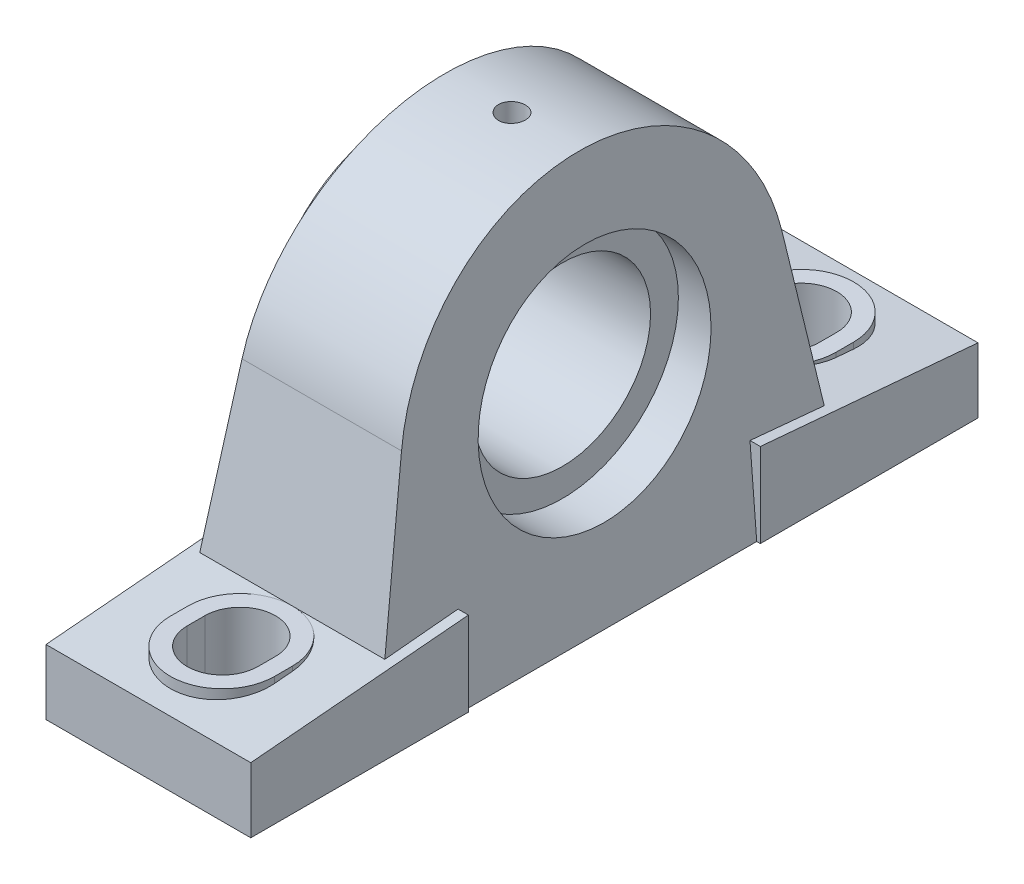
ISO-10303-21;
HEADER;
FILE_DESCRIPTION(('STEP AP214'),'2;1');
FILE_NAME('part.step','',(''),(''),'','','');
FILE_SCHEMA(('AUTOMOTIVE_DESIGN { 1 0 10303 214 1 1 1 1 }'));
ENDSEC;
DATA;
#1=APPLICATION_CONTEXT('core data for automotive mechanical design processes');
#2=APPLICATION_PROTOCOL_DEFINITION('international standard','automotive_design',2000,#1);
#3=PRODUCT_CONTEXT('',#1,'mechanical');
#4=PRODUCT('Part','Part','',(#3));
#5=PRODUCT_RELATED_PRODUCT_CATEGORY('part','',(#4));
#6=PRODUCT_DEFINITION_FORMATION('','',#4);
#7=PRODUCT_DEFINITION_CONTEXT('part definition',#1,'design');
#8=PRODUCT_DEFINITION('design','',#6,#7);
#9=PRODUCT_DEFINITION_SHAPE('','',#8);
#10=(LENGTH_UNIT() NAMED_UNIT(*) SI_UNIT(.MILLI.,.METRE.));
#11=(NAMED_UNIT(*) PLANE_ANGLE_UNIT() SI_UNIT($,.RADIAN.));
#12=(NAMED_UNIT(*) SI_UNIT($,.STERADIAN.) SOLID_ANGLE_UNIT());
#13=UNCERTAINTY_MEASURE_WITH_UNIT(LENGTH_MEASURE(1.E-05),#10,'distance_accuracy_value','');
#14=(GEOMETRIC_REPRESENTATION_CONTEXT(3) GLOBAL_UNCERTAINTY_ASSIGNED_CONTEXT((#13)) GLOBAL_UNIT_ASSIGNED_CONTEXT((#10,
#11,#12)) REPRESENTATION_CONTEXT('',''));
#15=CARTESIAN_POINT('',(0.,0.,0.));
#16=DIRECTION('',(0.,0.,1.));
#17=DIRECTION('',(1.,0.,0.));
#18=AXIS2_PLACEMENT_3D('',#15,#16,#17);
#19=CARTESIAN_POINT('',(-3.8,37.5,-3.876));
#20=CARTESIAN_POINT('',(-3.8,37.5,-3.8));
#21=CARTESIAN_POINT('',(-3.8,37.5,3.8));
#22=CARTESIAN_POINT('',(-3.8,37.5,3.87676));
#23=B_SPLINE_CURVE_WITH_KNOTS('',1,(#19,#20,#21,#22),.UNSPECIFIED.,.F.,.F.,(2,1,1,2),(-0.01,0.,
1.,1.0101),.UNSPECIFIED.);
#24=DIRECTION('',(1.,0.,0.));
#25=VECTOR('',#24,1.);
#26=SURFACE_OF_LINEAR_EXTRUSION('',#23,#25);
#27=CARTESIAN_POINT('',(0.,37.5,0.));
#28=DIRECTION('',(0.,-1.,0.));
#29=DIRECTION('',(0.,0.,-1.));
#30=AXIS2_PLACEMENT_3D('',#27,#28,#29);
#31=CIRCLE('',#30,3.8);
#32=CARTESIAN_POINT('',(0.,37.5,-3.80000000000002));
#33=VERTEX_POINT('',#32);
#34=EDGE_CURVE('E709',#33,#33,#31,.T.);
#35=ORIENTED_EDGE('',*,*,#34,.F.);
#36=EDGE_LOOP('',(#35));
#37=FACE_BOUND('',#36,.T.);
#38=ADVANCED_FACE('F16',(#37),#26,.T.);
#39=CARTESIAN_POINT('',(-32.6,0.,0.));
#40=DIRECTION('',(1.,0.,0.));
#41=DIRECTION('',(0.,0.,-1.));
#42=AXIS2_PLACEMENT_3D('',#39,#40,#41);
#43=CYLINDRICAL_SURFACE('',#42,25.);
#44=CARTESIAN_POINT('',(-32.6,0.,0.));
#45=DIRECTION('',(1.,0.,0.));
#46=DIRECTION('',(0.,0.,-1.));
#47=AXIS2_PLACEMENT_3D('',#44,#45,#46);
#48=CIRCLE('',#47,25.);
#49=CARTESIAN_POINT('',(-32.6,0.,-25.));
#50=VERTEX_POINT('',#49);
#51=EDGE_CURVE('E240',#50,#50,#48,.T.);
#52=ORIENTED_EDGE('',*,*,#51,.F.);
#53=EDGE_LOOP('',(#52));
#54=FACE_BOUND('',#53,.T.);
#55=CARTESIAN_POINT('',(-22.386,25.,0.));
#56=CARTESIAN_POINT('',(-22.3860049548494,24.9999989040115,0.115728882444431));
#57=CARTESIAN_POINT('',(-22.3957658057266,24.9991878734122,0.231533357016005));
#58=CARTESIAN_POINT('',(-22.434559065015,24.9960306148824,0.459934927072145));
#59=CARTESIAN_POINT('',(-22.4636124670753,24.9936827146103,0.57252838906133));
#60=CARTESIAN_POINT('',(-22.5401451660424,24.987717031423,0.791172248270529));
#61=CARTESIAN_POINT('',(-22.5876143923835,24.9840999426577,0.897226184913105));
#62=CARTESIAN_POINT('',(-22.6996132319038,24.9760015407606,1.09983659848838));
#63=CARTESIAN_POINT('',(-22.7641393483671,24.971520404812,1.19639501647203));
#64=CARTESIAN_POINT('',(-22.9085943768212,24.9621842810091,1.37753902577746));
#65=CARTESIAN_POINT('',(-22.9885571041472,24.9573284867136,1.46209761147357));
#66=CARTESIAN_POINT('',(-23.161544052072,24.947797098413,1.61660996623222));
#67=CARTESIAN_POINT('',(-23.2545688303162,24.9431215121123,1.68656311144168));
#68=CARTESIAN_POINT('',(-23.4512029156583,24.934471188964,1.80997037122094));
#69=CARTESIAN_POINT('',(-23.5548271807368,24.9304974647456,1.86340072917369));
#70=CARTESIAN_POINT('',(-23.7696143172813,24.9237099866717,1.95209391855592));
#71=CARTESIAN_POINT('',(-23.8807770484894,24.9208962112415,1.9873570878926));
#72=CARTESIAN_POINT('',(-24.1072149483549,24.9167539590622,2.03863663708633));
#73=CARTESIAN_POINT('',(-24.2224800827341,24.9154220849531,2.05469704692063));
#74=CARTESIAN_POINT('',(-24.4540773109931,24.9143836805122,2.06725120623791));
#75=CARTESIAN_POINT('',(-24.5704093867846,24.9146771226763,2.06374528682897));
#76=CARTESIAN_POINT('',(-24.8005358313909,24.9168531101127,2.03730271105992));
#77=CARTESIAN_POINT('',(-24.914335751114,24.9187317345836,2.01441399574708));
#78=CARTESIAN_POINT('',(-25.1364740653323,24.9238602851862,1.94992967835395));
#79=CARTESIAN_POINT('',(-25.2448123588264,24.9271102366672,1.90833373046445));
#80=CARTESIAN_POINT('',(-25.453107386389,24.9346198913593,1.8075603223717));
#81=CARTESIAN_POINT('',(-25.553053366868,24.938880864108,1.74836073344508));
#82=CARTESIAN_POINT('',(-25.7415999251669,24.947930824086,1.61408177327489));
#83=CARTESIAN_POINT('',(-25.8302012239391,24.9527197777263,1.53900341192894));
#84=CARTESIAN_POINT('',(-25.993815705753,24.9623029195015,1.37484440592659));
#85=CARTESIAN_POINT('',(-26.0687900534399,24.9670970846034,1.28572505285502));
#86=CARTESIAN_POINT('',(-26.202755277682,24.9761400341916,1.09609485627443));
#87=CARTESIAN_POINT('',(-26.2617386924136,24.9803885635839,0.995578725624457));
#88=CARTESIAN_POINT('',(-26.3620380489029,24.9878626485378,0.785957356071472));
#89=CARTESIAN_POINT('',(-26.4033375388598,24.9910872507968,0.676844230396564));
#90=CARTESIAN_POINT('',(-26.4669325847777,24.9961377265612,0.453350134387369));
#91=CARTESIAN_POINT('',(-26.4892685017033,24.9979665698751,0.338980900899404));
#92=CARTESIAN_POINT('',(-26.5058933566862,24.9993318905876,0.186551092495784));
#93=CARTESIAN_POINT('',(-26.5089311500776,24.9995819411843,0.149310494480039));
#94=CARTESIAN_POINT('',(-26.5129852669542,24.9999161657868,0.0747186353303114));
#95=CARTESIAN_POINT('',(-26.5140015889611,25.0000003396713,0.037367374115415));
#96=CARTESIAN_POINT('',(-26.5139950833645,24.9999989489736,-0.115623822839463));
#97=CARTESIAN_POINT('',(-26.5042443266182,24.9991887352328,-0.231401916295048));
#98=CARTESIAN_POINT('',(-26.4654707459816,24.9960330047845,-0.459831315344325));
#99=CARTESIAN_POINT('',(-26.4364071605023,24.9936842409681,-0.572475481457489));
#100=CARTESIAN_POINT('',(-26.3598495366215,24.9877166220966,-0.791184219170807));
#101=CARTESIAN_POINT('',(-26.3123724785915,24.9840989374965,-0.897254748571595));
#102=CARTESIAN_POINT('',(-26.2003688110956,24.9760002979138,-1.09986426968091));
#103=CARTESIAN_POINT('',(-26.135850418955,24.9715197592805,-1.19640782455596));
#104=CARTESIAN_POINT('',(-25.9914156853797,24.9621849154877,-1.37752643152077));
#105=CARTESIAN_POINT('',(-25.911465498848,24.9573298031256,-1.46207445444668));
#106=CARTESIAN_POINT('',(-25.7384804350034,24.9477983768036,-1.61659106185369));
#107=CARTESIAN_POINT('',(-25.6454414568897,24.9431221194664,-1.68655505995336));
#108=CARTESIAN_POINT('',(-25.448746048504,24.9344687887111,-1.81000399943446));
#109=CARTESIAN_POINT('',(-25.3450703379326,24.93049302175,-1.8634582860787));
#110=CARTESIAN_POINT('',(-25.1302512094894,24.9237069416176,-1.95213420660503));
#111=CARTESIAN_POINT('',(-25.0191162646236,24.9208953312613,-1.98737614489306));
#112=CARTESIAN_POINT('',(-24.8311422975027,24.9174549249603,-2.02995355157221));
#113=CARTESIAN_POINT('',(-24.7554929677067,24.9164089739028,-2.04270354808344));
#114=CARTESIAN_POINT('',(-24.6032402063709,24.9150073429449,-2.05972839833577));
#115=CARTESIAN_POINT('',(-24.5266367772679,24.9146516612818,-2.06400327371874));
#116=CARTESIAN_POINT('',(-24.3342721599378,24.9146535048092,-2.06399505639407));
#117=CARTESIAN_POINT('',(-24.2184685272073,24.9154673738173,-2.05423435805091));
#118=CARTESIAN_POINT('',(-23.9900685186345,24.918634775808,-2.01544167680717));
#119=CARTESIAN_POINT('',(-23.8774757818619,24.9209899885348,-1.98638866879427));
#120=CARTESIAN_POINT('',(-23.6588316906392,24.9269715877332,-1.90985653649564));
#121=CARTESIAN_POINT('',(-23.5527768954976,24.9305972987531,-1.86238720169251));
#122=CARTESIAN_POINT('',(-23.3501682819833,24.938710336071,-1.75038957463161));
#123=CARTESIAN_POINT('',(-23.2536122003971,24.9431974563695,-1.68586535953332));
#124=CARTESIAN_POINT('',(-23.0724791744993,24.9525400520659,-1.54142118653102));
#125=CARTESIAN_POINT('',(-22.9879282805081,24.9573962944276,-1.46146861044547));
#126=CARTESIAN_POINT('',(-22.8334103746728,24.9669241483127,-1.28848199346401));
#127=CARTESIAN_POINT('',(-22.7634472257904,24.9715957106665,-1.19544449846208));
#128=CARTESIAN_POINT('',(-22.6399989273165,24.9802361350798,-0.998751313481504));
#129=CARTESIAN_POINT('',(-22.5865445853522,24.9842036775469,-0.895076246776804));
#130=CARTESIAN_POINT('',(-22.4978680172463,24.9909733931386,-0.680257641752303));
#131=CARTESIAN_POINT('',(-22.4626256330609,24.9937768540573,-0.569122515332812));
#132=CARTESIAN_POINT('',(-22.4200473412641,24.9972067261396,-0.381147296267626));
#133=CARTESIAN_POINT('',(-22.4072969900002,24.9982492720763,-0.305496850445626));
#134=CARTESIAN_POINT('',(-22.3902716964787,24.9996462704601,-0.153241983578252));
#135=CARTESIAN_POINT('',(-22.3859967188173,25.0000007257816,-0.0766375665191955));
#136=CARTESIAN_POINT('',(-22.386,25.,0.));
#137=B_SPLINE_CURVE_WITH_KNOTS('',3,(#55,#56,#57,#58,#59,#60,#61,#62,#63,#64,#65,#66,#67,#68,
#69,#70,#71,#72,#73,#74,#75,#76,#77,#78,#79,#80,#81,#82,#83,#84,#85,#86,#87,#88,#89,#90,#91,#92,
#93,#94,#95,#96,#97,#98,#99,#100,#101,#102,#103,#104,#105,#106,#107,#108,#109,#110,#111,#112,
#113,#114,#115,#116,#117,#118,#119,#120,#121,#122,#123,#124,#125,#126,#127,#128,#129,#130,#131,
#132,#133,#134,#135,#136),.UNSPECIFIED.,.T.,.F.,(4,2,2,2,2,2,2,2,2,2,2,2,2,2,2,2,2,2,2,2,2,2,2,
2,2,2,2,2,2,2,2,2,2,2,2,2,2,2,2,2,4),(0.,0.34690723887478,0.694192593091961,1.04128830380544,
1.38831291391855,1.73610652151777,2.08391498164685,2.43222122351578,2.78052098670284,
3.12802059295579,3.47551431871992,3.82215106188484,4.16879421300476,4.51587496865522,
4.86293365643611,5.21096642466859,5.55916131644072,5.90767944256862,6.25545393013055,
6.36751000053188,6.47956615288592,6.8262953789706,7.17375874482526,7.5209024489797,
7.86787906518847,8.21562550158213,8.56348113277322,8.9119788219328,9.26008713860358,
9.48981243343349,9.71953714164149,10.066441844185,10.4137252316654,10.7608242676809,
11.1078404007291,11.4555983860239,11.8034483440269,12.1519435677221,12.5000522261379,
12.7297808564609,12.9595085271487),.UNSPECIFIED.);
#138=CARTESIAN_POINT('',(-22.386,25.,0.));
#139=VERTEX_POINT('',#138);
#140=EDGE_CURVE('E236',#139,#139,#137,.T.);
#141=ORIENTED_EDGE('',*,*,#140,.F.);
#142=EDGE_LOOP('',(#141));
#143=FACE_BOUND('',#142,.T.);
#144=CARTESIAN_POINT('',(-24.884,0.,25.));
#145=CARTESIAN_POINT('',(-24.8839950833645,0.115623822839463,24.9999989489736));
#146=CARTESIAN_POINT('',(-24.8742443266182,0.231401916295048,24.9991887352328));
#147=CARTESIAN_POINT('',(-24.8354707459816,0.459831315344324,24.9960330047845));
#148=CARTESIAN_POINT('',(-24.8064071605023,0.572475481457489,24.9936842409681));
#149=CARTESIAN_POINT('',(-24.7298495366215,0.791184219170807,24.9877166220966));
#150=CARTESIAN_POINT('',(-24.6823724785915,0.897254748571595,24.9840989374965));
#151=CARTESIAN_POINT('',(-24.5703688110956,1.09986426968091,24.9760002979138));
#152=CARTESIAN_POINT('',(-24.505850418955,1.19640782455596,24.9715197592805));
#153=CARTESIAN_POINT('',(-24.3614156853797,1.37752643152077,24.9621849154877));
#154=CARTESIAN_POINT('',(-24.281465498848,1.46207445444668,24.9573298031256));
#155=CARTESIAN_POINT('',(-24.1084804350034,1.61659106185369,24.9477983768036));
#156=CARTESIAN_POINT('',(-24.0154414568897,1.68655505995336,24.9431221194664));
#157=CARTESIAN_POINT('',(-23.818746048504,1.81000399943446,24.9344687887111));
#158=CARTESIAN_POINT('',(-23.7150703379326,1.8634582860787,24.93049302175));
#159=CARTESIAN_POINT('',(-23.5002512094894,1.95213420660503,24.9237069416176));
#160=CARTESIAN_POINT('',(-23.3891162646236,1.98737614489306,24.9208953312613));
#161=CARTESIAN_POINT('',(-23.2011422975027,2.02995355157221,24.9174549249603));
#162=CARTESIAN_POINT('',(-23.1254929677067,2.04270354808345,24.9164089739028));
#163=CARTESIAN_POINT('',(-22.9732402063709,2.05972839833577,24.9150073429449));
#164=CARTESIAN_POINT('',(-22.8966367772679,2.06400327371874,24.9146516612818));
#165=CARTESIAN_POINT('',(-22.7042721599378,2.06399505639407,24.9146535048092));
#166=CARTESIAN_POINT('',(-22.5884685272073,2.05423435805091,24.9154673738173));
#167=CARTESIAN_POINT('',(-22.3600685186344,2.01544167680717,24.918634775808));
#168=CARTESIAN_POINT('',(-22.2474757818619,1.98638866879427,24.9209899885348));
#169=CARTESIAN_POINT('',(-22.0288316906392,1.90985653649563,24.9269715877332));
#170=CARTESIAN_POINT('',(-21.9227768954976,1.86238720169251,24.9305972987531));
#171=CARTESIAN_POINT('',(-21.7201682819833,1.7503895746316,24.938710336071));
#172=CARTESIAN_POINT('',(-21.6236122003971,1.68586535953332,24.9431974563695));
#173=CARTESIAN_POINT('',(-21.4424791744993,1.54142118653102,24.9525400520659));
#174=CARTESIAN_POINT('',(-21.3579282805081,1.46146861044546,24.9573962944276));
#175=CARTESIAN_POINT('',(-21.2034103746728,1.288481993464,24.9669241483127));
#176=CARTESIAN_POINT('',(-21.1334472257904,1.19544449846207,24.9715957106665));
#177=CARTESIAN_POINT('',(-21.0099989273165,0.9987513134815,24.9802361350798));
#178=CARTESIAN_POINT('',(-20.9565445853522,0.8950762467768,24.9842036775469));
#179=CARTESIAN_POINT('',(-20.8678680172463,0.680257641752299,24.9909733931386));
#180=CARTESIAN_POINT('',(-20.8326256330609,0.569122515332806,24.9937768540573));
#181=CARTESIAN_POINT('',(-20.7900473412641,0.38114729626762,24.9972067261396));
#182=CARTESIAN_POINT('',(-20.7772969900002,0.305496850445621,24.9982492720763));
#183=CARTESIAN_POINT('',(-20.7602716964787,0.153241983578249,24.9996462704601));
#184=CARTESIAN_POINT('',(-20.7559967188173,0.0766375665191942,25.0000007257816));
#185=CARTESIAN_POINT('',(-20.7560049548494,-0.115728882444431,24.9999989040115));
#186=CARTESIAN_POINT('',(-20.7657658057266,-0.231533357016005,24.9991878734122));
#187=CARTESIAN_POINT('',(-20.804559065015,-0.459934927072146,24.9960306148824));
#188=CARTESIAN_POINT('',(-20.8336124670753,-0.57252838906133,24.9936827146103));
#189=CARTESIAN_POINT('',(-20.9101451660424,-0.791172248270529,24.987717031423));
#190=CARTESIAN_POINT('',(-20.9576143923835,-0.897226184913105,24.9840999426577));
#191=CARTESIAN_POINT('',(-21.0696132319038,-1.09983659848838,24.9760015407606));
#192=CARTESIAN_POINT('',(-21.1341393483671,-1.19639501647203,24.971520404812));
#193=CARTESIAN_POINT('',(-21.2785943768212,-1.37753902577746,24.9621842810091));
#194=CARTESIAN_POINT('',(-21.3585571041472,-1.46209761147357,24.9573284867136));
#195=CARTESIAN_POINT('',(-21.531544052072,-1.61660996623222,24.947797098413));
#196=CARTESIAN_POINT('',(-21.6245688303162,-1.68656311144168,24.9431215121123));
#197=CARTESIAN_POINT('',(-21.8212029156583,-1.80997037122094,24.934471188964));
#198=CARTESIAN_POINT('',(-21.9248271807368,-1.86340072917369,24.9304974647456));
#199=CARTESIAN_POINT('',(-22.1396143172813,-1.95209391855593,24.9237099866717));
#200=CARTESIAN_POINT('',(-22.2507770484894,-1.9873570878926,24.9208962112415));
#201=CARTESIAN_POINT('',(-22.4772149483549,-2.03863663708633,24.9167539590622));
#202=CARTESIAN_POINT('',(-22.5924800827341,-2.05469704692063,24.9154220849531));
#203=CARTESIAN_POINT('',(-22.8240773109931,-2.06725120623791,24.9143836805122));
#204=CARTESIAN_POINT('',(-22.9404093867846,-2.06374528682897,24.9146771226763));
#205=CARTESIAN_POINT('',(-23.1705358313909,-2.03730271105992,24.9168531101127));
#206=CARTESIAN_POINT('',(-23.284335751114,-2.01441399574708,24.9187317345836));
#207=CARTESIAN_POINT('',(-23.5064740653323,-1.94992967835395,24.9238602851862));
#208=CARTESIAN_POINT('',(-23.6148123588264,-1.90833373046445,24.9271102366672));
#209=CARTESIAN_POINT('',(-23.823107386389,-1.8075603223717,24.9346198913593));
#210=CARTESIAN_POINT('',(-23.923053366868,-1.74836073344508,24.938880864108));
#211=CARTESIAN_POINT('',(-24.1115999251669,-1.61408177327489,24.947930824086));
#212=CARTESIAN_POINT('',(-24.2002012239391,-1.53900341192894,24.9527197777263));
#213=CARTESIAN_POINT('',(-24.363815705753,-1.37484440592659,24.9623029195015));
#214=CARTESIAN_POINT('',(-24.4387900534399,-1.28572505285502,24.9670970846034));
#215=CARTESIAN_POINT('',(-24.572755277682,-1.09609485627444,24.9761400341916));
#216=CARTESIAN_POINT('',(-24.6317386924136,-0.995578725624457,24.9803885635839));
#217=CARTESIAN_POINT('',(-24.7320380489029,-0.785957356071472,24.9878626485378));
#218=CARTESIAN_POINT('',(-24.7733375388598,-0.676844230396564,24.9910872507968));
#219=CARTESIAN_POINT('',(-24.8369325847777,-0.453350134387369,24.9961377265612));
#220=CARTESIAN_POINT('',(-24.8592685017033,-0.338980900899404,24.9979665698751));
#221=CARTESIAN_POINT('',(-24.8758933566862,-0.186551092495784,24.9993318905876));
#222=CARTESIAN_POINT('',(-24.8789311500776,-0.149310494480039,24.9995819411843));
#223=CARTESIAN_POINT('',(-24.8829852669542,-0.0747186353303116,24.9999161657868));
#224=CARTESIAN_POINT('',(-24.8840015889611,-0.0373673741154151,25.0000003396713));
#225=CARTESIAN_POINT('',(-24.884,0.,25.));
#226=B_SPLINE_CURVE_WITH_KNOTS('',3,(#144,#145,#146,#147,#148,#149,#150,#151,#152,#153,#154,
#155,#156,#157,#158,#159,#160,#161,#162,#163,#164,#165,#166,#167,#168,#169,#170,#171,#172,#173,
#174,#175,#176,#177,#178,#179,#180,#181,#182,#183,#184,#185,#186,#187,#188,#189,#190,#191,#192,
#193,#194,#195,#196,#197,#198,#199,#200,#201,#202,#203,#204,#205,#206,#207,#208,#209,#210,#211,
#212,#213,#214,#215,#216,#217,#218,#219,#220,#221,#222,#223,#224,#225),.UNSPECIFIED.,.T.,.F.,(4,
2,2,2,2,2,2,2,2,2,2,2,2,2,2,2,2,2,2,2,2,2,2,2,2,2,2,2,2,2,2,2,2,2,2,2,2,2,2,2,4),(0.,
0.346729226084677,0.694192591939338,1.04133629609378,1.38831291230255,1.73605934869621,
2.08391497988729,2.43241266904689,2.78052098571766,3.01024628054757,3.23997098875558,
3.58687569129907,3.93415907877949,4.28125811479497,4.62827424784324,4.97603223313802,
5.32388219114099,5.67237741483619,6.02048607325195,6.25021470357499,6.47994237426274,
6.82684961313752,7.1741349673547,7.52123067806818,7.86825528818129,8.21604889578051,
8.56385735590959,8.91216359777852,9.26046336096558,9.60796296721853,9.95545669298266,
10.3020934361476,10.6487365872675,10.995817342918,11.3428760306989,11.6909087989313,
12.0391036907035,12.3876218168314,12.7353963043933,12.8474523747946,12.9595085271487),.UNSPECIFIED.);
#227=CARTESIAN_POINT('',(-24.884,0.,25.));
#228=VERTEX_POINT('',#227);
#229=EDGE_CURVE('E232',#228,#228,#226,.T.);
#230=ORIENTED_EDGE('',*,*,#229,.F.);
#231=EDGE_LOOP('',(#230));
#232=FACE_BOUND('',#231,.T.);
#233=CARTESIAN_POINT('',(14.25,0.,0.));
#234=DIRECTION('',(1.,0.,0.));
#235=DIRECTION('',(0.,0.,-1.));
#236=AXIS2_PLACEMENT_3D('',#233,#234,#235);
#237=CIRCLE('',#236,25.);
#238=CARTESIAN_POINT('',(14.25,0.,-25.));
#239=VERTEX_POINT('',#238);
#240=EDGE_CURVE('E20',#239,#239,#237,.F.);
#241=ORIENTED_EDGE('',*,*,#240,.F.);
#242=EDGE_LOOP('',(#241));
#243=FACE_BOUND('',#242,.T.);
#244=ADVANCED_FACE('F225',(#54,#143,#232,#243),#43,.F.);
#245=CARTESIAN_POINT('',(14.25,32.88,33.2745610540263));
#246=DIRECTION('',(1.,0.,0.));
#247=DIRECTION('',(0.,-1.,0.));
#248=AXIS2_PLACEMENT_3D('',#245,#246,#247);
#249=PLANE('',#248);
#250=ORIENTED_EDGE('',*,*,#240,.T.);
#251=EDGE_LOOP('',(#250));
#252=FACE_BOUND('',#251,.T.);
#253=CARTESIAN_POINT('',(14.25,0.,0.));
#254=DIRECTION('',(1.,0.,0.));
#255=DIRECTION('',(0.,0.,-1.));
#256=AXIS2_PLACEMENT_3D('',#253,#254,#255);
#257=CIRCLE('',#256,32.88);
#258=CARTESIAN_POINT('',(14.25,0.,-32.88));
#259=VERTEX_POINT('',#258);
#260=EDGE_CURVE('E208',#259,#259,#257,.F.);
#261=ORIENTED_EDGE('',*,*,#260,.F.);
#262=EDGE_LOOP('',(#261));
#263=FACE_BOUND('',#262,.T.);
#264=ADVANCED_FACE('F220',(#252,#263),#249,.T.);
#265=CARTESIAN_POINT('',(0.,54.8001620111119,0.));
#266=DIRECTION('',(0.,-1.,0.));
#267=DIRECTION('',(0.,0.,-1.));
#268=AXIS2_PLACEMENT_3D('',#265,#266,#267);
#269=CYLINDRICAL_SURFACE('',#268,3.8);
#270=ORIENTED_EDGE('',*,*,#34,.T.);
#271=EDGE_LOOP('',(#270));
#272=FACE_BOUND('',#271,.T.);
#273=CARTESIAN_POINT('',(3.8,54.8,0.));
#274=CARTESIAN_POINT('',(3.79999101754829,54.7999983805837,0.212990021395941));
#275=CARTESIAN_POINT('',(3.78201948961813,54.7987441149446,0.426265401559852));
#276=CARTESIAN_POINT('',(3.71055269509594,54.7938589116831,0.847061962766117));
#277=CARTESIAN_POINT('',(3.65698205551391,54.7902229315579,1.05456995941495));
#278=CARTESIAN_POINT('',(3.51585925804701,54.7809852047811,1.45747056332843));
#279=CARTESIAN_POINT('',(3.42833793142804,54.7753852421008,1.65287397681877));
#280=CARTESIAN_POINT('',(3.22185251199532,54.7628502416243,2.02611597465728));
#281=CARTESIAN_POINT('',(3.1029027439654,54.7559158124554,2.20396251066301));
#282=CARTESIAN_POINT('',(2.83667997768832,54.7414752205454,2.53748844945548));
#283=CARTESIAN_POINT('',(2.68935941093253,54.7339681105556,2.69312984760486));
#284=CARTESIAN_POINT('',(2.37066988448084,54.7192360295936,2.97750534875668));
#285=CARTESIAN_POINT('',(2.19929875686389,54.7120110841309,3.10623702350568));
#286=CARTESIAN_POINT('',(1.83717266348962,54.6986515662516,3.33324265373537));
#287=CARTESIAN_POINT('',(1.64639888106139,54.6925180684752,3.43148666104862));
#288=CARTESIAN_POINT('',(1.25101610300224,54.6820448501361,3.59453542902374));
#289=CARTESIAN_POINT('',(1.04640740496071,54.6777050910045,3.65934090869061));
#290=CARTESIAN_POINT('',(0.629512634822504,54.6713173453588,3.75357296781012));
#291=CARTESIAN_POINT('',(0.417239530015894,54.6692656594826,3.7830566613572));
#292=CARTESIAN_POINT('',(-0.0092522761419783,54.6676743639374,3.80598454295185));
#293=CARTESIAN_POINT('',(-0.223470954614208,54.6681347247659,3.79942915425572));
#294=CARTESIAN_POINT('',(-0.64738079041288,54.6715121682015,3.75051239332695));
#295=CARTESIAN_POINT('',(-0.857079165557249,54.6744249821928,3.70821323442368));
#296=CARTESIAN_POINT('',(-1.26639419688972,54.6823724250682,3.58910551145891));
#297=CARTESIAN_POINT('',(-1.46601068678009,54.6874070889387,3.51229637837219));
#298=CARTESIAN_POINT('',(-1.84969937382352,54.6990360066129,3.32627560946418));
#299=CARTESIAN_POINT('',(-2.03375734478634,54.7056316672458,3.21703472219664));
#300=CARTESIAN_POINT('',(-2.38093174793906,54.7196372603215,2.96928245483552));
#301=CARTESIAN_POINT('',(-2.54404965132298,54.7270471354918,2.83077313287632));
#302=CARTESIAN_POINT('',(-2.84506373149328,54.7418641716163,2.52809401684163));
#303=CARTESIAN_POINT('',(-2.98291087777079,54.7492713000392,2.36387546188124));
#304=CARTESIAN_POINT('',(-3.229153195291,54.7632382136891,2.01451007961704));
#305=CARTESIAN_POINT('',(-3.33753455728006,54.7697976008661,1.82935349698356));
#306=CARTESIAN_POINT('',(-3.52175126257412,54.7813311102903,1.44329040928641));
#307=CARTESIAN_POINT('',(-3.59755744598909,54.7863038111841,1.24236998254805));
#308=CARTESIAN_POINT('',(-3.714186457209,54.7940849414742,0.830888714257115));
#309=CARTESIAN_POINT('',(-3.75508361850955,54.7968979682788,0.62034936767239));
#310=CARTESIAN_POINT('',(-3.78534259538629,54.7989853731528,0.340369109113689));
#311=CARTESIAN_POINT('',(-3.79083519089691,54.7993651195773,0.272419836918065));
#312=CARTESIAN_POINT('',(-3.79816533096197,54.7998726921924,0.136323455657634));
#313=CARTESIAN_POINT('',(-3.8000028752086,54.8000005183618,0.0681763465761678));
#314=CARTESIAN_POINT('',(-3.79999101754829,54.7999983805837,-0.212990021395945));
#315=CARTESIAN_POINT('',(-3.78201948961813,54.7987441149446,-0.426265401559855));
#316=CARTESIAN_POINT('',(-3.71055269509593,54.7938589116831,-0.84706196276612));
#317=CARTESIAN_POINT('',(-3.65698205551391,54.7902229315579,-1.05456995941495));
#318=CARTESIAN_POINT('',(-3.51585925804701,54.7809852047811,-1.45747056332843));
#319=CARTESIAN_POINT('',(-3.42833793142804,54.7753852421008,-1.65287397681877));
#320=CARTESIAN_POINT('',(-3.22185251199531,54.7628502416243,-2.02611597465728));
#321=CARTESIAN_POINT('',(-3.1029027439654,54.7559158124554,-2.20396251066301));
#322=CARTESIAN_POINT('',(-2.83667997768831,54.7414752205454,-2.53748844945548));
#323=CARTESIAN_POINT('',(-2.68935941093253,54.7339681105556,-2.69312984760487));
#324=CARTESIAN_POINT('',(-2.37066988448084,54.7192360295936,-2.97750534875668));
#325=CARTESIAN_POINT('',(-2.19929875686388,54.7120110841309,-3.10623702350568));
#326=CARTESIAN_POINT('',(-1.83717266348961,54.6986515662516,-3.33324265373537));
#327=CARTESIAN_POINT('',(-1.64639888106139,54.6925180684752,-3.43148666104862));
#328=CARTESIAN_POINT('',(-1.25101610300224,54.6820448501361,-3.59453542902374));
#329=CARTESIAN_POINT('',(-1.04640740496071,54.6777050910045,-3.65934090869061));
#330=CARTESIAN_POINT('',(-0.629512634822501,54.6713173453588,-3.75357296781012));
#331=CARTESIAN_POINT('',(-0.417239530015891,54.6692656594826,-3.7830566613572));
#332=CARTESIAN_POINT('',(0.00925227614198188,54.6676743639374,-3.80598454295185));
#333=CARTESIAN_POINT('',(0.223470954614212,54.6681347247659,-3.79942915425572));
#334=CARTESIAN_POINT('',(0.647380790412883,54.6715121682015,-3.75051239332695));
#335=CARTESIAN_POINT('',(0.857079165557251,54.6744249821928,-3.70821323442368));
#336=CARTESIAN_POINT('',(1.26639419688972,54.6823724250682,-3.58910551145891));
#337=CARTESIAN_POINT('',(1.46601068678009,54.6874070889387,-3.51229637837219));
#338=CARTESIAN_POINT('',(1.84969937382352,54.6990360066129,-3.32627560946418));
#339=CARTESIAN_POINT('',(2.03375734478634,54.7056316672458,-3.21703472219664));
#340=CARTESIAN_POINT('',(2.38093174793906,54.7196372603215,-2.96928245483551));
#341=CARTESIAN_POINT('',(2.54404965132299,54.7270471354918,-2.83077313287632));
#342=CARTESIAN_POINT('',(2.84506373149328,54.7418641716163,-2.52809401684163));
#343=CARTESIAN_POINT('',(2.98291087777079,54.7492713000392,-2.36387546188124));
#344=CARTESIAN_POINT('',(3.229153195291,54.7632382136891,-2.01451007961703));
#345=CARTESIAN_POINT('',(3.33753455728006,54.7697976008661,-1.82935349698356));
#346=CARTESIAN_POINT('',(3.52175126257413,54.7813311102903,-1.44329040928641));
#347=CARTESIAN_POINT('',(3.59755744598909,54.7863038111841,-1.24236998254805));
#348=CARTESIAN_POINT('',(3.714186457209,54.7940849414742,-0.830888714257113));
#349=CARTESIAN_POINT('',(3.75508361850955,54.7968979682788,-0.620349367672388));
#350=CARTESIAN_POINT('',(3.78534259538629,54.7989853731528,-0.340369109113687));
#351=CARTESIAN_POINT('',(3.79083519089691,54.7993651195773,-0.272419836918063));
#352=CARTESIAN_POINT('',(3.79816533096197,54.7998726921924,-0.136323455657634));
#353=CARTESIAN_POINT('',(3.8000028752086,54.8000005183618,-0.06817634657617));
#354=CARTESIAN_POINT('',(3.8,54.8,0.));
#355=B_SPLINE_CURVE_WITH_KNOTS('',3,(#273,#274,#275,#276,#277,#278,#279,#280,#281,#282,#283,
#284,#285,#286,#287,#288,#289,#290,#291,#292,#293,#294,#295,#296,#297,#298,#299,#300,#301,#302,
#303,#304,#305,#306,#307,#308,#309,#310,#311,#312,#313,#314,#315,#316,#317,#318,#319,#320,#321,
#322,#323,#324,#325,#326,#327,#328,#329,#330,#331,#332,#333,#334,#335,#336,#337,#338,#339,#340,
#341,#342,#343,#344,#345,#346,#347,#348,#349,#350,#351,#352,#353,#354),.UNSPECIFIED.,.T.,.F.,(4,
2,2,2,2,2,2,2,2,2,2,2,2,2,2,2,2,2,2,2,2,2,2,2,2,2,2,2,2,2,2,2,2,2,2,2,2,2,2,2,4),(0.,
0.638710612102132,1.27877787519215,1.91826523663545,2.55746162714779,3.19773922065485,
3.83807456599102,4.47903693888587,5.11998552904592,5.75989632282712,6.39979960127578,
7.03859139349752,7.67739371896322,8.31677396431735,8.95610926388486,9.596672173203,
10.237534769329,10.8789698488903,11.5190356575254,11.7234816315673,11.9279276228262,
12.5666382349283,13.2067054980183,13.8461928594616,14.485389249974,15.125666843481,
15.7660021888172,16.4069645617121,17.0479131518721,17.6878239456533,18.327727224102,
18.9665190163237,19.6053213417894,20.2447015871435,20.884036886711,21.5245997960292,
22.1654623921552,22.8068974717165,23.4469632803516,23.6514092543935,23.8558552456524),.UNSPECIFIED.);
#356=CARTESIAN_POINT('',(3.8,54.8,0.));
#357=VERTEX_POINT('',#356);
#358=EDGE_CURVE('E200',#357,#357,#355,.T.);
#359=ORIENTED_EDGE('',*,*,#358,.F.);
#360=EDGE_LOOP('',(#359));
#361=FACE_BOUND('',#360,.T.);
#362=ADVANCED_FACE('F214',(#272,#361),#269,.F.);
#363=CARTESIAN_POINT('',(-22.82,0.,37.5));
#364=DIRECTION('',(0.,0.,-1.));
#365=DIRECTION('',(-1.,0.,0.));
#366=AXIS2_PLACEMENT_3D('',#363,#364,#365);
#367=CYLINDRICAL_SURFACE('',#366,2.064);
#368=CARTESIAN_POINT('',(-22.82,0.,37.5));
#369=DIRECTION('',(0.,0.,-1.));
#370=DIRECTION('',(-1.,0.,0.));
#371=AXIS2_PLACEMENT_3D('',#368,#369,#370);
#372=CIRCLE('',#371,2.064);
#373=CARTESIAN_POINT('',(-23.2278412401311,2.02330460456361,37.5));
#374=VERTEX_POINT('',#373);
#375=CARTESIAN_POINT('',(-23.5447393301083,-1.93257571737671,37.5));
#376=VERTEX_POINT('',#375);
#377=EDGE_CURVE('E587',#374,#376,#372,.T.);
#378=ORIENTED_EDGE('',*,*,#377,.F.);
#379=DIRECTION('',(0.,0.,-1.));
#380=VECTOR('',#379,1.);
#381=CARTESIAN_POINT('',(-23.2278412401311,2.02330460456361,31.207326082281));
#382=LINE('',#381,#380);
#383=CARTESIAN_POINT('',(-23.2278412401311,2.02330460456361,37.4453767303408));
#384=VERTEX_POINT('',#383);
#385=EDGE_CURVE('E705',#374,#384,#382,.T.);
#386=ORIENTED_EDGE('',*,*,#385,.T.);
#387=CARTESIAN_POINT('',(-23.5447393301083,-1.93257571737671,37.4501689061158));
#388=CARTESIAN_POINT('',(-23.5991297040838,-1.91217823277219,37.4512209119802));
#389=CARTESIAN_POINT('',(-23.652630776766,-1.8894944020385,37.4523753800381));
#390=CARTESIAN_POINT('',(-23.7575265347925,-1.83970485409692,37.4548543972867));
#391=CARTESIAN_POINT('',(-23.8089213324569,-1.81259937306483,37.4561789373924));
#392=CARTESIAN_POINT('',(-23.9592820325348,-1.72497861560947,37.460350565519));
#393=CARTESIAN_POINT('',(-24.0546230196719,-1.65808424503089,37.4633997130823));
#394=CARTESIAN_POINT('',(-24.232705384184,-1.5092547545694,37.4696901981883));
#395=CARTESIAN_POINT('',(-24.3154421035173,-1.42731409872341,37.472931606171));
#396=CARTESIAN_POINT('',(-24.4660144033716,-1.25067675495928,37.4792422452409));
#397=CARTESIAN_POINT('',(-24.533847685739,-1.15597810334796,37.4823114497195));
#398=CARTESIAN_POINT('',(-24.6527000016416,-0.956457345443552,37.4879334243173));
#399=CARTESIAN_POINT('',(-24.7037053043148,-0.851627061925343,37.4904857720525));
#400=CARTESIAN_POINT('',(-24.7873300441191,-0.634949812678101,37.4947800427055));
#401=CARTESIAN_POINT('',(-24.8199713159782,-0.52311135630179,37.4965229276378));
#402=CARTESIAN_POINT('',(-24.856619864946,-0.342067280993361,37.4985007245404));
#403=CARTESIAN_POINT('',(-24.8668755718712,-0.274068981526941,37.4990607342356));
#404=CARTESIAN_POINT('',(-24.8805670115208,-0.137391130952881,37.4998105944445));
#405=CARTESIAN_POINT('',(-24.8840031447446,-0.0687116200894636,37.5000004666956));
#406=CARTESIAN_POINT('',(-24.8839946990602,0.115823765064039,37.4999992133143));
#407=CARTESIAN_POINT('',(-24.8742169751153,0.231738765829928,37.4994575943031));
#408=CARTESIAN_POINT('',(-24.8353458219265,0.460390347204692,37.4973487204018));
#409=CARTESIAN_POINT('',(-24.806225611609,0.573122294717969,37.4957800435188));
#410=CARTESIAN_POINT('',(-24.7295042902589,0.792041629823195,37.4917944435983));
#411=CARTESIAN_POINT('',(-24.6819126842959,0.89823235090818,37.4893779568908));
#412=CARTESIAN_POINT('',(-24.5696221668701,1.10106753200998,37.4839693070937));
#413=CARTESIAN_POINT('',(-24.5049309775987,1.19771627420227,37.4809774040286));
#414=CARTESIAN_POINT('',(-24.3602087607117,1.37888181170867,37.4747504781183));
#415=CARTESIAN_POINT('',(-24.280162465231,1.46338638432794,37.4715152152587));
#416=CARTESIAN_POINT('',(-24.1069370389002,1.61781927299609,37.4651658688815));
#417=CARTESIAN_POINT('',(-24.0137532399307,1.68774238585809,37.4620518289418));
#418=CARTESIAN_POINT('',(-23.8629282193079,1.78220447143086,37.4576404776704));
#419=CARTESIAN_POINT('',(-23.8089392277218,1.81271607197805,37.4561723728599));
#420=CARTESIAN_POINT('',(-23.6984143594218,1.86877473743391,37.4534173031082));
#421=CARTESIAN_POINT('',(-23.6418782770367,1.89432140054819,37.4521303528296));
#422=CARTESIAN_POINT('',(-23.5266544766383,1.94025440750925,37.4497790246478));
#423=CARTESIAN_POINT('',(-23.4679638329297,1.96063341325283,37.4487149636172));
#424=CARTESIAN_POINT('',(-23.3489828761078,1.99602937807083,37.446844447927));
#425=CARTESIAN_POINT('',(-23.2886925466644,2.01104628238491,37.4460379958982));
#426=CARTESIAN_POINT('',(-23.2278412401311,2.02330460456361,37.4453767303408));
#427=B_SPLINE_CURVE_WITH_KNOTS('',3,(#387,#388,#389,#390,#391,#392,#393,#394,#395,#396,#397,
#398,#399,#400,#401,#402,#403,#404,#405,#406,#407,#408,#409,#410,#411,#412,#413,#414,#415,#416,
#417,#418,#419,#420,#421,#422,#423,#424,#425,#426),.UNSPECIFIED.,.F.,.F.,(4,2,2,2,2,2,2,2,2,2,2,
2,2,2,2,2,2,2,2,4),(0.,0.17418915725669,0.348369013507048,0.696099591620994,1.0439583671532,
1.39187074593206,1.74006630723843,2.0878469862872,2.29384451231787,2.49982994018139,
2.84704934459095,3.1947505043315,3.54227297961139,3.88963878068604,4.23735178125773,
4.58518864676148,4.77107160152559,4.95696959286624,5.14313010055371,5.32929250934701),.UNSPECIFIED.);
#428=CARTESIAN_POINT('',(-23.5447393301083,-1.93257571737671,37.4501689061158));
#429=VERTEX_POINT('',#428);
#430=EDGE_CURVE('E258',#429,#384,#427,.T.);
#431=ORIENTED_EDGE('',*,*,#430,.F.);
#432=DIRECTION('',(0.,0.,1.));
#433=VECTOR('',#432,1.);
#434=CARTESIAN_POINT('',(-23.5447393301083,-1.93257571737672,31.207326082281));
#435=LINE('',#434,#433);
#436=EDGE_CURVE('E707',#429,#376,#435,.T.);
#437=ORIENTED_EDGE('',*,*,#436,.T.);
#438=EDGE_LOOP('',(#378,#386,#431,#437));
#439=FACE_BOUND('',#438,.T.);
#440=ORIENTED_EDGE('',*,*,#229,.T.);
#441=EDGE_LOOP('',(#440));
#442=FACE_BOUND('',#441,.T.);
#443=ADVANCED_FACE('F219',(#439,#442),#367,.F.);
#444=CARTESIAN_POINT('',(-24.45,37.5001293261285,0.));
#445=DIRECTION('',(0.,-1.,0.));
#446=DIRECTION('',(0.,0.,-1.));
#447=AXIS2_PLACEMENT_3D('',#444,#445,#446);
#448=CYLINDRICAL_SURFACE('',#447,2.064);
#449=ORIENTED_EDGE('',*,*,#140,.T.);
#450=EDGE_LOOP('',(#449));
#451=FACE_BOUND('',#450,.T.);
#452=CARTESIAN_POINT('',(-22.386,37.5,0.));
#453=CARTESIAN_POINT('',(-22.3860048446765,37.4999993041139,0.115743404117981));
#454=CARTESIAN_POINT('',(-22.3957756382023,37.499458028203,0.231642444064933));
#455=CARTESIAN_POINT('',(-22.4346326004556,37.497349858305,0.460316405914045));
#456=CARTESIAN_POINT('',(-22.4637598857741,37.4957807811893,0.573084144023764));
#457=CARTESIAN_POINT('',(-22.5404961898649,37.4917944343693,0.792039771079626));
#458=CARTESIAN_POINT('',(-22.5880889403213,37.4893779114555,0.898233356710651));
#459=CARTESIAN_POINT('',(-22.7003774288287,37.4839692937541,1.10106872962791));
#460=CARTESIAN_POINT('',(-22.7650652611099,37.4809774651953,1.19771490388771));
#461=CARTESIAN_POINT('',(-22.9098050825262,37.4747499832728,1.37889579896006));
#462=CARTESIAN_POINT('',(-22.9898744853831,37.4715140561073,1.46341660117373));
#463=CARTESIAN_POINT('',(-23.1630725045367,37.4651653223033,1.61783050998));
#464=CARTESIAN_POINT('',(-23.2562022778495,37.4620525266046,1.68772231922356));
#465=CARTESIAN_POINT('',(-23.452942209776,37.4562994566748,1.81092543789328));
#466=CARTESIAN_POINT('',(-23.5565586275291,37.453659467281,1.86422676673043));
#467=CARTESIAN_POINT('',(-23.7712857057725,37.4491528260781,1.95267126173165));
#468=CARTESIAN_POINT('',(-23.882396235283,37.4472861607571,1.9878147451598));
#469=CARTESIAN_POINT('',(-24.1088382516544,37.444538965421,2.03891212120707));
#470=CARTESIAN_POINT('',(-24.2241653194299,37.4436574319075,2.05488554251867));
#471=CARTESIAN_POINT('',(-24.4558671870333,37.4429769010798,2.06724962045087));
#472=CARTESIAN_POINT('',(-24.5722419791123,37.4431778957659,2.063640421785));
#473=CARTESIAN_POINT('',(-24.8026016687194,37.4446388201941,2.03695801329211));
#474=CARTESIAN_POINT('',(-24.9165890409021,37.4458975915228,2.01390609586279));
#475=CARTESIAN_POINT('',(-25.1390749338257,37.4493303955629,1.94902524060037));
#476=CARTESIAN_POINT('',(-25.2475733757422,37.4515044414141,1.90719603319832));
#477=CARTESIAN_POINT('',(-25.4560724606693,37.4565241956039,1.80592202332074));
#478=CARTESIAN_POINT('',(-25.5560680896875,37.4593702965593,1.74646691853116));
#479=CARTESIAN_POINT('',(-25.7446589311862,37.4654126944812,1.61164174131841));
#480=CARTESIAN_POINT('',(-25.833255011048,37.4686089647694,1.53627288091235));
#481=CARTESIAN_POINT('',(-25.9966493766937,37.474996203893,1.37165495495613));
#482=CARTESIAN_POINT('',(-26.0714318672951,37.4781871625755,1.28239021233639));
#483=CARTESIAN_POINT('',(-26.2049878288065,37.4842022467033,1.09251484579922));
#484=CARTESIAN_POINT('',(-26.263753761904,37.4870261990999,0.991898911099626));
#485=CARTESIAN_POINT('',(-26.3635993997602,37.4919893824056,0.782142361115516));
#486=CARTESIAN_POINT('',(-26.4046637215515,37.4941280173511,0.672994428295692));
#487=CARTESIAN_POINT('',(-26.4677929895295,37.4974717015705,0.449490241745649));
#488=CARTESIAN_POINT('',(-26.4898983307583,37.4986787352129,0.335145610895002));
#489=CARTESIAN_POINT('',(-26.5061664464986,37.4995695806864,0.183387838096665));
#490=CARTESIAN_POINT('',(-26.5091019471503,37.4997306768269,0.146776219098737));
#491=CARTESIAN_POINT('',(-26.5130194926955,37.4999459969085,0.073448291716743));
#492=CARTESIAN_POINT('',(-26.5140015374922,37.5000002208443,0.0367319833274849));
#493=CARTESIAN_POINT('',(-26.5139951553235,37.4999993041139,-0.115743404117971));
#494=CARTESIAN_POINT('',(-26.5042243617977,37.499458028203,-0.231642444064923));
#495=CARTESIAN_POINT('',(-26.4653673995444,37.497349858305,-0.460316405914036));
#496=CARTESIAN_POINT('',(-26.4362401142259,37.4957807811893,-0.573084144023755));
#497=CARTESIAN_POINT('',(-26.3595038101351,37.4917944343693,-0.792039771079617));
#498=CARTESIAN_POINT('',(-26.3119110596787,37.4893779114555,-0.898233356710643));
#499=CARTESIAN_POINT('',(-26.1996225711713,37.4839692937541,-1.10106872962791));
#500=CARTESIAN_POINT('',(-26.1349347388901,37.4809774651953,-1.19771490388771));
#501=CARTESIAN_POINT('',(-25.9901949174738,37.4747499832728,-1.37889579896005));
#502=CARTESIAN_POINT('',(-25.9101255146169,37.4715140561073,-1.46341660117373));
#503=CARTESIAN_POINT('',(-25.7369274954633,37.4651653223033,-1.61783050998));
#504=CARTESIAN_POINT('',(-25.6437977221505,37.4620525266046,-1.68772231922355));
#505=CARTESIAN_POINT('',(-25.447057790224,37.4562994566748,-1.81092543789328));
#506=CARTESIAN_POINT('',(-25.3434413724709,37.453659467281,-1.86422676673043));
#507=CARTESIAN_POINT('',(-25.1287142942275,37.4491528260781,-1.95267126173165));
#508=CARTESIAN_POINT('',(-25.017603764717,37.4472861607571,-1.98781474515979));
#509=CARTESIAN_POINT('',(-24.7911617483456,37.444538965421,-2.03891212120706));
#510=CARTESIAN_POINT('',(-24.6758346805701,37.4436574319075,-2.05488554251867));
#511=CARTESIAN_POINT('',(-24.4441328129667,37.4429769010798,-2.06724962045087));
#512=CARTESIAN_POINT('',(-24.3277580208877,37.4431778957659,-2.063640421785));
#513=CARTESIAN_POINT('',(-24.0973983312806,37.4446388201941,-2.03695801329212));
#514=CARTESIAN_POINT('',(-23.9834109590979,37.4458975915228,-2.0139060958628));
#515=CARTESIAN_POINT('',(-23.7609250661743,37.4493303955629,-1.94902524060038));
#516=CARTESIAN_POINT('',(-23.6524266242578,37.4515044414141,-1.90719603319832));
#517=CARTESIAN_POINT('',(-23.4439275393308,37.4565241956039,-1.80592202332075));
#518=CARTESIAN_POINT('',(-23.3439319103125,37.4593702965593,-1.74646691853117));
#519=CARTESIAN_POINT('',(-23.1553410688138,37.4654126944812,-1.61164174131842));
#520=CARTESIAN_POINT('',(-23.066744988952,37.4686089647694,-1.53627288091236));
#521=CARTESIAN_POINT('',(-22.9033506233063,37.474996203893,-1.37165495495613));
#522=CARTESIAN_POINT('',(-22.8285681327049,37.4781871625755,-1.2823902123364));
#523=CARTESIAN_POINT('',(-22.6950121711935,37.4842022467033,-1.09251484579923));
#524=CARTESIAN_POINT('',(-22.636246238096,37.4870261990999,-0.991898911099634));
#525=CARTESIAN_POINT('',(-22.5364006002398,37.4919893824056,-0.782142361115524));
#526=CARTESIAN_POINT('',(-22.4953362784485,37.4941280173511,-0.6729944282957));
#527=CARTESIAN_POINT('',(-22.4322070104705,37.4974717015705,-0.449490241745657));
#528=CARTESIAN_POINT('',(-22.4101016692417,37.4986787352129,-0.335145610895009));
#529=CARTESIAN_POINT('',(-22.3938335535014,37.4995695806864,-0.18338783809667));
#530=CARTESIAN_POINT('',(-22.3908980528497,37.4997306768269,-0.14677621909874));
#531=CARTESIAN_POINT('',(-22.3869805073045,37.4999459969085,-0.0734482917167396));
#532=CARTESIAN_POINT('',(-22.3859984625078,37.5000002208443,-0.0367319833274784));
#533=CARTESIAN_POINT('',(-22.386,37.5,0.));
#534=B_SPLINE_CURVE_WITH_KNOTS('',3,(#452,#453,#454,#455,#456,#457,#458,#459,#460,#461,#462,
#463,#464,#465,#466,#467,#468,#469,#470,#471,#472,#473,#474,#475,#476,#477,#478,#479,#480,#481,
#482,#483,#484,#485,#486,#487,#488,#489,#490,#491,#492,#493,#494,#495,#496,#497,#498,#499,#500,
#501,#502,#503,#504,#505,#506,#507,#508,#509,#510,#511,#512,#513,#514,#515,#516,#517,#518,#519,
#520,#521,#522,#523,#524,#525,#526,#527,#528,#529,#530,#531,#532,#533),.UNSPECIFIED.,.T.,.F.,(4,
2,2,2,2,2,2,2,2,2,2,2,2,2,2,2,2,2,2,2,2,2,2,2,2,2,2,2,2,2,2,2,2,2,2,2,2,2,2,2,4),(0.,
0.347090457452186,0.694920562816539,1.04244491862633,1.3898088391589,1.73756835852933,
2.08535870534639,2.43335787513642,2.78135096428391,3.12898924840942,3.47662496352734,
3.82388046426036,4.17114095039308,4.51860481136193,4.86604221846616,5.2138744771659,
5.56187015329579,5.91016763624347,6.2577211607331,6.36787275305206,6.47802435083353,
6.82511480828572,7.17294491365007,7.52046926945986,7.86783318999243,8.21559270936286,
8.56338305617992,8.91138222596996,9.25937531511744,9.60701359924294,9.95464931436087,
10.3019048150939,10.6491653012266,10.9966291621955,11.3440665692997,11.6918988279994,
12.0398945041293,12.388191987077,12.7357455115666,12.8458971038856,12.9560487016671),.UNSPECIFIED.);
#535=CARTESIAN_POINT('',(-22.386,37.5,0.));
#536=VERTEX_POINT('',#535);
#537=EDGE_CURVE('E250',#536,#536,#534,.T.);
#538=ORIENTED_EDGE('',*,*,#537,.F.);
#539=EDGE_LOOP('',(#538));
#540=FACE_BOUND('',#539,.T.);
#541=ADVANCED_FACE('F241',(#451,#540),#448,.F.);
#542=CARTESIAN_POINT('',(-32.6,-37.5,37.9500021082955));
#543=DIRECTION('',(-1.,0.,0.));
#544=DIRECTION('',(0.,1.,0.));
#545=AXIS2_PLACEMENT_3D('',#542,#543,#544);
#546=PLANE('',#545);
#547=ORIENTED_EDGE('',*,*,#51,.T.);
#548=EDGE_LOOP('',(#547));
#549=FACE_BOUND('',#548,.T.);
#550=CARTESIAN_POINT('',(-32.6,0.,0.));
#551=DIRECTION('',(1.,0.,0.));
#552=DIRECTION('',(0.,0.,-1.));
#553=AXIS2_PLACEMENT_3D('',#550,#551,#552);
#554=CIRCLE('',#553,37.5);
#555=CARTESIAN_POINT('',(-32.6,0.,-37.5));
#556=VERTEX_POINT('',#555);
#557=EDGE_CURVE('E257',#556,#556,#554,.T.);
#558=ORIENTED_EDGE('',*,*,#557,.F.);
#559=EDGE_LOOP('',(#558));
#560=FACE_BOUND('',#559,.T.);
#561=ADVANCED_FACE('F245',(#549,#560),#546,.T.);
#562=CARTESIAN_POINT('',(0.,-36.4918997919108,-77.));
#563=DIRECTION('',(0.,-1.,0.));
#564=DIRECTION('',(0.,0.,-1.));
#565=AXIS2_PLACEMENT_3D('',#562,#563,#564);
#566=CYLINDRICAL_SURFACE('',#565,14.7664821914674);
#567=CARTESIAN_POINT('',(0.,-35.2,-77.));
#568=DIRECTION('',(0.,-1.,0.));
#569=DIRECTION('',(0.,0.,-1.));
#570=AXIS2_PLACEMENT_3D('',#567,#568,#569);
#571=CIRCLE('',#570,14.7664821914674);
#572=CARTESIAN_POINT('',(-14.7664821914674,-35.2,-77.));
#573=VERTEX_POINT('',#572);
#574=CARTESIAN_POINT('',(0.,-35.2,-62.2335178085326));
#575=VERTEX_POINT('',#574);
#576=EDGE_CURVE('E173',#573,#575,#571,.F.);
#577=ORIENTED_EDGE('',*,*,#576,.F.);
#578=DIRECTION('',(0.,-1.,0.));
#579=VECTOR('',#578,1.);
#580=CARTESIAN_POINT('',(-14.7664821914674,-35.2,-77.));
#581=LINE('',#580,#579);
#582=CARTESIAN_POINT('',(-14.7664821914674,-36.4918997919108,-77.));
#583=VERTEX_POINT('',#582);
#584=EDGE_CURVE('E170',#583,#573,#581,.F.);
#585=ORIENTED_EDGE('',*,*,#584,.F.);
#586=CARTESIAN_POINT('',(0.,-36.4918997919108,-77.));
#587=DIRECTION('',(0.,0.996194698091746,-0.0871557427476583));
#588=DIRECTION('',(0.,-0.0871557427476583,-0.996194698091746));
#589=AXIS2_PLACEMENT_3D('',#586,#587,#588);
#590=ELLIPSE('',#589,14.8228877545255,14.7664821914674);
#591=EDGE_CURVE('E167',#575,#583,#590,.F.);
#592=ORIENTED_EDGE('',*,*,#591,.F.);
#593=EDGE_LOOP('',(#577,#585,#592));
#594=FACE_BOUND('',#593,.T.);
#595=ADVANCED_FACE('F172',(#594),#566,.T.);
#596=CARTESIAN_POINT('',(0.,-36.4918997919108,-77.));
#597=DIRECTION('',(0.,-1.,0.));
#598=DIRECTION('',(0.,0.,-1.));
#599=AXIS2_PLACEMENT_3D('',#596,#597,#598);
#600=CYLINDRICAL_SURFACE('',#599,14.7664821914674);
#601=DIRECTION('',(0.,-1.,0.));
#602=VECTOR('',#601,1.);
#603=CARTESIAN_POINT('',(14.7664821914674,-35.2,-77.));
#604=LINE('',#603,#602);
#605=CARTESIAN_POINT('',(14.7664821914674,-35.2,-77.));
#606=VERTEX_POINT('',#605);
#607=CARTESIAN_POINT('',(14.7664821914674,-36.4918997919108,-77.));
#608=VERTEX_POINT('',#607);
#609=EDGE_CURVE('E703',#606,#608,#604,.T.);
#610=ORIENTED_EDGE('',*,*,#609,.F.);
#611=CARTESIAN_POINT('',(0.,-35.2,-77.));
#612=DIRECTION('',(0.,-1.,0.));
#613=DIRECTION('',(0.,0.,-1.));
#614=AXIS2_PLACEMENT_3D('',#611,#612,#613);
#615=CIRCLE('',#614,14.7664821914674);
#616=EDGE_CURVE('E578',#575,#606,#615,.F.);
#617=ORIENTED_EDGE('',*,*,#616,.F.);
#618=CARTESIAN_POINT('',(0.,-36.4918997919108,-77.));
#619=DIRECTION('',(0.,0.996194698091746,-0.0871557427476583));
#620=DIRECTION('',(0.,-0.0871557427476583,-0.996194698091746));
#621=AXIS2_PLACEMENT_3D('',#618,#619,#620);
#622=ELLIPSE('',#621,14.8228877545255,14.7664821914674);
#623=EDGE_CURVE('E666',#608,#575,#622,.F.);
#624=ORIENTED_EDGE('',*,*,#623,.F.);
#625=EDGE_LOOP('',(#610,#617,#624));
#626=FACE_BOUND('',#625,.T.);
#627=ADVANCED_FACE('F902',(#626),#600,.T.);
#628=CARTESIAN_POINT('',(14.7664821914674,-35.2,-82.));
#629=DIRECTION('',(1.,0.,0.));
#630=DIRECTION('',(0.,0.,1.));
#631=AXIS2_PLACEMENT_3D('',#628,#629,#630);
#632=PLANE('',#631);
#633=DIRECTION('',(0.,0.,-1.));
#634=VECTOR('',#633,1.);
#635=CARTESIAN_POINT('',(14.7664821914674,-35.2,-79.6726648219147));
#636=LINE('',#635,#634);
#637=CARTESIAN_POINT('',(14.7664821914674,-35.2,-82.));
#638=VERTEX_POINT('',#637);
#639=EDGE_CURVE('E575',#606,#638,#636,.T.);
#640=ORIENTED_EDGE('',*,*,#639,.F.);
#641=ORIENTED_EDGE('',*,*,#609,.T.);
#642=DIRECTION('',(0.,0.0871557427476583,0.996194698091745));
#643=VECTOR('',#642,1.);
#644=CARTESIAN_POINT('',(14.7664821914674,-36.0697669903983,-72.175));
#645=LINE('',#644,#643);
#646=CARTESIAN_POINT('',(14.7664821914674,-36.9293431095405,-82.));
#647=VERTEX_POINT('',#646);
#648=EDGE_CURVE('E721',#647,#608,#645,.T.);
#649=ORIENTED_EDGE('',*,*,#648,.F.);
#650=DIRECTION('',(0.,-1.,0.));
#651=VECTOR('',#650,1.);
#652=CARTESIAN_POINT('',(14.7664821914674,-36.7106214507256,-82.));
#653=LINE('',#652,#651);
#654=EDGE_CURVE('E178',#638,#647,#653,.T.);
#655=ORIENTED_EDGE('',*,*,#654,.F.);
#656=EDGE_LOOP('',(#640,#641,#649,#655));
#657=FACE_BOUND('',#656,.T.);
#658=ADVANCED_FACE('F960',(#657),#632,.T.);
#659=CARTESIAN_POINT('',(0.,-38.2212429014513,-82.));
#660=DIRECTION('',(0.,-1.,0.));
#661=DIRECTION('',(0.,0.,-1.));
#662=AXIS2_PLACEMENT_3D('',#659,#660,#661);
#663=CYLINDRICAL_SURFACE('',#662,14.7664821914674);
#664=CARTESIAN_POINT('',(0.,-35.2,-82.));
#665=DIRECTION('',(0.,-1.,0.));
#666=DIRECTION('',(0.,0.,-1.));
#667=AXIS2_PLACEMENT_3D('',#664,#665,#666);
#668=CIRCLE('',#667,14.7664821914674);
#669=CARTESIAN_POINT('',(-14.7664821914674,-35.2,-82.));
#670=VERTEX_POINT('',#669);
#671=EDGE_CURVE('E574',#638,#670,#668,.F.);
#672=ORIENTED_EDGE('',*,*,#671,.F.);
#673=ORIENTED_EDGE('',*,*,#654,.T.);
#674=CARTESIAN_POINT('',(0.,-36.9293431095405,-82.));
#675=DIRECTION('',(0.,0.996194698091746,-0.0871557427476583));
#676=DIRECTION('',(0.,-0.0871557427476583,-0.996194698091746));
#677=AXIS2_PLACEMENT_3D('',#674,#675,#676);
#678=ELLIPSE('',#677,14.8228877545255,14.7664821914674);
#679=CARTESIAN_POINT('',(-14.7664821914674,-36.9293431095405,-82.));
#680=VERTEX_POINT('',#679);
#681=EDGE_CURVE('E186',#680,#647,#678,.F.);
#682=ORIENTED_EDGE('',*,*,#681,.F.);
#683=DIRECTION('',(0.,-1.,0.));
#684=VECTOR('',#683,1.);
#685=CARTESIAN_POINT('',(-14.7664821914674,-35.2,-82.));
#686=LINE('',#685,#684);
#687=EDGE_CURVE('E177',#670,#680,#686,.T.);
#688=ORIENTED_EDGE('',*,*,#687,.F.);
#689=EDGE_LOOP('',(#672,#673,#682,#688));
#690=FACE_BOUND('',#689,.T.);
#691=ADVANCED_FACE('F968',(#690),#663,.T.);
#692=CARTESIAN_POINT('',(-14.7664821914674,-35.2,-77.));
#693=DIRECTION('',(-1.,0.,0.));
#694=DIRECTION('',(0.,0.,-1.));
#695=AXIS2_PLACEMENT_3D('',#692,#693,#694);
#696=PLANE('',#695);
#697=DIRECTION('',(0.,0.,1.));
#698=VECTOR('',#697,1.);
#699=CARTESIAN_POINT('',(-14.7664821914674,-35.2,-79.6726648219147));
#700=LINE('',#699,#698);
#701=EDGE_CURVE('E568',#670,#573,#700,.T.);
#702=ORIENTED_EDGE('',*,*,#701,.F.);
#703=ORIENTED_EDGE('',*,*,#687,.T.);
#704=DIRECTION('',(0.,-0.0871557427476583,-0.996194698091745));
#705=VECTOR('',#704,1.);
#706=CARTESIAN_POINT('',(-14.7664821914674,-36.0697669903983,-72.175));
#707=LINE('',#706,#705);
#708=EDGE_CURVE('E181',#583,#680,#707,.T.);
#709=ORIENTED_EDGE('',*,*,#708,.F.);
#710=ORIENTED_EDGE('',*,*,#584,.T.);
#711=EDGE_LOOP('',(#702,#703,#709,#710));
#712=FACE_BOUND('',#711,.T.);
#713=ADVANCED_FACE('F182',(#712),#696,.T.);
#714=CARTESIAN_POINT('',(29.,-57.2,-41.35));
#715=DIRECTION('',(0.,0.,1.));
#716=DIRECTION('',(0.,1.,0.));
#717=AXIS2_PLACEMENT_3D('',#714,#715,#716);
#718=PLANE('',#717);
#719=DIRECTION('',(0.,1.,0.));
#720=VECTOR('',#719,1.);
#721=CARTESIAN_POINT('',(29.,-57.2,-41.35));
#722=LINE('',#721,#720);
#723=CARTESIAN_POINT('',(29.,-33.3729289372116,-41.35));
#724=VERTEX_POINT('',#723);
#725=CARTESIAN_POINT('',(29.,-57.2,-41.35));
#726=VERTEX_POINT('',#725);
#727=EDGE_CURVE('E675',#724,#726,#722,.F.);
#728=ORIENTED_EDGE('',*,*,#727,.F.);
#729=DIRECTION('',(-1.,0.,0.));
#730=VECTOR('',#729,1.);
#731=CARTESIAN_POINT('',(29.,-33.3729289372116,-41.35));
#732=LINE('',#731,#730);
#733=CARTESIAN_POINT('',(26.0633665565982,-33.3729289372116,-41.35));
#734=VERTEX_POINT('',#733);
#735=EDGE_CURVE('E588',#734,#724,#732,.F.);
#736=ORIENTED_EDGE('',*,*,#735,.F.);
#737=DIRECTION('',(-0.0798522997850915,0.99680670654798,0.));
#738=VECTOR('',#737,1.);
#739=CARTESIAN_POINT('',(23.4411935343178,-0.639999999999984,-41.35));
#740=LINE('',#739,#738);
#741=CARTESIAN_POINT('',(27.9721081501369,-57.2,-41.35));
#742=VERTEX_POINT('',#741);
#743=EDGE_CURVE('E654',#742,#734,#740,.T.);
#744=ORIENTED_EDGE('',*,*,#743,.F.);
#745=DIRECTION('',(-1.,0.,0.));
#746=VECTOR('',#745,1.);
#747=CARTESIAN_POINT('',(29.,-57.2,-41.35));
#748=LINE('',#747,#746);
#749=EDGE_CURVE('E678',#742,#726,#748,.F.);
#750=ORIENTED_EDGE('',*,*,#749,.T.);
#751=EDGE_LOOP('',(#728,#736,#744,#750));
#752=FACE_BOUND('',#751,.T.);
#753=ADVANCED_FACE('F983',(#752),#718,.T.);
#754=CARTESIAN_POINT('',(14.25,0.,0.));
#755=DIRECTION('',(1.,0.,0.));
#756=DIRECTION('',(0.,0.,-1.));
#757=AXIS2_PLACEMENT_3D('',#754,#755,#756);
#758=CYLINDRICAL_SURFACE('',#757,32.88);
#759=ORIENTED_EDGE('',*,*,#260,.T.);
#760=EDGE_LOOP('',(#759));
#761=FACE_BOUND('',#760,.T.);
#762=CARTESIAN_POINT('',(26.0238789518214,-32.88,0.));
#763=CARTESIAN_POINT('',(26.0238789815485,-32.8800003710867,0.460498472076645));
#764=CARTESIAN_POINT('',(26.0231038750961,-32.8703246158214,0.92098373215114));
#765=CARTESIAN_POINT('',(26.0200049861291,-32.8316407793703,1.84114284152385));
#766=CARTESIAN_POINT('',(26.0176811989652,-32.8026326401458,2.30081668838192));
#767=CARTESIAN_POINT('',(26.0114877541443,-32.725319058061,3.21870740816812));
#768=CARTESIAN_POINT('',(26.0076175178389,-32.6770063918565,3.67692367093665));
#769=CARTESIAN_POINT('',(25.9983378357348,-32.5611669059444,4.59098687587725));
#770=CARTESIAN_POINT('',(25.9929280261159,-32.4936355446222,5.04683323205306));
#771=CARTESIAN_POINT('',(25.9743816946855,-32.262119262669,6.41105033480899));
#772=CARTESIAN_POINT('',(25.9589379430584,-32.0693328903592,7.31466647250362));
#773=CARTESIAN_POINT('',(25.9220167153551,-31.6084403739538,9.10236103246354));
#774=CARTESIAN_POINT('',(25.9005391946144,-31.3403336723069,9.98643931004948));
#775=CARTESIAN_POINT('',(25.8639337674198,-30.8833833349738,11.2926443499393));
#776=CARTESIAN_POINT('',(25.8510047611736,-30.7219888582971,11.7246065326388));
#777=CARTESIAN_POINT('',(25.8237073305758,-30.3812314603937,12.5812377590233));
#778=CARTESIAN_POINT('',(25.8093392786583,-30.2018731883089,13.0059086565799));
#779=CARTESIAN_POINT('',(25.7791852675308,-29.8254567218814,13.84734559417));
#780=CARTESIAN_POINT('',(25.7633991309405,-29.6283963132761,14.2641106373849));
#781=CARTESIAN_POINT('',(25.7304394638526,-29.2169564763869,15.0889480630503));
#782=CARTESIAN_POINT('',(25.7132658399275,-29.0025758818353,15.4970198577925));
#783=CARTESIAN_POINT('',(25.6597278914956,-28.3342546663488,16.706657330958));
#784=CARTESIAN_POINT('',(25.6213241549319,-27.854855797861,17.4942680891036));
#785=CARTESIAN_POINT('',(25.5393725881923,-26.8318436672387,19.0261714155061));
#786=CARTESIAN_POINT('',(25.4958247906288,-26.2882308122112,19.7704642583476));
#787=CARTESIAN_POINT('',(25.4038167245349,-25.1396820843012,21.2118169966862));
#788=CARTESIAN_POINT('',(25.3553486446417,-24.5346487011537,21.9087987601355));
#789=CARTESIAN_POINT('',(25.2539069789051,-23.2683391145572,23.2492786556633));
#790=CARTESIAN_POINT('',(25.2009333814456,-22.6070627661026,23.8927766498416));
#791=CARTESIAN_POINT('',(25.0908530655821,-21.2329157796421,25.1218526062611));
#792=CARTESIAN_POINT('',(25.0337459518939,-20.5200402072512,25.7074250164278));
#793=CARTESIAN_POINT('',(24.9158094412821,-19.0478233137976,26.8164912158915));
#794=CARTESIAN_POINT('',(24.8549800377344,-18.2884819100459,27.3399848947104));
#795=CARTESIAN_POINT('',(24.7298436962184,-16.7263885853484,28.3227176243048));
#796=CARTESIAN_POINT('',(24.6655269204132,-15.9235138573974,28.781760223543));
#797=CARTESIAN_POINT('',(24.5340403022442,-14.2821491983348,29.6305288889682));
#798=CARTESIAN_POINT('',(24.4668704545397,-13.4436592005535,30.0202548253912));
#799=CARTESIAN_POINT('',(24.3301541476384,-11.7370116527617,30.7276785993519));
#800=CARTESIAN_POINT('',(24.2606076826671,-10.8688540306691,31.0453762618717));
#801=CARTESIAN_POINT('',(24.119630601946,-9.1090186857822,31.6065367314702));
#802=CARTESIAN_POINT('',(24.0481999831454,-8.21734092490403,31.8499994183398));
#803=CARTESIAN_POINT('',(23.9037538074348,-6.41420041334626,32.2615877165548));
#804=CARTESIAN_POINT('',(23.8307343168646,-5.50268855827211,32.4294968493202));
#805=CARTESIAN_POINT('',(23.6838261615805,-3.66881483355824,32.6877906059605));
#806=CARTESIAN_POINT('',(23.6099374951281,-2.74645294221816,32.7781750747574));
#807=CARTESIAN_POINT('',(23.4618142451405,-0.897411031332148,32.880791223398));
#808=CARTESIAN_POINT('',(23.3875796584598,0.0292690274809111,32.8930221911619));
#809=CARTESIAN_POINT('',(23.2392914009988,1.8803707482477,32.839244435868));
#810=CARTESIAN_POINT('',(23.1652377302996,2.8047924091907,32.7732356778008));
#811=CARTESIAN_POINT('',(23.017731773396,4.6461285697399,32.5632883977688));
#812=CARTESIAN_POINT('',(22.9442804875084,5.56303058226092,32.4192396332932));
#813=CARTESIAN_POINT('',(22.7986082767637,7.38147584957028,32.0541452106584));
#814=CARTESIAN_POINT('',(22.7263873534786,8.28301908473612,31.8330994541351));
#815=CARTESIAN_POINT('',(22.5836895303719,10.064334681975,31.315552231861));
#816=CARTESIAN_POINT('',(22.5132126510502,10.9441067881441,31.0190498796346));
#817=CARTESIAN_POINT('',(22.374506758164,12.6755905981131,30.3526658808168));
#818=CARTESIAN_POINT('',(22.3062777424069,13.5273023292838,29.9827843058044));
#819=CARTESIAN_POINT('',(22.1725947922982,15.1960840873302,29.1724747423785));
#820=CARTESIAN_POINT('',(22.107139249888,16.013174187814,28.7320883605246));
#821=CARTESIAN_POINT('',(21.9794293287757,17.6073938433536,27.7837059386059));
#822=CARTESIAN_POINT('',(21.9171749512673,18.3845233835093,27.2757098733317));
#823=CARTESIAN_POINT('',(21.7963202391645,19.893168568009,26.1957395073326));
#824=CARTESIAN_POINT('',(21.7377195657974,20.6246884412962,25.6237711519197));
#825=CARTESIAN_POINT('',(21.6245876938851,22.0369284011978,24.4198503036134));
#826=CARTESIAN_POINT('',(21.5700564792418,22.7176486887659,23.7878980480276));
#827=CARTESIAN_POINT('',(21.4655952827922,24.0216514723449,22.4702409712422));
#828=CARTESIAN_POINT('',(21.4156537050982,24.6450787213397,21.7846801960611));
#829=CARTESIAN_POINT('',(21.3205653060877,25.8320796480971,20.3630846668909));
#830=CARTESIAN_POINT('',(21.2754185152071,26.395652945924,19.6270495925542));
#831=CARTESIAN_POINT('',(21.2115434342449,27.1930139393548,18.4891678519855));
#832=CARTESIAN_POINT('',(21.1908857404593,27.4508866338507,18.1040887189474));
#833=CARTESIAN_POINT('',(21.1508901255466,27.9501571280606,17.3233293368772));
#834=CARTESIAN_POINT('',(21.1315521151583,28.1915560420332,16.9276498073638));
#835=CARTESIAN_POINT('',(21.0942337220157,28.6574064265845,16.126443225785));
#836=CARTESIAN_POINT('',(21.0762531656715,28.8818600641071,15.7209174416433));
#837=CARTESIAN_POINT('',(21.0416756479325,29.3134957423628,14.9006135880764));
#838=CARTESIAN_POINT('',(21.0250790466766,29.5206732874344,14.4858331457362));
#839=CARTESIAN_POINT('',(20.97749560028,30.1146636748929,13.230886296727));
#840=CARTESIAN_POINT('',(20.9486169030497,30.4751602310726,12.37800492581));
#841=CARTESIAN_POINT('',(20.8967209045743,31.1229847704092,10.6447258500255));
#842=CARTESIAN_POINT('',(20.8737035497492,31.4103134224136,9.76432839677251));
#843=CARTESIAN_POINT('',(20.8437179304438,31.7846278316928,8.42883742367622));
#844=CARTESIAN_POINT('',(20.8344849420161,31.8998844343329,7.98154897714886));
#845=CARTESIAN_POINT('',(20.8175373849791,32.1114430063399,7.08256597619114));
#846=CARTESIAN_POINT('',(20.809822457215,32.207749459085,6.63087249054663));
#847=CARTESIAN_POINT('',(20.7959259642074,32.3812211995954,5.72398361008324));
#848=CARTESIAN_POINT('',(20.7897438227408,32.4583936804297,5.26878959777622));
#849=CARTESIAN_POINT('',(20.7789201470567,32.5935070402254,4.35554480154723));
#850=CARTESIAN_POINT('',(20.7742786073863,32.6514479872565,3.89749402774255));
#851=CARTESIAN_POINT('',(20.7656022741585,32.7597557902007,2.86746411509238));
#852=CARTESIAN_POINT('',(20.7619908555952,32.8048376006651,2.29491846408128));
#853=CARTESIAN_POINT('',(20.7571746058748,32.8649594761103,1.14824169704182));
#854=CARTESIAN_POINT('',(20.7559697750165,32.8799995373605,0.574110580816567));
#855=CARTESIAN_POINT('',(20.7559697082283,32.8800003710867,-0.460498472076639));
#856=CARTESIAN_POINT('',(20.7567448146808,32.8703246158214,-0.920983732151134));
#857=CARTESIAN_POINT('',(20.7598437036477,32.8316407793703,-1.84114284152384));
#858=CARTESIAN_POINT('',(20.7621674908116,32.8026326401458,-2.30081668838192));
#859=CARTESIAN_POINT('',(20.7683609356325,32.725319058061,-3.21870740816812));
#860=CARTESIAN_POINT('',(20.772231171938,32.6770063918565,-3.67692367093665));
#861=CARTESIAN_POINT('',(20.7815108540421,32.5611669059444,-4.59098687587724));
#862=CARTESIAN_POINT('',(20.7869206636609,32.4936355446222,-5.04683323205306));
#863=CARTESIAN_POINT('',(20.8054669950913,32.262119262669,-6.41105033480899));
#864=CARTESIAN_POINT('',(20.8209107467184,32.0693328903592,-7.31466647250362));
#865=CARTESIAN_POINT('',(20.8578319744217,31.6084403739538,-9.10236103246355));
#866=CARTESIAN_POINT('',(20.8793094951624,31.3403336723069,-9.98643931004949));
#867=CARTESIAN_POINT('',(20.915914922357,30.8833833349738,-11.2926443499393));
#868=CARTESIAN_POINT('',(20.9288439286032,30.7219888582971,-11.7246065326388));
#869=CARTESIAN_POINT('',(20.956141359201,30.3812314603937,-12.5812377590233));
#870=CARTESIAN_POINT('',(20.9705094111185,30.2018731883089,-13.0059086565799));
#871=CARTESIAN_POINT('',(21.000663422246,29.8254567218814,-13.84734559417));
#872=CARTESIAN_POINT('',(21.0164495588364,29.6283963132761,-14.2641106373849));
#873=CARTESIAN_POINT('',(21.0494092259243,29.2169564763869,-15.0889480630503));
#874=CARTESIAN_POINT('',(21.0665828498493,29.0025758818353,-15.4970198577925));
#875=CARTESIAN_POINT('',(21.1201207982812,28.3342546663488,-16.706657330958));
#876=CARTESIAN_POINT('',(21.1585245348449,27.854855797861,-17.4942680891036));
#877=CARTESIAN_POINT('',(21.2404761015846,26.8318436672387,-19.0261714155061));
#878=CARTESIAN_POINT('',(21.2840238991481,26.2882308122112,-19.7704642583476));
#879=CARTESIAN_POINT('',(21.3760319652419,25.1396820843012,-21.2118169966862));
#880=CARTESIAN_POINT('',(21.4245000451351,24.5346487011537,-21.9087987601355));
#881=CARTESIAN_POINT('',(21.5259417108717,23.2683391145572,-23.2492786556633));
#882=CARTESIAN_POINT('',(21.5789153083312,22.6070627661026,-23.8927766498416));
#883=CARTESIAN_POINT('',(21.6889956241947,21.2329157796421,-25.1218526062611));
#884=CARTESIAN_POINT('',(21.7461027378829,20.5200402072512,-25.7074250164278));
#885=CARTESIAN_POINT('',(21.8640392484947,19.0478233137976,-26.8164912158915));
#886=CARTESIAN_POINT('',(21.9248686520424,18.2884819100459,-27.3399848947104));
#887=CARTESIAN_POINT('',(22.0500049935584,16.7263885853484,-28.3227176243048));
#888=CARTESIAN_POINT('',(22.1143217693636,15.9235138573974,-28.781760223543));
#889=CARTESIAN_POINT('',(22.2458083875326,14.2821491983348,-29.6305288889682));
#890=CARTESIAN_POINT('',(22.3129782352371,13.4436592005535,-30.0202548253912));
#891=CARTESIAN_POINT('',(22.4496945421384,11.7370116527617,-30.7276785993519));
#892=CARTESIAN_POINT('',(22.5192410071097,10.8688540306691,-31.0453762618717));
#893=CARTESIAN_POINT('',(22.6602180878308,9.1090186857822,-31.6065367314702));
#894=CARTESIAN_POINT('',(22.7316487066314,8.21734092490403,-31.8499994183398));
#895=CARTESIAN_POINT('',(22.876094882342,6.41420041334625,-32.2615877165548));
#896=CARTESIAN_POINT('',(22.9491143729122,5.5026885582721,-32.4294968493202));
#897=CARTESIAN_POINT('',(23.0960225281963,3.66881483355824,-32.6877906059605));
#898=CARTESIAN_POINT('',(23.1699111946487,2.74645294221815,-32.7781750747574));
#899=CARTESIAN_POINT('',(23.3180344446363,0.897411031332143,-32.880791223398));
#900=CARTESIAN_POINT('',(23.392269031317,-0.0292690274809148,-32.8930221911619));
#901=CARTESIAN_POINT('',(23.540557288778,-1.88037074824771,-32.839244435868));
#902=CARTESIAN_POINT('',(23.6146109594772,-2.8047924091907,-32.7732356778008));
#903=CARTESIAN_POINT('',(23.7621169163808,-4.64612856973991,-32.5632883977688));
#904=CARTESIAN_POINT('',(23.8355682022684,-5.56303058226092,-32.4192396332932));
#905=CARTESIAN_POINT('',(23.9812404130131,-7.38147584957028,-32.0541452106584));
#906=CARTESIAN_POINT('',(24.0534613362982,-8.28301908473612,-31.8330994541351));
#907=CARTESIAN_POINT('',(24.1961591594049,-10.064334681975,-31.315552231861));
#908=CARTESIAN_POINT('',(24.2666360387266,-10.9441067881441,-31.0190498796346));
#909=CARTESIAN_POINT('',(24.4053419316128,-12.6755905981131,-30.3526658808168));
#910=CARTESIAN_POINT('',(24.4735709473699,-13.5273023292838,-29.9827843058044));
#911=CARTESIAN_POINT('',(24.6072538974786,-15.1960840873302,-29.1724747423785));
#912=CARTESIAN_POINT('',(24.6727094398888,-16.013174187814,-28.7320883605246));
#913=CARTESIAN_POINT('',(24.8004193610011,-17.6073938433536,-27.7837059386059));
#914=CARTESIAN_POINT('',(24.8626737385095,-18.3845233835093,-27.2757098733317));
#915=CARTESIAN_POINT('',(24.9835284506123,-19.893168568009,-26.1957395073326));
#916=CARTESIAN_POINT('',(25.0421291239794,-20.6246884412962,-25.6237711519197));
#917=CARTESIAN_POINT('',(25.1552609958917,-22.0369284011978,-24.4198503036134));
#918=CARTESIAN_POINT('',(25.209792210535,-22.7176486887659,-23.7878980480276));
#919=CARTESIAN_POINT('',(25.3142534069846,-24.0216514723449,-22.4702409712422));
#920=CARTESIAN_POINT('',(25.3641949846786,-24.6450787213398,-21.7846801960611));
#921=CARTESIAN_POINT('',(25.4592833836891,-25.8320796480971,-20.3630846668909));
#922=CARTESIAN_POINT('',(25.5044301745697,-26.395652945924,-19.6270495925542));
#923=CARTESIAN_POINT('',(25.5683052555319,-27.1930139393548,-18.4891678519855));
#924=CARTESIAN_POINT('',(25.5889629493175,-27.4508866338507,-18.1040887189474));
#925=CARTESIAN_POINT('',(25.6289585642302,-27.9501571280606,-17.3233293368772));
#926=CARTESIAN_POINT('',(25.6482965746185,-28.1915560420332,-16.9276498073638));
#927=CARTESIAN_POINT('',(25.6856149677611,-28.6574064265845,-16.126443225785));
#928=CARTESIAN_POINT('',(25.7035955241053,-28.8818600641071,-15.7209174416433));
#929=CARTESIAN_POINT('',(25.7381730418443,-29.3134957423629,-14.9006135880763));
#930=CARTESIAN_POINT('',(25.7547696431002,-29.5206732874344,-14.4858331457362));
#931=CARTESIAN_POINT('',(25.8023530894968,-30.1146636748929,-13.230886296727));
#932=CARTESIAN_POINT('',(25.8312317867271,-30.4751602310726,-12.37800492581));
#933=CARTESIAN_POINT('',(25.8831277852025,-31.1229847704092,-10.6447258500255));
#934=CARTESIAN_POINT('',(25.9061451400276,-31.4103134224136,-9.76432839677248));
#935=CARTESIAN_POINT('',(25.936130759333,-31.7846278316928,-8.42883742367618));
#936=CARTESIAN_POINT('',(25.9453637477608,-31.8998844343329,-7.98154897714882));
#937=CARTESIAN_POINT('',(25.9623113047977,-32.1114430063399,-7.0825659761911));
#938=CARTESIAN_POINT('',(25.9700262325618,-32.207749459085,-6.63087249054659));
#939=CARTESIAN_POINT('',(25.9839227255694,-32.3812211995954,-5.72398361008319));
#940=CARTESIAN_POINT('',(25.990104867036,-32.4583936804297,-5.26878959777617));
#941=CARTESIAN_POINT('',(26.0009285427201,-32.5935070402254,-4.35554480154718));
#942=CARTESIAN_POINT('',(26.0055700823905,-32.6514479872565,-3.8974940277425));
#943=CARTESIAN_POINT('',(26.0142464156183,-32.7597557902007,-2.86746411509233));
#944=CARTESIAN_POINT('',(26.0178578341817,-32.8048376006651,-2.29491846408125));
#945=CARTESIAN_POINT('',(26.022674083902,-32.8649594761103,-1.1482416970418));
#946=CARTESIAN_POINT('',(26.0238789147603,-32.8799995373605,-0.574110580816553));
#947=CARTESIAN_POINT('',(26.0238789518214,-32.88,0.));
#948=B_SPLINE_CURVE_WITH_KNOTS('',3,(#762,#763,#764,#765,#766,#767,#768,#769,#770,#771,#772,
#773,#774,#775,#776,#777,#778,#779,#780,#781,#782,#783,#784,#785,#786,#787,#788,#789,#790,#791,
#792,#793,#794,#795,#796,#797,#798,#799,#800,#801,#802,#803,#804,#805,#806,#807,#808,#809,#810,
#811,#812,#813,#814,#815,#816,#817,#818,#819,#820,#821,#822,#823,#824,#825,#826,#827,#828,#829,
#830,#831,#832,#833,#834,#835,#836,#837,#838,#839,#840,#841,#842,#843,#844,#845,#846,#847,#848,
#849,#850,#851,#852,#853,#854,#855,#856,#857,#858,#859,#860,#861,#862,#863,#864,#865,#866,#867,
#868,#869,#870,#871,#872,#873,#874,#875,#876,#877,#878,#879,#880,#881,#882,#883,#884,#885,#886,
#887,#888,#889,#890,#891,#892,#893,#894,#895,#896,#897,#898,#899,#900,#901,#902,#903,#904,#905,
#906,#907,#908,#909,#910,#911,#912,#913,#914,#915,#916,#917,#918,#919,#920,#921,#922,#923,#924,
#925,#926,#927,#928,#929,#930,#931,#932,#933,#934,#935,#936,#937,#938,#939,#940,#941,#942,#943,
#944,#945,#946,#947),.UNSPECIFIED.,.T.,.F.,(4,2,2,2,2,2,2,2,2,2,2,2,2,2,2,2,2,2,2,2,2,2,2,2,2,2,
2,2,2,2,2,2,2,2,2,2,2,2,2,2,2,2,2,2,2,2,2,2,2,2,2,2,2,2,2,2,2,2,2,2,2,2,2,2,2,2,2,2,2,2,2,2,2,2,
2,2,2,2,2,2,2,2,2,2,2,2,2,2,2,2,2,2,4),(0.,1.38136935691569,2.76274286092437,4.14463373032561,
5.52685142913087,8.29558618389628,11.0643414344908,12.4479274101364,13.8311562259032,
15.214558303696,16.598053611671,19.3630020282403,22.1279329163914,24.8973241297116,
27.6667224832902,30.4363860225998,33.2060544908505,35.9839898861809,38.7619304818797,
41.5398778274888,44.317829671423,47.1036910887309,49.8895580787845,52.6754504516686,
55.4613440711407,58.2511834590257,61.0410264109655,63.8309021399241,66.6207751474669,
69.4090078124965,72.1972415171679,74.9852163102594,77.7731800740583,80.553894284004,
83.334626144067,84.7260101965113,86.1173000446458,87.5084116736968,88.8998841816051,
91.6755275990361,94.4511456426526,95.8367764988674,97.2220791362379,98.6068602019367,
99.991636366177,101.713810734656,103.435985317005,104.817354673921,106.19872817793,
107.580619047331,108.962836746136,111.731571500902,114.500326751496,115.883912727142,
117.267141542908,118.650543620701,120.034038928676,122.798987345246,125.563918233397,
128.333309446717,131.102707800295,133.872371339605,136.642039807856,139.419975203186,
142.197915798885,144.975863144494,147.753814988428,150.539676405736,153.32554339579,
156.111435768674,158.897329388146,161.687168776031,164.477011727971,167.266887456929,
170.056760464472,172.844993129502,175.633226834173,178.421201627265,181.209165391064,
183.989879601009,186.770611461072,188.161995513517,189.553285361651,190.944396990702,
192.33586949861,195.111512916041,197.887130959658,199.272761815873,200.658064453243,
202.042845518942,203.427621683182,205.149796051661,206.871970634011),.UNSPECIFIED.);
#949=CARTESIAN_POINT('',(26.0238789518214,-32.88,0.));
#950=VERTEX_POINT('',#949);
#951=EDGE_CURVE('E877',#950,#950,#948,.T.);
#952=ORIENTED_EDGE('',*,*,#951,.F.);
#953=EDGE_LOOP('',(#952));
#954=FACE_BOUND('',#953,.T.);
#955=ADVANCED_FACE('F990',(#761,#954),#758,.F.);
#956=CARTESIAN_POINT('',(29.,-33.3729289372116,41.35));
#957=DIRECTION('',(0.,0.,-1.));
#958=DIRECTION('',(0.,-1.,0.));
#959=AXIS2_PLACEMENT_3D('',#956,#957,#958);
#960=PLANE('',#959);
#961=DIRECTION('',(0.,1.,0.));
#962=VECTOR('',#961,1.);
#963=CARTESIAN_POINT('',(29.,-57.2,41.35));
#964=LINE('',#963,#962);
#965=CARTESIAN_POINT('',(29.,-57.2,41.35));
#966=VERTEX_POINT('',#965);
#967=CARTESIAN_POINT('',(29.,-33.3729289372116,41.35));
#968=VERTEX_POINT('',#967);
#969=EDGE_CURVE('E392',#966,#968,#964,.T.);
#970=ORIENTED_EDGE('',*,*,#969,.F.);
#971=DIRECTION('',(-1.,0.,0.));
#972=VECTOR('',#971,1.);
#973=CARTESIAN_POINT('',(29.,-57.2,41.35));
#974=LINE('',#973,#972);
#975=CARTESIAN_POINT('',(27.9721081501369,-57.2,41.35));
#976=VERTEX_POINT('',#975);
#977=EDGE_CURVE('E637',#966,#976,#974,.T.);
#978=ORIENTED_EDGE('',*,*,#977,.T.);
#979=DIRECTION('',(0.0798522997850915,-0.99680670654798,0.));
#980=VECTOR('',#979,1.);
#981=CARTESIAN_POINT('',(23.4411935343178,-0.639999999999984,41.35));
#982=LINE('',#981,#980);
#983=CARTESIAN_POINT('',(26.0633665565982,-33.3729289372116,41.35));
#984=VERTEX_POINT('',#983);
#985=EDGE_CURVE('E643',#984,#976,#982,.T.);
#986=ORIENTED_EDGE('',*,*,#985,.F.);
#987=DIRECTION('',(-1.,0.,0.));
#988=VECTOR('',#987,1.);
#989=CARTESIAN_POINT('',(29.,-33.3729289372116,41.35));
#990=LINE('',#989,#988);
#991=EDGE_CURVE('E617',#968,#984,#990,.T.);
#992=ORIENTED_EDGE('',*,*,#991,.F.);
#993=EDGE_LOOP('',(#970,#978,#986,#992));
#994=FACE_BOUND('',#993,.T.);
#995=ADVANCED_FACE('F872',(#994),#960,.T.);
#996=CARTESIAN_POINT('',(-26.0457467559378,-57.2,-41.35));
#997=DIRECTION('',(0.,0.,1.));
#998=DIRECTION('',(0.,1.,0.));
#999=AXIS2_PLACEMENT_3D('',#996,#997,#998);
#1000=PLANE('',#999);
#1001=DIRECTION('',(0.,1.,0.));
#1002=VECTOR('',#1001,1.);
#1003=CARTESIAN_POINT('',(-29.,-57.2,-41.35));
#1004=LINE('',#1003,#1002);
#1005=CARTESIAN_POINT('',(-29.,-57.2,-41.35));
#1006=VERTEX_POINT('',#1005);
#1007=CARTESIAN_POINT('',(-29.,-33.3729289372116,-41.35));
#1008=VERTEX_POINT('',#1007);
#1009=EDGE_CURVE('E805',#1006,#1008,#1004,.T.);
#1010=ORIENTED_EDGE('',*,*,#1009,.F.);
#1011=DIRECTION('',(-1.,0.,0.));
#1012=VECTOR('',#1011,1.);
#1013=CARTESIAN_POINT('',(-26.0633665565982,-57.2,-41.35));
#1014=LINE('',#1013,#1012);
#1015=CARTESIAN_POINT('',(-27.9721081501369,-57.2,-41.35));
#1016=VERTEX_POINT('',#1015);
#1017=EDGE_CURVE('E626',#1006,#1016,#1014,.F.);
#1018=ORIENTED_EDGE('',*,*,#1017,.T.);
#1019=DIRECTION('',(-0.0798522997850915,-0.996806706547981,0.));
#1020=VECTOR('',#1019,1.);
#1021=CARTESIAN_POINT('',(-23.4411935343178,-0.640000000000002,-41.35));
#1022=LINE('',#1021,#1020);
#1023=CARTESIAN_POINT('',(-26.0633665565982,-33.3729289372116,-41.35));
#1024=VERTEX_POINT('',#1023);
#1025=EDGE_CURVE('E336',#1024,#1016,#1022,.T.);
#1026=ORIENTED_EDGE('',*,*,#1025,.F.);
#1027=DIRECTION('',(-1.,0.,0.));
#1028=VECTOR('',#1027,1.);
#1029=CARTESIAN_POINT('',(29.,-33.3729289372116,-41.35));
#1030=LINE('',#1029,#1028);
#1031=EDGE_CURVE('E584',#1008,#1024,#1030,.F.);
#1032=ORIENTED_EDGE('',*,*,#1031,.F.);
#1033=EDGE_LOOP('',(#1010,#1018,#1026,#1032));
#1034=FACE_BOUND('',#1033,.T.);
#1035=ADVANCED_FACE('F1004',(#1034),#1000,.T.);
#1036=CARTESIAN_POINT('',(-26.0457467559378,-33.3729289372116,41.35));
#1037=DIRECTION('',(0.,0.,-1.));
#1038=DIRECTION('',(0.,-1.,0.));
#1039=AXIS2_PLACEMENT_3D('',#1036,#1037,#1038);
#1040=PLANE('',#1039);
#1041=DIRECTION('',(0.,1.,0.));
#1042=VECTOR('',#1041,1.);
#1043=CARTESIAN_POINT('',(-29.,-57.2,41.35));
#1044=LINE('',#1043,#1042);
#1045=CARTESIAN_POINT('',(-29.,-33.3729289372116,41.35));
#1046=VERTEX_POINT('',#1045);
#1047=CARTESIAN_POINT('',(-29.,-57.2,41.35));
#1048=VERTEX_POINT('',#1047);
#1049=EDGE_CURVE('E350',#1046,#1048,#1044,.F.);
#1050=ORIENTED_EDGE('',*,*,#1049,.F.);
#1051=DIRECTION('',(-1.,0.,0.));
#1052=VECTOR('',#1051,1.);
#1053=CARTESIAN_POINT('',(29.,-33.3729289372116,41.35));
#1054=LINE('',#1053,#1052);
#1055=CARTESIAN_POINT('',(-26.0633665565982,-33.3729289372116,41.35));
#1056=VERTEX_POINT('',#1055);
#1057=EDGE_CURVE('E573',#1056,#1046,#1054,.T.);
#1058=ORIENTED_EDGE('',*,*,#1057,.F.);
#1059=DIRECTION('',(0.0798522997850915,0.996806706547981,0.));
#1060=VECTOR('',#1059,1.);
#1061=CARTESIAN_POINT('',(-23.4411935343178,-0.640000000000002,41.35));
#1062=LINE('',#1061,#1060);
#1063=CARTESIAN_POINT('',(-27.9721081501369,-57.2,41.35));
#1064=VERTEX_POINT('',#1063);
#1065=EDGE_CURVE('E338',#1064,#1056,#1062,.T.);
#1066=ORIENTED_EDGE('',*,*,#1065,.F.);
#1067=DIRECTION('',(-1.,0.,0.));
#1068=VECTOR('',#1067,1.);
#1069=CARTESIAN_POINT('',(-26.0633665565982,-57.2,41.35));
#1070=LINE('',#1069,#1068);
#1071=EDGE_CURVE('E604',#1064,#1048,#1070,.T.);
#1072=ORIENTED_EDGE('',*,*,#1071,.T.);
#1073=EDGE_LOOP('',(#1050,#1058,#1066,#1072));
#1074=FACE_BOUND('',#1073,.T.);
#1075=ADVANCED_FACE('F1011',(#1074),#1040,.T.);
#1076=CARTESIAN_POINT('',(26.5242465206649,-35.2,62.2335178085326));
#1077=DIRECTION('',(0.,0.181737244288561,0.983347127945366));
#1078=DIRECTION('',(0.,0.983347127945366,-0.181737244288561));
#1079=AXIS2_PLACEMENT_3D('',#1076,#1077,#1078);
#1080=PLANE('',#1079);
#1081=DIRECTION('',(1.,0.,0.));
#1082=VECTOR('',#1081,1.);
#1083=CARTESIAN_POINT('',(0.,9.95920098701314,53.8874226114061));
#1084=LINE('',#1083,#1082);
#1085=CARTESIAN_POINT('',(-22.5921115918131,9.95920098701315,53.8874226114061));
#1086=VERTEX_POINT('',#1085);
#1087=CARTESIAN_POINT('',(22.5921115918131,9.95920098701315,53.8874226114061));
#1088=VERTEX_POINT('',#1087);
#1089=EDGE_CURVE('E207',#1086,#1088,#1084,.T.);
#1090=ORIENTED_EDGE('',*,*,#1089,.F.);
#1091=CARTESIAN_POINT('',(-26.2097297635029,-35.2,62.2335178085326));
#1092=CARTESIAN_POINT('',(-26.0589956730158,-33.3183666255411,61.8857638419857));
#1093=CARTESIAN_POINT('',(-25.9082615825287,-31.4367332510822,61.5380098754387));
#1094=CARTESIAN_POINT('',(-25.6067934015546,-27.6734665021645,60.8425019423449));
#1095=CARTESIAN_POINT('',(-25.4560593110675,-25.7918331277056,60.4947479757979));
#1096=CARTESIAN_POINT('',(-25.1545911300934,-22.0285663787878,59.799240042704));
#1097=CARTESIAN_POINT('',(-25.0038570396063,-20.146933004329,59.4514860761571));
#1098=CARTESIAN_POINT('',(-24.7023888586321,-16.3836662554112,58.7559781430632));
#1099=CARTESIAN_POINT('',(-24.5516547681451,-14.5020328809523,58.4082241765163));
#1100=CARTESIAN_POINT('',(-24.2501865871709,-10.7387661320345,57.7127162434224));
#1101=CARTESIAN_POINT('',(-24.0994524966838,-8.85713275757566,57.3649622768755));
#1102=CARTESIAN_POINT('',(-23.7979843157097,-5.0938660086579,56.6694543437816));
#1103=CARTESIAN_POINT('',(-23.6472502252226,-3.21223263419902,56.3217003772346));
#1104=CARTESIAN_POINT('',(-23.3457820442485,0.551034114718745,55.6261924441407));
#1105=CARTESIAN_POINT('',(-23.1950479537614,2.43266748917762,55.2784384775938));
#1106=CARTESIAN_POINT('',(-22.8935797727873,6.19593423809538,54.5829305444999));
#1107=CARTESIAN_POINT('',(-22.7428456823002,8.07756761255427,54.235176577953));
#1108=CARTESIAN_POINT('',(-22.5921115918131,9.95920098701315,53.887422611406));
#1109=B_SPLINE_CURVE_WITH_KNOTS('',3,(#1091,#1092,#1093,#1094,#1095,#1096,#1097,#1098,#1099,
#1100,#1101,#1102,#1103,#1104,#1105,#1106,#1107,#1108),.UNSPECIFIED.,.F.,.F.,(4,2,2,2,2,2,2,2,
4),(0.,5.75827922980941,11.5165584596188,17.2748376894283,23.0331169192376,28.7913961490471,
34.5496753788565,40.3079546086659,46.0662338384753),.UNSPECIFIED.);
#1110=CARTESIAN_POINT('',(-26.2097297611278,-35.1999999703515,62.2335174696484));
#1111=VERTEX_POINT('',#1110);
#1112=EDGE_CURVE('E331',#1111,#1086,#1109,.T.);
#1113=ORIENTED_EDGE('',*,*,#1112,.F.);
#1114=DIRECTION('',(-1.,0.,0.));
#1115=VECTOR('',#1114,1.);
#1116=CARTESIAN_POINT('',(29.,-35.2,62.2335178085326));
#1117=LINE('',#1116,#1115);
#1118=CARTESIAN_POINT('',(0.,-35.2,62.2335178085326));
#1119=VERTEX_POINT('',#1118);
#1120=EDGE_CURVE('E849',#1119,#1111,#1117,.T.);
#1121=ORIENTED_EDGE('',*,*,#1120,.F.);
#1122=DIRECTION('',(-1.,0.,0.));
#1123=VECTOR('',#1122,1.);
#1124=CARTESIAN_POINT('',(29.,-35.2,62.2335178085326));
#1125=LINE('',#1124,#1123);
#1126=CARTESIAN_POINT('',(26.2097297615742,-35.1999999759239,62.233517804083));
#1127=VERTEX_POINT('',#1126);
#1128=EDGE_CURVE('E853',#1127,#1119,#1125,.T.);
#1129=ORIENTED_EDGE('',*,*,#1128,.F.);
#1130=CARTESIAN_POINT('',(22.5921115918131,9.95920098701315,53.887422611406));
#1131=CARTESIAN_POINT('',(22.7428456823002,8.07756761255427,54.235176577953));
#1132=CARTESIAN_POINT('',(22.8935797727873,6.19593423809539,54.5829305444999));
#1133=CARTESIAN_POINT('',(23.1950479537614,2.43266748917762,55.2784384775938));
#1134=CARTESIAN_POINT('',(23.3457820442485,0.55103411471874,55.6261924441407));
#1135=CARTESIAN_POINT('',(23.6472502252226,-3.21223263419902,56.3217003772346));
#1136=CARTESIAN_POINT('',(23.7979843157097,-5.0938660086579,56.6694543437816));
#1137=CARTESIAN_POINT('',(24.0994524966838,-8.85713275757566,57.3649622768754));
#1138=CARTESIAN_POINT('',(24.2501865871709,-10.7387661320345,57.7127162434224));
#1139=CARTESIAN_POINT('',(24.5516547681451,-14.5020328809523,58.4082241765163));
#1140=CARTESIAN_POINT('',(24.7023888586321,-16.3836662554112,58.7559781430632));
#1141=CARTESIAN_POINT('',(25.0038570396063,-20.1469330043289,59.4514860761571));
#1142=CARTESIAN_POINT('',(25.1545911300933,-22.0285663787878,59.799240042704));
#1143=CARTESIAN_POINT('',(25.4560593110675,-25.7918331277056,60.4947479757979));
#1144=CARTESIAN_POINT('',(25.6067934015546,-27.6734665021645,60.8425019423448));
#1145=CARTESIAN_POINT('',(25.9082615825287,-31.4367332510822,61.5380098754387));
#1146=CARTESIAN_POINT('',(26.0589956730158,-33.3183666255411,61.8857638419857));
#1147=CARTESIAN_POINT('',(26.2097297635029,-35.2,62.2335178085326));
#1148=B_SPLINE_CURVE_WITH_KNOTS('',3,(#1130,#1131,#1132,#1133,#1134,#1135,#1136,#1137,#1138,
#1139,#1140,#1141,#1142,#1143,#1144,#1145,#1146,#1147),.UNSPECIFIED.,.F.,.F.,(4,2,2,2,2,2,2,2,
4),(0.,5.75827922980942,11.5165584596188,17.2748376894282,23.0331169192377,28.7913961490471,
34.5496753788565,40.3079546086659,46.0662338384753),.UNSPECIFIED.);
#1149=EDGE_CURVE('E413',#1088,#1127,#1148,.T.);
#1150=ORIENTED_EDGE('',*,*,#1149,.F.);
#1151=EDGE_LOOP('',(#1090,#1113,#1121,#1129,#1150));
#1152=FACE_BOUND('',#1151,.T.);
#1153=ADVANCED_FACE('F1019',(#1152),#1080,.T.);
#1154=CARTESIAN_POINT('',(-22.5921115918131,0.,0.));
#1155=DIRECTION('',(-1.,0.,0.));
#1156=DIRECTION('',(0.,0.,1.));
#1157=AXIS2_PLACEMENT_3D('',#1154,#1155,#1156);
#1158=CYLINDRICAL_SURFACE('',#1157,54.8);
#1159=ORIENTED_EDGE('',*,*,#358,.T.);
#1160=EDGE_LOOP('',(#1159));
#1161=FACE_BOUND('',#1160,.T.);
#1162=CARTESIAN_POINT('',(22.5921115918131,9.95920098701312,-53.887422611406));
#1163=CARTESIAN_POINT('',(22.5110606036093,10.9709710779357,-53.7004651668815));
#1164=CARTESIAN_POINT('',(22.4304299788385,11.9774937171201,-53.484945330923));
#1165=CARTESIAN_POINT('',(22.2702642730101,13.9768631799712,-52.9975948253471));
#1166=CARTESIAN_POINT('',(22.190729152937,14.9697104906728,-52.7257661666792));
#1167=CARTESIAN_POINT('',(22.0330044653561,16.9386084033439,-52.1266023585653));
#1168=CARTESIAN_POINT('',(21.9548148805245,17.9146592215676,-51.7992679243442));
#1169=CARTESIAN_POINT('',(21.8000723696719,19.8463302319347,-51.0903218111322));
#1170=CARTESIAN_POINT('',(21.7235185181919,20.8019619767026,-50.7087418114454));
#1171=CARTESIAN_POINT('',(21.572243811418,22.6903439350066,-49.8923482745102));
#1172=CARTESIAN_POINT('',(21.4975229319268,23.6230944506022,-49.4575354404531));
#1173=CARTESIAN_POINT('',(21.3501503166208,25.4627660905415,-48.536027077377));
#1174=CARTESIAN_POINT('',(21.2774985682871,26.3696873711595,-48.0493318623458));
#1175=CARTESIAN_POINT('',(21.1344570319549,28.1552935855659,-47.0253043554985));
#1176=CARTESIAN_POINT('',(21.0640684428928,29.0339635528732,-46.4879457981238));
#1177=CARTESIAN_POINT('',(20.9258160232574,30.7597865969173,-45.3644762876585));
#1178=CARTESIAN_POINT('',(20.8579522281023,31.6069392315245,-44.7783646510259));
#1179=CARTESIAN_POINT('',(20.7249667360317,33.2670145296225,-43.5592271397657));
#1180=CARTESIAN_POINT('',(20.6598450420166,34.0799371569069,-42.9262012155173));
#1181=CARTESIAN_POINT('',(20.5325669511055,35.6687662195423,-41.6153765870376));
#1182=CARTESIAN_POINT('',(20.4704098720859,36.4446811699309,-40.9375882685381));
#1183=CARTESIAN_POINT('',(20.349243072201,37.9572221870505,-39.5392206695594));
#1184=CARTESIAN_POINT('',(20.2902333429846,38.6938483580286,-38.8186415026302));
#1185=CARTESIAN_POINT('',(20.1755543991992,40.1254006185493,-37.3370279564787));
#1186=CARTESIAN_POINT('',(20.1198851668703,40.820326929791,-36.5759937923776));
#1187=CARTESIAN_POINT('',(19.9852634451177,42.5008274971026,-34.6279849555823));
#1188=CARTESIAN_POINT('',(19.9084852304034,43.4592599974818,-33.4172511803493));
#1189=CARTESIAN_POINT('',(19.7633746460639,45.2706944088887,-30.9190153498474));
#1190=CARTESIAN_POINT('',(19.695042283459,46.1236962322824,-29.6315132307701));
#1191=CARTESIAN_POINT('',(19.5672993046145,47.7183285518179,-26.9885749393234));
#1192=CARTESIAN_POINT('',(19.5078899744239,48.4599429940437,-25.6331290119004));
#1193=CARTESIAN_POINT('',(19.3984394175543,49.8262286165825,-22.864174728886));
#1194=CARTESIAN_POINT('',(19.3483981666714,50.4509000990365,-21.4506665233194));
#1195=CARTESIAN_POINT('',(19.2581898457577,51.5769823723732,-18.5802118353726));
#1196=CARTESIAN_POINT('',(19.2179921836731,52.0787750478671,-17.1234161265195));
#1197=CARTESIAN_POINT('',(19.1475593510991,52.9579973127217,-14.1725333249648));
#1198=CARTESIAN_POINT('',(19.1173241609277,53.3354271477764,-12.6784463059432));
#1199=CARTESIAN_POINT('',(19.0670378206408,53.9631581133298,-9.66374698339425));
#1200=CARTESIAN_POINT('',(19.0469859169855,54.2134686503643,-8.14313665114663));
#1201=CARTESIAN_POINT('',(19.0172087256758,54.5851812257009,-5.08614092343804));
#1202=CARTESIAN_POINT('',(19.0074834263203,54.7065834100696,-3.54975554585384));
#1203=CARTESIAN_POINT('',(18.9984400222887,54.8194734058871,-0.475525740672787));
#1204=CARTESIAN_POINT('',(18.999099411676,54.8112421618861,1.06230831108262));
#1205=CARTESIAN_POINT('',(19.0107657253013,54.665610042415,4.13180676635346));
#1206=CARTESIAN_POINT('',(19.0217726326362,54.5282093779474,5.6634711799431));
#1207=CARTESIAN_POINT('',(19.0540545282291,54.1252302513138,8.70976981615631));
#1208=CARTESIAN_POINT('',(19.0753297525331,53.8596488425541,10.2244036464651));
#1209=CARTESIAN_POINT('',(19.1279942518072,53.2022310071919,13.2258390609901));
#1210=CARTESIAN_POINT('',(19.159383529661,52.8103945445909,14.7126406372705));
#1211=CARTESIAN_POINT('',(19.232038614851,51.9034316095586,17.6474368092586));
#1212=CARTESIAN_POINT('',(19.2733016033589,51.3883403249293,19.0954423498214));
#1213=CARTESIAN_POINT('',(19.36541106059,50.2385259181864,21.9428331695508));
#1214=CARTESIAN_POINT('',(19.4162575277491,49.6038028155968,23.3422184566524));
#1215=CARTESIAN_POINT('',(19.5271634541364,48.2193496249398,26.0823791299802));
#1216=CARTESIAN_POINT('',(19.5872222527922,47.4696277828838,27.4231587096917));
#1217=CARTESIAN_POINT('',(19.7161251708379,45.8605157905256,30.0367777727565));
#1218=CARTESIAN_POINT('',(19.7849692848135,45.0011257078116,31.3096172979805));
#1219=CARTESIAN_POINT('',(19.9310574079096,43.1774885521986,33.7802589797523));
#1220=CARTESIAN_POINT('',(20.0083141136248,42.2130829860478,34.9779432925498));
#1221=CARTESIAN_POINT('',(20.170604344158,40.1871928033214,37.2879169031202));
#1222=CARTESIAN_POINT('',(20.2556379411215,39.1257072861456,38.4002054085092));
#1223=CARTESIAN_POINT('',(20.3885506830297,37.4665401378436,39.9986155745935));
#1224=CARTESIAN_POINT('',(20.4337649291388,36.9021247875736,40.5199137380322));
#1225=CARTESIAN_POINT('',(20.5259019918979,35.7519657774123,41.5382554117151));
#1226=CARTESIAN_POINT('',(20.5728246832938,35.1662236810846,42.0353006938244));
#1227=CARTESIAN_POINT('',(20.6682893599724,33.9745256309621,43.0042006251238));
#1228=CARTESIAN_POINT('',(20.7168311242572,33.3685724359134,43.4760586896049));
#1229=CARTESIAN_POINT('',(20.8154644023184,32.1373203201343,44.3939476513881));
#1230=CARTESIAN_POINT('',(20.8655563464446,31.5120160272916,44.8399712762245));
#1231=CARTESIAN_POINT('',(21.0183712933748,29.6044070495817,46.1410141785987));
#1232=CARTESIAN_POINT('',(21.1233086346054,28.2944604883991,46.955709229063));
#1233=CARTESIAN_POINT('',(21.3382762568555,25.6109915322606,48.4715522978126));
#1234=CARTESIAN_POINT('',(21.4483058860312,24.2374772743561,49.1727147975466));
#1235=CARTESIAN_POINT('',(21.5978021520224,22.3712958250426,50.0282758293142));
#1236=CARTESIAN_POINT('',(21.6353813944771,21.9021892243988,50.235416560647));
#1237=CARTESIAN_POINT('',(21.7109808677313,20.9584711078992,50.6364020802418));
#1238=CARTESIAN_POINT('',(21.7490009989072,20.4838608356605,50.8302498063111));
#1239=CARTESIAN_POINT('',(21.8636840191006,19.0522576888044,51.3916551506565));
#1240=CARTESIAN_POINT('',(21.9409800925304,18.0873606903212,51.7391353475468));
#1241=CARTESIAN_POINT('',(22.0969562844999,16.1402894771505,52.3792010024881));
#1242=CARTESIAN_POINT('',(22.1756355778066,15.1581255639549,52.6718180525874));
#1243=CARTESIAN_POINT('',(22.3106194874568,13.473103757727,53.1228192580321));
#1244=CARTESIAN_POINT('',(22.3666265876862,12.7739597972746,53.2952549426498));
#1245=CARTESIAN_POINT('',(22.450966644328,11.72113183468,53.5330203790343));
#1246=CARTESIAN_POINT('',(22.4791144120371,11.3697595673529,53.6087469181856));
#1247=CARTESIAN_POINT('',(22.5355280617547,10.6655405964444,53.7532833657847));
#1248=CARTESIAN_POINT('',(22.5637939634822,10.3126936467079,53.8220920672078));
#1249=CARTESIAN_POINT('',(22.5921115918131,9.95920098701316,53.8874226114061));
#1250=B_SPLINE_CURVE_WITH_KNOTS('',3,(#1162,#1163,#1164,#1165,#1166,#1167,#1168,#1169,#1170,
#1171,#1172,#1173,#1174,#1175,#1176,#1177,#1178,#1179,#1180,#1181,#1182,#1183,#1184,#1185,#1186,
#1187,#1188,#1189,#1190,#1191,#1192,#1193,#1194,#1195,#1196,#1197,#1198,#1199,#1200,#1201,#1202,
#1203,#1204,#1205,#1206,#1207,#1208,#1209,#1210,#1211,#1212,#1213,#1214,#1215,#1216,#1217,#1218,
#1219,#1220,#1221,#1222,#1223,#1224,#1225,#1226,#1227,#1228,#1229,#1230,#1231,#1232,#1233,#1234,
#1235,#1236,#1237,#1238,#1239,#1240,#1241,#1242,#1243,#1244,#1245,#1246,#1247,#1248,#1249),
.UNSPECIFIED.,.F.,.F.,(4,2,2,2,2,2,2,2,2,2,2,2,2,2,2,2,2,2,2,2,2,2,2,2,2,2,2,2,2,2,2,2,2,2,2,2,
2,2,2,2,2,2,2,4),(0.,3.09584643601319,6.19158232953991,9.28727833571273,12.3811738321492,
15.4750284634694,18.5688643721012,21.6643131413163,24.7598053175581,27.8553007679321,
30.950080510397,34.0448520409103,37.1396071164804,41.7719969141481,46.4043905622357,
51.0374512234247,55.6704999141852,60.2889618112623,64.9074145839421,69.5255255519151,
74.1436312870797,78.751729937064,83.3598210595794,87.9680181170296,92.5762164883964,
97.1831008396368,101.789984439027,106.396537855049,111.003088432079,115.616690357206,
120.230335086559,122.538726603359,124.846949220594,127.154858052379,129.463413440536,
134.096179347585,138.728353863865,140.270750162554,141.812804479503,144.896477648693,
147.978369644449,150.144614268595,151.226172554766,152.307919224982),.UNSPECIFIED.);
#1251=CARTESIAN_POINT('',(22.5921115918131,9.95920098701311,-53.887422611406));
#1252=VERTEX_POINT('',#1251);
#1253=EDGE_CURVE('E411',#1252,#1088,#1250,.T.);
#1254=ORIENTED_EDGE('',*,*,#1253,.F.);
#1255=DIRECTION('',(-1.,0.,0.));
#1256=VECTOR('',#1255,1.);
#1257=CARTESIAN_POINT('',(26.2097297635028,9.95920098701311,-53.887422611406));
#1258=LINE('',#1257,#1256);
#1259=CARTESIAN_POINT('',(-22.5921115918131,9.95920098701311,-53.887422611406));
#1260=VERTEX_POINT('',#1259);
#1261=EDGE_CURVE('E195',#1260,#1252,#1258,.F.);
#1262=ORIENTED_EDGE('',*,*,#1261,.F.);
#1263=CARTESIAN_POINT('',(-22.5921115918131,9.95920098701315,53.8874226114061));
#1264=CARTESIAN_POINT('',(-22.5110606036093,10.9709710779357,53.7004651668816));
#1265=CARTESIAN_POINT('',(-22.4304299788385,11.9774937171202,53.484945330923));
#1266=CARTESIAN_POINT('',(-22.2702642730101,13.9768631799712,52.9975948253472));
#1267=CARTESIAN_POINT('',(-22.190729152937,14.9697104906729,52.7257661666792));
#1268=CARTESIAN_POINT('',(-22.0330044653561,16.938608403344,52.1266023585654));
#1269=CARTESIAN_POINT('',(-21.9548148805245,17.9146592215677,51.7992679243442));
#1270=CARTESIAN_POINT('',(-21.8000723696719,19.8463302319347,51.0903218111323));
#1271=CARTESIAN_POINT('',(-21.7235185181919,20.8019619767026,50.7087418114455));
#1272=CARTESIAN_POINT('',(-21.572243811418,22.6903439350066,49.8923482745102));
#1273=CARTESIAN_POINT('',(-21.4975229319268,23.6230944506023,49.4575354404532));
#1274=CARTESIAN_POINT('',(-21.3501503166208,25.4627660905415,48.536027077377));
#1275=CARTESIAN_POINT('',(-21.2774985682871,26.3696873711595,48.0493318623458));
#1276=CARTESIAN_POINT('',(-21.1344570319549,28.1552935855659,47.0253043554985));
#1277=CARTESIAN_POINT('',(-21.0640684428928,29.0339635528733,46.4879457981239));
#1278=CARTESIAN_POINT('',(-20.9258160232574,30.7597865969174,45.3644762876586));
#1279=CARTESIAN_POINT('',(-20.8579522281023,31.6069392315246,44.7783646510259));
#1280=CARTESIAN_POINT('',(-20.7249667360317,33.2670145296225,43.5592271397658));
#1281=CARTESIAN_POINT('',(-20.6598450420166,34.0799371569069,42.9262012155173));
#1282=CARTESIAN_POINT('',(-20.5325669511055,35.6687662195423,41.6153765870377));
#1283=CARTESIAN_POINT('',(-20.4704098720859,36.4446811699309,40.9375882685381));
#1284=CARTESIAN_POINT('',(-20.349243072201,37.9572221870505,39.5392206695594));
#1285=CARTESIAN_POINT('',(-20.2902333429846,38.6938483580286,38.8186415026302));
#1286=CARTESIAN_POINT('',(-20.1755543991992,40.1254006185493,37.3370279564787));
#1287=CARTESIAN_POINT('',(-20.1198851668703,40.820326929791,36.5759937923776));
#1288=CARTESIAN_POINT('',(-19.9852634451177,42.5008274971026,34.6279849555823));
#1289=CARTESIAN_POINT('',(-19.9084852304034,43.4592599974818,33.4172511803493));
#1290=CARTESIAN_POINT('',(-19.7633746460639,45.2706944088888,30.9190153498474));
#1291=CARTESIAN_POINT('',(-19.6950422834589,46.1236962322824,29.63151323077));
#1292=CARTESIAN_POINT('',(-19.5672993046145,47.718328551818,26.9885749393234));
#1293=CARTESIAN_POINT('',(-19.5078899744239,48.4599429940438,25.6331290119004));
#1294=CARTESIAN_POINT('',(-19.3984394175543,49.8262286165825,22.864174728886));
#1295=CARTESIAN_POINT('',(-19.3483981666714,50.4509000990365,21.4506665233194));
#1296=CARTESIAN_POINT('',(-19.2581898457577,51.5769823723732,18.5802118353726));
#1297=CARTESIAN_POINT('',(-19.2179921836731,52.0787750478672,17.1234161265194));
#1298=CARTESIAN_POINT('',(-19.1475593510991,52.9579973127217,14.1725333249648));
#1299=CARTESIAN_POINT('',(-19.1173241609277,53.3354271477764,12.6784463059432));
#1300=CARTESIAN_POINT('',(-19.0670378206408,53.9631581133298,9.66374698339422));
#1301=CARTESIAN_POINT('',(-19.0469859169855,54.2134686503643,8.1431366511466));
#1302=CARTESIAN_POINT('',(-19.0172087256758,54.5851812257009,5.086140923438));
#1303=CARTESIAN_POINT('',(-19.0074834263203,54.7065834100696,3.5497555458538));
#1304=CARTESIAN_POINT('',(-18.9984400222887,54.8194734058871,0.475525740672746));
#1305=CARTESIAN_POINT('',(-18.999099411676,54.8112421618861,-1.06230831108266));
#1306=CARTESIAN_POINT('',(-19.0107657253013,54.665610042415,-4.1318067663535));
#1307=CARTESIAN_POINT('',(-19.0217726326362,54.5282093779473,-5.66347117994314));
#1308=CARTESIAN_POINT('',(-19.0540545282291,54.1252302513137,-8.70976981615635));
#1309=CARTESIAN_POINT('',(-19.0753297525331,53.8596488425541,-10.2244036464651));
#1310=CARTESIAN_POINT('',(-19.1279942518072,53.2022310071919,-13.2258390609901));
#1311=CARTESIAN_POINT('',(-19.159383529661,52.8103945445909,-14.7126406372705));
#1312=CARTESIAN_POINT('',(-19.232038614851,51.9034316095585,-17.6474368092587));
#1313=CARTESIAN_POINT('',(-19.2733016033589,51.3883403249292,-19.0954423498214));
#1314=CARTESIAN_POINT('',(-19.36541106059,50.2385259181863,-21.9428331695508));
#1315=CARTESIAN_POINT('',(-19.4162575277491,49.6038028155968,-23.3422184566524));
#1316=CARTESIAN_POINT('',(-19.5271634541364,48.2193496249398,-26.0823791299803));
#1317=CARTESIAN_POINT('',(-19.5872222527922,47.4696277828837,-27.4231587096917));
#1318=CARTESIAN_POINT('',(-19.7161251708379,45.8605157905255,-30.0367777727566));
#1319=CARTESIAN_POINT('',(-19.7849692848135,45.0011257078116,-31.3096172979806));
#1320=CARTESIAN_POINT('',(-19.9310574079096,43.1774885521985,-33.7802589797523));
#1321=CARTESIAN_POINT('',(-20.0083141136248,42.2130829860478,-34.9779432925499));
#1322=CARTESIAN_POINT('',(-20.170604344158,40.1871928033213,-37.2879169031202));
#1323=CARTESIAN_POINT('',(-20.2556379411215,39.1257072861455,-38.4002054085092));
#1324=CARTESIAN_POINT('',(-20.3885506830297,37.4665401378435,-39.9986155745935));
#1325=CARTESIAN_POINT('',(-20.4337649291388,36.9021247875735,-40.5199137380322));
#1326=CARTESIAN_POINT('',(-20.5259019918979,35.7519657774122,-41.5382554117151));
#1327=CARTESIAN_POINT('',(-20.5728246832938,35.1662236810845,-42.0353006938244));
#1328=CARTESIAN_POINT('',(-20.6682893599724,33.974525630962,-43.0042006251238));
#1329=CARTESIAN_POINT('',(-20.7168311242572,33.3685724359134,-43.4760586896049));
#1330=CARTESIAN_POINT('',(-20.8154644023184,32.1373203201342,-44.3939476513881));
#1331=CARTESIAN_POINT('',(-20.8655563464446,31.5120160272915,-44.8399712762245));
#1332=CARTESIAN_POINT('',(-21.0183712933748,29.6044070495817,-46.1410141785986));
#1333=CARTESIAN_POINT('',(-21.1233086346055,28.294460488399,-46.955709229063));
#1334=CARTESIAN_POINT('',(-21.3382762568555,25.6109915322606,-48.4715522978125));
#1335=CARTESIAN_POINT('',(-21.4483058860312,24.237477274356,-49.1727147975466));
#1336=CARTESIAN_POINT('',(-21.5978021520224,22.3712958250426,-50.0282758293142));
#1337=CARTESIAN_POINT('',(-21.6353813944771,21.9021892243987,-50.235416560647));
#1338=CARTESIAN_POINT('',(-21.7109808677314,20.9584711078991,-50.6364020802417));
#1339=CARTESIAN_POINT('',(-21.7490009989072,20.4838608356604,-50.8302498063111));
#1340=CARTESIAN_POINT('',(-21.8636840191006,19.0522576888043,-51.3916551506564));
#1341=CARTESIAN_POINT('',(-21.9409800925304,18.0873606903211,-51.7391353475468));
#1342=CARTESIAN_POINT('',(-22.0969562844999,16.1402894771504,-52.3792010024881));
#1343=CARTESIAN_POINT('',(-22.1756355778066,15.1581255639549,-52.6718180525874));
#1344=CARTESIAN_POINT('',(-22.3106194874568,13.4731037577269,-53.122819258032));
#1345=CARTESIAN_POINT('',(-22.3666265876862,12.7739597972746,-53.2952549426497));
#1346=CARTESIAN_POINT('',(-22.450966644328,11.7211318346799,-53.5330203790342));
#1347=CARTESIAN_POINT('',(-22.4791144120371,11.3697595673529,-53.6087469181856));
#1348=CARTESIAN_POINT('',(-22.5355280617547,10.6655405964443,-53.7532833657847));
#1349=CARTESIAN_POINT('',(-22.5637939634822,10.3126936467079,-53.8220920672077));
#1350=CARTESIAN_POINT('',(-22.5921115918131,9.95920098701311,-53.8874226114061));
#1351=B_SPLINE_CURVE_WITH_KNOTS('',3,(#1263,#1264,#1265,#1266,#1267,#1268,#1269,#1270,#1271,
#1272,#1273,#1274,#1275,#1276,#1277,#1278,#1279,#1280,#1281,#1282,#1283,#1284,#1285,#1286,#1287,
#1288,#1289,#1290,#1291,#1292,#1293,#1294,#1295,#1296,#1297,#1298,#1299,#1300,#1301,#1302,#1303,
#1304,#1305,#1306,#1307,#1308,#1309,#1310,#1311,#1312,#1313,#1314,#1315,#1316,#1317,#1318,#1319,
#1320,#1321,#1322,#1323,#1324,#1325,#1326,#1327,#1328,#1329,#1330,#1331,#1332,#1333,#1334,#1335,
#1336,#1337,#1338,#1339,#1340,#1341,#1342,#1343,#1344,#1345,#1346,#1347,#1348,#1349,#1350),
.UNSPECIFIED.,.F.,.F.,(4,2,2,2,2,2,2,2,2,2,2,2,2,2,2,2,2,2,2,2,2,2,2,2,2,2,2,2,2,2,2,2,2,2,2,2,
2,2,2,2,2,2,2,4),(0.,3.0958464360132,6.19158232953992,9.28727833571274,12.3811738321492,
15.4750284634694,18.5688643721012,21.6643131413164,24.7598053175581,27.8553007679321,
30.950080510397,34.0448520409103,37.1396071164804,41.7719969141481,46.4043905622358,
51.0374512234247,55.6704999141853,60.2889618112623,64.9074145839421,69.5255255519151,
74.1436312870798,78.7517299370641,83.3598210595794,87.9680181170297,92.5762164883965,
97.1831008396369,101.789984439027,106.396537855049,111.003088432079,115.616690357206,
120.23033508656,122.538726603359,124.846949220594,127.154858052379,129.463413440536,
134.096179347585,138.728353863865,140.270750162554,141.812804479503,144.896477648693,
147.978369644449,150.144614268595,151.226172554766,152.307919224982),.UNSPECIFIED.);
#1352=EDGE_CURVE('E289',#1086,#1260,#1351,.T.);
#1353=ORIENTED_EDGE('',*,*,#1352,.F.);
#1354=ORIENTED_EDGE('',*,*,#1089,.T.);
#1355=EDGE_LOOP('',(#1254,#1262,#1353,#1354));
#1356=FACE_BOUND('',#1355,.T.);
#1357=ADVANCED_FACE('F210',(#1161,#1356),#1158,.T.);
#1358=CARTESIAN_POINT('',(26.5242465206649,9.95920098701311,-53.887422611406));
#1359=DIRECTION('',(0.,0.181737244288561,-0.983347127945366));
#1360=DIRECTION('',(0.,-0.983347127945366,-0.181737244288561));
#1361=AXIS2_PLACEMENT_3D('',#1358,#1359,#1360);
#1362=PLANE('',#1361);
#1363=ORIENTED_EDGE('',*,*,#1261,.T.);
#1364=CARTESIAN_POINT('',(26.2097297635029,-35.2,-62.2335178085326));
#1365=CARTESIAN_POINT('',(26.0589956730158,-33.3183666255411,-61.8857638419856));
#1366=CARTESIAN_POINT('',(25.9082615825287,-31.4367332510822,-61.5380098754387));
#1367=CARTESIAN_POINT('',(25.6067934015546,-27.6734665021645,-60.8425019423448));
#1368=CARTESIAN_POINT('',(25.4560593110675,-25.7918331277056,-60.4947479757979));
#1369=CARTESIAN_POINT('',(25.1545911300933,-22.0285663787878,-59.799240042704));
#1370=CARTESIAN_POINT('',(25.0038570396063,-20.146933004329,-59.4514860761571));
#1371=CARTESIAN_POINT('',(24.7023888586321,-16.3836662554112,-58.7559781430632));
#1372=CARTESIAN_POINT('',(24.5516547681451,-14.5020328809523,-58.4082241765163));
#1373=CARTESIAN_POINT('',(24.2501865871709,-10.7387661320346,-57.7127162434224));
#1374=CARTESIAN_POINT('',(24.0994524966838,-8.85713275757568,-57.3649622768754));
#1375=CARTESIAN_POINT('',(23.7979843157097,-5.09386600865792,-56.6694543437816));
#1376=CARTESIAN_POINT('',(23.6472502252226,-3.21223263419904,-56.3217003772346));
#1377=CARTESIAN_POINT('',(23.3457820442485,0.551034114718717,-55.6261924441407));
#1378=CARTESIAN_POINT('',(23.1950479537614,2.4326674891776,-55.2784384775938));
#1379=CARTESIAN_POINT('',(22.8935797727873,6.19593423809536,-54.5829305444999));
#1380=CARTESIAN_POINT('',(22.7428456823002,8.07756761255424,-54.235176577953));
#1381=CARTESIAN_POINT('',(22.5921115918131,9.95920098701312,-53.887422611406));
#1382=B_SPLINE_CURVE_WITH_KNOTS('',3,(#1364,#1365,#1366,#1367,#1368,#1369,#1370,#1371,#1372,
#1373,#1374,#1375,#1376,#1377,#1378,#1379,#1380,#1381),.UNSPECIFIED.,.F.,.F.,(4,2,2,2,2,2,2,2,
4),(0.,5.75827922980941,11.5165584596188,17.2748376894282,23.0331169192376,28.7913961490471,
34.5496753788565,40.3079546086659,46.0662338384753),.UNSPECIFIED.);
#1383=CARTESIAN_POINT('',(26.2097297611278,-35.1999999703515,-62.2335174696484));
#1384=VERTEX_POINT('',#1383);
#1385=EDGE_CURVE('E408',#1384,#1252,#1382,.T.);
#1386=ORIENTED_EDGE('',*,*,#1385,.F.);
#1387=DIRECTION('',(-1.,0.,0.));
#1388=VECTOR('',#1387,1.);
#1389=CARTESIAN_POINT('',(29.,-35.2,-62.2335178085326));
#1390=LINE('',#1389,#1388);
#1391=EDGE_CURVE('E658',#575,#1384,#1390,.F.);
#1392=ORIENTED_EDGE('',*,*,#1391,.F.);
#1393=DIRECTION('',(-1.,0.,0.));
#1394=VECTOR('',#1393,1.);
#1395=CARTESIAN_POINT('',(29.,-35.2,-62.2335178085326));
#1396=LINE('',#1395,#1394);
#1397=CARTESIAN_POINT('',(-26.2097297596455,-35.1999999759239,-62.233517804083));
#1398=VERTEX_POINT('',#1397);
#1399=EDGE_CURVE('E193',#1398,#575,#1396,.F.);
#1400=ORIENTED_EDGE('',*,*,#1399,.F.);
#1401=CARTESIAN_POINT('',(-22.5921115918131,9.95920098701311,-53.887422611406));
#1402=CARTESIAN_POINT('',(-22.7428456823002,8.07756761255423,-54.235176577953));
#1403=CARTESIAN_POINT('',(-22.8935797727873,6.19593423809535,-54.5829305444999));
#1404=CARTESIAN_POINT('',(-23.1950479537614,2.43266748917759,-55.2784384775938));
#1405=CARTESIAN_POINT('',(-23.3457820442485,0.551034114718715,-55.6261924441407));
#1406=CARTESIAN_POINT('',(-23.6472502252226,-3.21223263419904,-56.3217003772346));
#1407=CARTESIAN_POINT('',(-23.7979843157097,-5.09386600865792,-56.6694543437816));
#1408=CARTESIAN_POINT('',(-24.0994524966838,-8.85713275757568,-57.3649622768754));
#1409=CARTESIAN_POINT('',(-24.2501865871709,-10.7387661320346,-57.7127162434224));
#1410=CARTESIAN_POINT('',(-24.5516547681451,-14.5020328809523,-58.4082241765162));
#1411=CARTESIAN_POINT('',(-24.7023888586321,-16.3836662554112,-58.7559781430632));
#1412=CARTESIAN_POINT('',(-25.0038570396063,-20.146933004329,-59.4514860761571));
#1413=CARTESIAN_POINT('',(-25.1545911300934,-22.0285663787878,-59.799240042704));
#1414=CARTESIAN_POINT('',(-25.4560593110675,-25.7918331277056,-60.4947479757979));
#1415=CARTESIAN_POINT('',(-25.6067934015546,-27.6734665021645,-60.8425019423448));
#1416=CARTESIAN_POINT('',(-25.9082615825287,-31.4367332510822,-61.5380098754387));
#1417=CARTESIAN_POINT('',(-26.0589956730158,-33.3183666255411,-61.8857638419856));
#1418=CARTESIAN_POINT('',(-26.2097297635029,-35.2,-62.2335178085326));
#1419=B_SPLINE_CURVE_WITH_KNOTS('',3,(#1401,#1402,#1403,#1404,#1405,#1406,#1407,#1408,#1409,
#1410,#1411,#1412,#1413,#1414,#1415,#1416,#1417,#1418),.UNSPECIFIED.,.F.,.F.,(4,2,2,2,2,2,2,2,
4),(0.,5.75827922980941,11.5165584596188,17.2748376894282,23.0331169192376,28.791396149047,
34.5496753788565,40.3079546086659,46.0662338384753),.UNSPECIFIED.);
#1420=EDGE_CURVE('E335',#1260,#1398,#1419,.T.);
#1421=ORIENTED_EDGE('',*,*,#1420,.F.);
#1422=EDGE_LOOP('',(#1363,#1386,#1392,#1400,#1421));
#1423=FACE_BOUND('',#1422,.T.);
#1424=ADVANCED_FACE('F1032',(#1423),#1362,.T.);
#1425=CARTESIAN_POINT('',(29.,-33.3729289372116,-41.35));
#1426=DIRECTION('',(0.,0.996194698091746,-0.0871557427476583));
#1427=DIRECTION('',(0.,-0.0871557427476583,-0.996194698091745));
#1428=AXIS2_PLACEMENT_3D('',#1425,#1426,#1427);
#1429=PLANE('',#1428);
#1430=CARTESIAN_POINT('',(-29.,-33.3729289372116,-41.35));
#1431=CARTESIAN_POINT('',(-29.,-33.5976654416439,-43.91875));
#1432=CARTESIAN_POINT('',(-29.,-33.8224019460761,-46.4875));
#1433=CARTESIAN_POINT('',(-29.,-34.2718749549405,-51.625));
#1434=CARTESIAN_POINT('',(-29.,-34.4966114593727,-54.19375));
#1435=CARTESIAN_POINT('',(-29.,-34.9460844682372,-59.33125));
#1436=CARTESIAN_POINT('',(-29.,-35.1708209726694,-61.9));
#1437=CARTESIAN_POINT('',(-29.,-35.6202939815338,-67.0375));
#1438=CARTESIAN_POINT('',(-29.,-35.845030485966,-69.60625));
#1439=CARTESIAN_POINT('',(-29.,-36.2945034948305,-74.74375));
#1440=CARTESIAN_POINT('',(-29.,-36.5192399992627,-77.3125));
#1441=CARTESIAN_POINT('',(-29.,-36.9687130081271,-82.45));
#1442=CARTESIAN_POINT('',(-29.,-37.1934495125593,-85.01875));
#1443=CARTESIAN_POINT('',(-29.,-37.6429225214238,-90.15625));
#1444=CARTESIAN_POINT('',(-29.,-37.867659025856,-92.725));
#1445=CARTESIAN_POINT('',(-29.,-38.3171320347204,-97.8625));
#1446=CARTESIAN_POINT('',(-29.,-38.5418685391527,-100.43125));
#1447=CARTESIAN_POINT('',(-29.,-38.7666050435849,-103.));
#1448=B_SPLINE_CURVE_WITH_KNOTS('',3,(#1430,#1431,#1432,#1433,#1434,#1435,#1436,#1437,#1438,
#1439,#1440,#1441,#1442,#1443,#1444,#1445,#1446,#1447),.UNSPECIFIED.,.F.,.F.,(4,2,2,2,2,2,2,2,
4),(0.,7.73568662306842,15.4713732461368,23.2070598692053,30.9427464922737,38.6784331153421,
46.4141197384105,54.149806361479,61.8854929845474),.UNSPECIFIED.);
#1449=CARTESIAN_POINT('',(-29.,-38.7666050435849,-103.));
#1450=VERTEX_POINT('',#1449);
#1451=EDGE_CURVE('E431',#1008,#1450,#1448,.T.);
#1452=ORIENTED_EDGE('',*,*,#1451,.F.);
#1453=ORIENTED_EDGE('',*,*,#1031,.T.);
#1454=CARTESIAN_POINT('',(-26.2097297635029,-35.2,-62.2335178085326));
#1455=CARTESIAN_POINT('',(-26.2036312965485,-35.1238720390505,-61.3633712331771));
#1456=CARTESIAN_POINT('',(-26.1975328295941,-35.047744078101,-60.4932246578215));
#1457=CARTESIAN_POINT('',(-26.1853358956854,-34.8954881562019,-58.7529315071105));
#1458=CARTESIAN_POINT('',(-26.179237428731,-34.8193601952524,-57.882784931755));
#1459=CARTESIAN_POINT('',(-26.1670404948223,-34.6671042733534,-56.1424917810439));
#1460=CARTESIAN_POINT('',(-26.160942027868,-34.5909763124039,-55.2723452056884));
#1461=CARTESIAN_POINT('',(-26.1487450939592,-34.4387203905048,-53.5320520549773));
#1462=CARTESIAN_POINT('',(-26.1426466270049,-34.3625924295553,-52.6619054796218));
#1463=CARTESIAN_POINT('',(-26.1304496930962,-34.2103365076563,-50.9216123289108));
#1464=CARTESIAN_POINT('',(-26.1243512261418,-34.1342085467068,-50.0514657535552));
#1465=CARTESIAN_POINT('',(-26.1121542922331,-33.9819526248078,-48.3111726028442));
#1466=CARTESIAN_POINT('',(-26.1060558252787,-33.9058246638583,-47.4410260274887));
#1467=CARTESIAN_POINT('',(-26.09385889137,-33.7535687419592,-45.7007328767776));
#1468=CARTESIAN_POINT('',(-26.0877604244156,-33.6774407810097,-44.8305863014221));
#1469=CARTESIAN_POINT('',(-26.0755634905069,-33.5251848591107,-43.090293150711));
#1470=CARTESIAN_POINT('',(-26.0694650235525,-33.4490568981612,-42.2201465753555));
#1471=CARTESIAN_POINT('',(-26.0633665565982,-33.3729289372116,-41.35));
#1472=B_SPLINE_CURVE_WITH_KNOTS('',3,(#1454,#1455,#1456,#1457,#1458,#1459,#1460,#1461,#1462,
#1463,#1464,#1465,#1466,#1467,#1468,#1469,#1470,#1471),.UNSPECIFIED.,.F.,.F.,(4,2,2,2,2,2,2,2,
4),(0.,2.62047504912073,5.24095009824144,7.86142514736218,10.4819001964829,13.1023752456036,
15.7228502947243,18.3433253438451,20.9638003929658),.UNSPECIFIED.);
#1473=EDGE_CURVE('E590',#1398,#1024,#1472,.T.);
#1474=ORIENTED_EDGE('',*,*,#1473,.F.);
#1475=ORIENTED_EDGE('',*,*,#1399,.T.);
#1476=ORIENTED_EDGE('',*,*,#591,.T.);
#1477=ORIENTED_EDGE('',*,*,#708,.T.);
#1478=ORIENTED_EDGE('',*,*,#681,.T.);
#1479=ORIENTED_EDGE('',*,*,#648,.T.);
#1480=ORIENTED_EDGE('',*,*,#623,.T.);
#1481=ORIENTED_EDGE('',*,*,#1391,.T.);
#1482=CARTESIAN_POINT('',(26.0633665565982,-33.3729289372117,-41.35));
#1483=CARTESIAN_POINT('',(26.0694650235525,-33.4490568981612,-42.2201465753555));
#1484=CARTESIAN_POINT('',(26.0755634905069,-33.5251848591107,-43.090293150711));
#1485=CARTESIAN_POINT('',(26.0877604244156,-33.6774407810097,-44.8305863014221));
#1486=CARTESIAN_POINT('',(26.09385889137,-33.7535687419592,-45.7007328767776));
#1487=CARTESIAN_POINT('',(26.1060558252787,-33.9058246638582,-47.4410260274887));
#1488=CARTESIAN_POINT('',(26.1121542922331,-33.9819526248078,-48.3111726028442));
#1489=CARTESIAN_POINT('',(26.1243512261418,-34.1342085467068,-50.0514657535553));
#1490=CARTESIAN_POINT('',(26.1304496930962,-34.2103365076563,-50.9216123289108));
#1491=CARTESIAN_POINT('',(26.1426466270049,-34.3625924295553,-52.6619054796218));
#1492=CARTESIAN_POINT('',(26.1487450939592,-34.4387203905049,-53.5320520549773));
#1493=CARTESIAN_POINT('',(26.160942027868,-34.5909763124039,-55.2723452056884));
#1494=CARTESIAN_POINT('',(26.1670404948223,-34.6671042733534,-56.1424917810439));
#1495=CARTESIAN_POINT('',(26.179237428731,-34.8193601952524,-57.882784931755));
#1496=CARTESIAN_POINT('',(26.1853358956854,-34.8954881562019,-58.7529315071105));
#1497=CARTESIAN_POINT('',(26.1975328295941,-35.047744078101,-60.4932246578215));
#1498=CARTESIAN_POINT('',(26.2036312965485,-35.1238720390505,-61.3633712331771));
#1499=CARTESIAN_POINT('',(26.2097297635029,-35.2,-62.2335178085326));
#1500=B_SPLINE_CURVE_WITH_KNOTS('',3,(#1482,#1483,#1484,#1485,#1486,#1487,#1488,#1489,#1490,
#1491,#1492,#1493,#1494,#1495,#1496,#1497,#1498,#1499),.UNSPECIFIED.,.F.,.F.,(4,2,2,2,2,2,2,2,
4),(0.,2.62047504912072,5.24095009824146,7.86142514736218,10.4819001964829,13.1023752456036,
15.7228502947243,18.3433253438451,20.9638003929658),.UNSPECIFIED.);
#1501=EDGE_CURVE('E412',#734,#1384,#1500,.T.);
#1502=ORIENTED_EDGE('',*,*,#1501,.F.);
#1503=ORIENTED_EDGE('',*,*,#735,.T.);
#1504=CARTESIAN_POINT('',(29.,-38.7666050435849,-103.));
#1505=CARTESIAN_POINT('',(29.,-38.5418685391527,-100.43125));
#1506=CARTESIAN_POINT('',(29.,-38.3171320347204,-97.8625));
#1507=CARTESIAN_POINT('',(29.,-37.867659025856,-92.725));
#1508=CARTESIAN_POINT('',(29.,-37.6429225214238,-90.15625));
#1509=CARTESIAN_POINT('',(29.,-37.1934495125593,-85.01875));
#1510=CARTESIAN_POINT('',(29.,-36.9687130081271,-82.45));
#1511=CARTESIAN_POINT('',(29.,-36.5192399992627,-77.3125));
#1512=CARTESIAN_POINT('',(29.,-36.2945034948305,-74.74375));
#1513=CARTESIAN_POINT('',(29.,-35.845030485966,-69.60625));
#1514=CARTESIAN_POINT('',(29.,-35.6202939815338,-67.0375));
#1515=CARTESIAN_POINT('',(29.,-35.1708209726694,-61.9));
#1516=CARTESIAN_POINT('',(29.,-34.9460844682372,-59.33125));
#1517=CARTESIAN_POINT('',(29.,-34.4966114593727,-54.19375));
#1518=CARTESIAN_POINT('',(29.,-34.2718749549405,-51.625));
#1519=CARTESIAN_POINT('',(29.,-33.8224019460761,-46.4875));
#1520=CARTESIAN_POINT('',(29.,-33.5976654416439,-43.91875));
#1521=CARTESIAN_POINT('',(29.,-33.3729289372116,-41.35));
#1522=B_SPLINE_CURVE_WITH_KNOTS('',3,(#1504,#1505,#1506,#1507,#1508,#1509,#1510,#1511,#1512,
#1513,#1514,#1515,#1516,#1517,#1518,#1519,#1520,#1521),.UNSPECIFIED.,.F.,.F.,(4,2,2,2,2,2,2,2,
4),(0.,7.73568662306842,15.4713732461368,23.2070598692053,30.9427464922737,38.6784331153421,
46.4141197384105,54.149806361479,61.8854929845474),.UNSPECIFIED.);
#1523=CARTESIAN_POINT('',(29.,-38.7666050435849,-103.));
#1524=VERTEX_POINT('',#1523);
#1525=EDGE_CURVE('E424',#1524,#724,#1522,.T.);
#1526=ORIENTED_EDGE('',*,*,#1525,.F.);
#1527=DIRECTION('',(-1.,0.,0.));
#1528=VECTOR('',#1527,1.);
#1529=CARTESIAN_POINT('',(29.,-38.7666050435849,-103.));
#1530=LINE('',#1529,#1528);
#1531=EDGE_CURVE('E425',#1450,#1524,#1530,.F.);
#1532=ORIENTED_EDGE('',*,*,#1531,.F.);
#1533=EDGE_LOOP('',(#1452,#1453,#1474,#1475,#1476,#1477,#1478,#1479,#1480,#1481,#1502,#1503,
#1526,#1532));
#1534=FACE_BOUND('',#1533,.T.);
#1535=ADVANCED_FACE('F190',(#1534),#1429,.T.);
#1536=CARTESIAN_POINT('',(-20.756,-2.10231160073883,37.5));
#1537=DIRECTION('',(0.,0.,-1.));
#1538=DIRECTION('',(-1.,0.,0.));
#1539=AXIS2_PLACEMENT_3D('',#1536,#1537,#1538);
#1540=PLANE('',#1539);
#1541=DIRECTION('',(-0.0798522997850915,-0.996806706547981,0.));
#1542=VECTOR('',#1541,1.);
#1543=CARTESIAN_POINT('',(-23.4411935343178,-0.640000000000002,37.5));
#1544=LINE('',#1543,#1542);
#1545=EDGE_CURVE('E287',#374,#376,#1544,.T.);
#1546=ORIENTED_EDGE('',*,*,#1545,.F.);
#1547=ORIENTED_EDGE('',*,*,#377,.T.);
#1548=EDGE_LOOP('',(#1546,#1547));
#1549=FACE_BOUND('',#1548,.T.);
#1550=ADVANCED_FACE('F270',(#1549),#1540,.T.);
#1551=CARTESIAN_POINT('',(-20.3858702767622,0.,0.));
#1552=DIRECTION('',(1.,0.,0.));
#1553=DIRECTION('',(0.,0.,-1.));
#1554=AXIS2_PLACEMENT_3D('',#1551,#1552,#1553);
#1555=CYLINDRICAL_SURFACE('',#1554,37.5);
#1556=CARTESIAN_POINT('',(-23.5447393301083,-1.93257571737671,37.4501689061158));
#1557=CARTESIAN_POINT('',(-23.6011080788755,-2.63623418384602,37.4138791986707));
#1558=CARTESIAN_POINT('',(-23.6573949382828,-3.33887041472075,37.3577148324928));
#1559=CARTESIAN_POINT('',(-23.7696259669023,-4.73986502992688,37.2059092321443));
#1560=CARTESIAN_POINT('',(-23.8255701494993,-5.43822358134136,37.110269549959));
#1561=CARTESIAN_POINT('',(-23.9369406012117,-6.82847550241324,36.8797844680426));
#1562=CARTESIAN_POINT('',(-23.9923668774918,-7.52036896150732,36.7449396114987));
#1563=CARTESIAN_POINT('',(-24.1024943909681,-8.89510512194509,36.4365622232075));
#1564=CARTESIAN_POINT('',(-24.1571960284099,-9.57795281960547,36.2630520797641));
#1565=CARTESIAN_POINT('',(-24.2657371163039,-10.9328854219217,35.8778206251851));
#1566=CARTESIAN_POINT('',(-24.3195765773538,-11.6049704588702,35.6660997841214));
#1567=CARTESIAN_POINT('',(-24.3995507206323,-12.603298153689,35.3204037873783));
#1568=CARTESIAN_POINT('',(-24.4260775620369,-12.9344361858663,35.2004878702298));
#1569=CARTESIAN_POINT('',(-24.4788575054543,-13.5932951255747,34.9513436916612));
#1570=CARTESIAN_POINT('',(-24.5051105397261,-13.9210151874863,34.8221131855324));
#1571=CARTESIAN_POINT('',(-24.6095440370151,-15.2246721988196,34.2866785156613));
#1572=CARTESIAN_POINT('',(-24.6865423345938,-16.1858520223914,33.8435615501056));
#1573=CARTESIAN_POINT('',(-24.8372788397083,-18.06751553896,32.8775506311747));
#1574=CARTESIAN_POINT('',(-24.9110170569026,-18.9879993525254,32.3546569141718));
#1575=CARTESIAN_POINT('',(-25.0067847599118,-20.1834801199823,31.6069854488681));
#1576=CARTESIAN_POINT('',(-25.0305156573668,-20.4797160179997,31.4158483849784));
#1577=CARTESIAN_POINT('',(-25.0775332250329,-21.0666424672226,31.0253247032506));
#1578=CARTESIAN_POINT('',(-25.1008199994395,-21.3573343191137,30.8259400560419));
#1579=CARTESIAN_POINT('',(-25.1699983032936,-22.2208961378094,30.2155375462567));
#1580=CARTESIAN_POINT('',(-25.2152070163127,-22.7852424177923,29.7922773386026));
#1581=CARTESIAN_POINT('',(-25.3036431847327,-23.8892026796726,28.9145891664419));
#1582=CARTESIAN_POINT('',(-25.3468706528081,-24.4288168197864,28.4601614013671));
#1583=CARTESIAN_POINT('',(-25.4521891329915,-25.7435211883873,27.2880143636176));
#1584=CARTESIAN_POINT('',(-25.5129733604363,-26.5022986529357,26.5517212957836));
#1585=CARTESIAN_POINT('',(-25.6293553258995,-27.9551099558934,25.0175587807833));
#1586=CARTESIAN_POINT('',(-25.6849530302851,-28.6491433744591,24.2196889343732));
#1587=CARTESIAN_POINT('',(-25.790594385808,-29.9678782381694,22.567539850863));
#1588=CARTESIAN_POINT('',(-25.8406352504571,-30.5925448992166,21.7132326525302));
#1589=CARTESIAN_POINT('',(-25.9347646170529,-31.7675740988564,19.9546873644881));
#1590=CARTESIAN_POINT('',(-25.9788532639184,-32.3179384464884,19.0504504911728));
#1591=CARTESIAN_POINT('',(-26.0606550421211,-33.3390807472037,17.2008369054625));
#1592=CARTESIAN_POINT('',(-26.0983841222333,-33.810057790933,16.2555708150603));
#1593=CARTESIAN_POINT('',(-26.1673321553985,-34.6707451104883,14.3284059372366));
#1594=CARTESIAN_POINT('',(-26.1985505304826,-35.0604481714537,13.3465039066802));
#1595=CARTESIAN_POINT('',(-26.2542026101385,-35.7551603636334,11.3547023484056));
#1596=CARTESIAN_POINT('',(-26.278646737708,-36.0602996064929,10.3448484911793));
#1597=CARTESIAN_POINT('',(-26.3206291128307,-36.5843710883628,8.30325650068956));
#1598=CARTESIAN_POINT('',(-26.3381698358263,-36.8033342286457,7.27152635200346));
#1599=CARTESIAN_POINT('',(-26.3660929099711,-37.1519016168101,5.20337633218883));
#1600=CARTESIAN_POINT('',(-26.3765436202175,-37.2823592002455,4.16710111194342));
#1601=CARTESIAN_POINT('',(-26.3904864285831,-37.4564091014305,2.08721841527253));
#1602=CARTESIAN_POINT('',(-26.3939784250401,-37.5000001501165,1.04361083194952));
#1603=CARTESIAN_POINT('',(-26.3939784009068,-37.4999998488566,-1.05074975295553));
#1604=CARTESIAN_POINT('',(-26.3904384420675,-37.455810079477,-2.10150279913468));
#1605=CARTESIAN_POINT('',(-26.3763017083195,-37.2793393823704,-4.19591215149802));
#1606=CARTESIAN_POINT('',(-26.3657024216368,-37.1470270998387,-5.23956579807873));
#1607=CARTESIAN_POINT('',(-26.3375006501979,-36.7949806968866,-7.31350097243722));
#1608=CARTESIAN_POINT('',(-26.319887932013,-36.5751188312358,-8.34376067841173));
#1609=CARTESIAN_POINT('',(-26.2777892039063,-36.049594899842,-10.3819156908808));
#1610=CARTESIAN_POINT('',(-26.2533038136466,-35.7439405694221,-11.3898130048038));
#1611=CARTESIAN_POINT('',(-26.1976549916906,-35.0492690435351,-13.3755150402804));
#1612=CARTESIAN_POINT('',(-26.1664960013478,-34.6603072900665,-14.3533392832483));
#1613=CARTESIAN_POINT('',(-26.0977146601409,-33.8017008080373,-16.2726863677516));
#1614=CARTESIAN_POINT('',(-26.060092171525,-33.3320543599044,-17.2142084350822));
#1615=CARTESIAN_POINT('',(-25.9786693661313,-32.3156428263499,-19.0539574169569));
#1616=CARTESIAN_POINT('',(-25.9348711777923,-31.7689043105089,-19.9521991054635));
#1617=CARTESIAN_POINT('',(-25.8414019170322,-30.6021152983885,-21.6994024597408));
#1618=CARTESIAN_POINT('',(-25.7917308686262,-29.982065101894,-22.5483643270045));
#1619=CARTESIAN_POINT('',(-25.6867894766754,-28.6720679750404,-24.1923318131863));
#1620=CARTESIAN_POINT('',(-25.6315105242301,-27.9820135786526,-24.9872512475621));
#1621=CARTESIAN_POINT('',(-25.5158135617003,-26.5377532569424,-26.5160983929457));
#1622=CARTESIAN_POINT('',(-25.4553955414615,-25.7835472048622,-27.2500259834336));
#1623=CARTESIAN_POINT('',(-25.3298474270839,-24.2163136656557,-28.6517978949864));
#1624=CARTESIAN_POINT('',(-25.2647170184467,-23.4032822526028,-29.3196377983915));
#1625=CARTESIAN_POINT('',(-25.1302109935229,-21.7242259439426,-30.5845190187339));
#1626=CARTESIAN_POINT('',(-25.0608353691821,-20.8582009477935,-31.1815602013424));
#1627=CARTESIAN_POINT('',(-24.9181172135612,-19.0766315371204,-32.3023681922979));
#1628=CARTESIAN_POINT('',(-24.844763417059,-18.1609464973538,-32.8259100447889));
#1629=CARTESIAN_POINT('',(-24.6948018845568,-16.2889570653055,-33.7939379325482));
#1630=CARTESIAN_POINT('',(-24.6181941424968,-15.3326525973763,-34.238423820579));
#1631=CARTESIAN_POINT('',(-24.4622677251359,-13.3862027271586,-35.0452492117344));
#1632=CARTESIAN_POINT('',(-24.3829490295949,-12.3960570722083,-35.4075881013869));
#1633=CARTESIAN_POINT('',(-24.2221627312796,-10.3889406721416,-36.0475997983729));
#1634=CARTESIAN_POINT('',(-24.1406951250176,-9.37196988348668,-36.3252724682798));
#1635=CARTESIAN_POINT('',(-23.9759524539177,-7.31546556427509,-36.7946940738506));
#1636=CARTESIAN_POINT('',(-23.8926729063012,-6.27587607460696,-36.9861963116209));
#1637=CARTESIAN_POINT('',(-23.7251225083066,-4.18432253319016,-37.2807831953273));
#1638=CARTESIAN_POINT('',(-23.6408516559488,-3.1323584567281,-37.3838676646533));
#1639=CARTESIAN_POINT('',(-23.4719154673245,-1.02350590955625,-37.5009024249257));
#1640=CARTESIAN_POINT('',(-23.3872501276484,0.0333826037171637,-37.5148519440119));
#1641=CARTESIAN_POINT('',(-23.2181257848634,2.14458390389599,-37.4535177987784));
#1642=CARTESIAN_POINT('',(-23.133666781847,3.19889668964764,-37.3782340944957));
#1643=CARTESIAN_POINT('',(-22.9654346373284,5.29896056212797,-37.138786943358));
#1644=CARTESIAN_POINT('',(-22.8816626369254,6.34469740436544,-36.9744977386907));
#1645=CARTESIAN_POINT('',(-22.7155218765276,8.41865425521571,-36.5581035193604));
#1646=CARTESIAN_POINT('',(-22.6331531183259,9.44687424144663,-36.3059983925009));
#1647=CARTESIAN_POINT('',(-22.4704046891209,11.4784841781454,-35.7157300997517));
#1648=CARTESIAN_POINT('',(-22.3900250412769,12.4818738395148,-35.3775659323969));
#1649=CARTESIAN_POINT('',(-22.2318294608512,14.4566499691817,-34.6175477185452));
#1650=CARTESIAN_POINT('',(-22.1540135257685,15.4280364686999,-34.1956937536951));
#1651=CARTESIAN_POINT('',(-22.0015466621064,17.3313002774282,-33.2715268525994));
#1652=CARTESIAN_POINT('',(-21.9268938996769,18.2632004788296,-32.7692613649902));
#1653=CARTESIAN_POINT('',(-21.7812393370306,20.0814254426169,-31.6876208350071));
#1654=CARTESIAN_POINT('',(-21.7102375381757,20.9677501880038,-31.1082457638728));
#1655=CARTESIAN_POINT('',(-21.5724014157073,22.6883765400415,-29.8765277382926));
#1656=CARTESIAN_POINT('',(-21.5055667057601,23.5226829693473,-29.2241915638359));
#1657=CARTESIAN_POINT('',(-21.3765385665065,25.1333581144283,-27.8511066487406));
#1658=CARTESIAN_POINT('',(-21.3143451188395,25.9097270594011,-27.1303581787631));
#1659=CARTESIAN_POINT('',(-21.1952059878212,27.3969564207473,-25.6275559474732));
#1660=CARTESIAN_POINT('',(-21.1382470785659,28.1079819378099,-24.8456664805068));
#1661=CARTESIAN_POINT('',(-21.0297977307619,29.4617693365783,-23.2243214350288));
#1662=CARTESIAN_POINT('',(-20.9783073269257,30.1045307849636,-22.3848654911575));
#1663=CARTESIAN_POINT('',(-20.9054570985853,31.0139297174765,-21.0870989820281));
#1664=CARTESIAN_POINT('',(-20.8818967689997,31.3080363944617,-20.6479119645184));
#1665=CARTESIAN_POINT('',(-20.8362813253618,31.877459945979,-19.7574472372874));
#1666=CARTESIAN_POINT('',(-20.8142261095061,32.1527780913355,-19.3061703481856));
#1667=CARTESIAN_POINT('',(-20.7716640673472,32.6840856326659,-18.3923853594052));
#1668=CARTESIAN_POINT('',(-20.7511570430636,32.9400775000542,-17.9298787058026));
#1669=CARTESIAN_POINT('',(-20.7117210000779,33.4323627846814,-16.9943130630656));
#1670=CARTESIAN_POINT('',(-20.6927923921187,33.6686510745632,-16.5212513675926));
#1671=CARTESIAN_POINT('',(-20.6385229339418,34.3461038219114,-15.0899703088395));
#1672=CARTESIAN_POINT('',(-20.6055864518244,34.7572542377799,-14.1172493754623));
#1673=CARTESIAN_POINT('',(-20.5463984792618,35.4961054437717,-12.1404248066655));
#1674=CARTESIAN_POINT('',(-20.5201469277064,35.8238069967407,-11.1363214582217));
#1675=CARTESIAN_POINT('',(-20.4859480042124,36.2507166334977,-9.6131791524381));
#1676=CARTESIAN_POINT('',(-20.475417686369,36.3821679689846,-9.10304197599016));
#1677=CARTESIAN_POINT('',(-20.4560888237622,36.6234526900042,-8.07774241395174));
#1678=CARTESIAN_POINT('',(-20.4472898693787,36.7332911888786,-7.56258124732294));
#1679=CARTESIAN_POINT('',(-20.4314407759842,36.9311374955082,-6.52826495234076));
#1680=CARTESIAN_POINT('',(-20.4243899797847,37.0191535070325,-6.00911140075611));
#1681=CARTESIAN_POINT('',(-20.4120454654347,37.1732516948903,-4.9675461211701));
#1682=CARTESIAN_POINT('',(-20.4067517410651,37.2393339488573,-4.44513440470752));
#1683=CARTESIAN_POINT('',(-20.3968562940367,37.3628601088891,-3.27037472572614));
#1684=CARTESIAN_POINT('',(-20.3927374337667,37.4142763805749,-2.6173806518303));
#1685=CARTESIAN_POINT('',(-20.3872444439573,37.4828460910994,-1.30958324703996));
#1686=CARTESIAN_POINT('',(-20.3858703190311,37.4999994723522,-0.654779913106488));
#1687=CARTESIAN_POINT('',(-20.385870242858,37.500000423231,0.525204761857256));
#1688=CARTESIAN_POINT('',(-20.3867542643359,37.4889650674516,1.05039445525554));
#1689=CARTESIAN_POINT('',(-20.3902885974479,37.4448455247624,2.09984841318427));
#1690=CARTESIAN_POINT('',(-20.3929389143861,37.4117612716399,2.6241126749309));
#1691=CARTESIAN_POINT('',(-20.4000026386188,37.3235838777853,3.67097949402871));
#1692=CARTESIAN_POINT('',(-20.4044167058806,37.2684824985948,4.1935813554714));
#1693=CARTESIAN_POINT('',(-20.4150003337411,37.1363656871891,5.23608282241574));
#1694=CARTESIAN_POINT('',(-20.4211703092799,37.0593450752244,5.75598175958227));
#1695=CARTESIAN_POINT('',(-20.4423226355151,36.7952978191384,7.31188500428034));
#1696=CARTESIAN_POINT('',(-20.4599363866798,36.5754230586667,8.34246665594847));
#1697=CARTESIAN_POINT('',(-20.5020453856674,36.0497709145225,10.3813470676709));
#1698=CARTESIAN_POINT('',(-20.5265406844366,35.743992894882,11.3896456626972));
#1699=CARTESIAN_POINT('',(-20.5682895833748,35.2228359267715,12.8793871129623));
#1700=CARTESIAN_POINT('',(-20.5830353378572,35.0387627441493,13.3720472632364));
#1701=CARTESIAN_POINT('',(-20.6141685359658,34.650122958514,14.3490495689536));
#1702=CARTESIAN_POINT('',(-20.630555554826,34.4455616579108,14.8333938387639));
#1703=CARTESIAN_POINT('',(-20.6649467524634,34.0162518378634,15.7930668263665));
#1704=CARTESIAN_POINT('',(-20.6829511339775,33.7915007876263,16.2683944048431));
#1705=CARTESIAN_POINT('',(-20.7205422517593,33.3222459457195,17.2091353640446));
#1706=CARTESIAN_POINT('',(-20.7401290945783,33.0777408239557,17.6745480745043));
#1707=CARTESIAN_POINT('',(-20.8011897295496,32.3155129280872,19.0541503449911));
#1708=CARTESIAN_POINT('',(-20.8449894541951,31.768755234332,19.952424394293));
#1709=CARTESIAN_POINT('',(-20.9384556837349,30.6020040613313,21.6995669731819));
#1710=CARTESIAN_POINT('',(-20.9881221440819,29.982011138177,22.5484358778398));
#1711=CARTESIAN_POINT('',(-21.0930539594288,28.6721335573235,24.1922456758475));
#1712=CARTESIAN_POINT('',(-21.1483278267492,27.9821426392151,24.9871014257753));
#1713=CARTESIAN_POINT('',(-21.2640136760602,26.5380210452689,26.5158281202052));
#1714=CARTESIAN_POINT('',(-21.3244256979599,25.783889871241,27.2496985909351));
#1715=CARTESIAN_POINT('',(-21.449972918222,24.2166674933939,28.6515023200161));
#1716=CARTESIAN_POINT('',(-21.5151093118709,23.4035613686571,29.319418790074));
#1717=CARTESIAN_POINT('',(-21.6496267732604,21.7243622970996,30.5844250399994));
#1718=CARTESIAN_POINT('',(-21.7190077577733,20.8582703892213,31.1815162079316));
#1719=CARTESIAN_POINT('',(-21.8617608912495,19.0762643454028,32.3025995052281));
#1720=CARTESIAN_POINT('',(-21.9351455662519,18.1601938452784,32.826341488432));
#1721=CARTESIAN_POINT('',(-22.0851787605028,16.2873098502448,33.7947474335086));
#1722=CARTESIAN_POINT('',(-22.161827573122,15.3304926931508,34.2394042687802));
#1723=CARTESIAN_POINT('',(-22.3177741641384,13.3837909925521,35.0461635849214));
#1724=CARTESIAN_POINT('',(-22.3970698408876,12.3939326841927,35.4083298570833));
#1725=CARTESIAN_POINT('',(-22.5577918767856,10.3876184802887,36.0479569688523));
#1726=CARTESIAN_POINT('',(-22.6392174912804,9.37117188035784,36.3254469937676));
#1727=CARTESIAN_POINT('',(-22.7630543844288,7.82529973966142,36.6783222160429));
#1728=CARTESIAN_POINT('',(-22.8048972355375,7.30296995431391,36.7858804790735));
#1729=CARTESIAN_POINT('',(-22.8889030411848,6.25431449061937,36.9786098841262));
#1730=CARTESIAN_POINT('',(-22.9310659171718,5.72798979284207,37.063786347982));
#1731=CARTESIAN_POINT('',(-23.0155650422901,4.67317615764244,37.2114837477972));
#1732=CARTESIAN_POINT('',(-23.0579008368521,4.14469289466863,37.2740455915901));
#1733=CARTESIAN_POINT('',(-23.1427551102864,3.08544589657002,37.376641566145));
#1734=CARTESIAN_POINT('',(-23.1852736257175,2.55468170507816,37.416670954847));
#1735=CARTESIAN_POINT('',(-23.2278412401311,2.0233046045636,37.4453767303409));
#1736=B_SPLINE_CURVE_WITH_KNOTS('',3,(#1556,#1557,#1558,#1559,#1560,#1561,#1562,#1563,#1564,
#1565,#1566,#1567,#1568,#1569,#1570,#1571,#1572,#1573,#1574,#1575,#1576,#1577,#1578,#1579,#1580,
#1581,#1582,#1583,#1584,#1585,#1586,#1587,#1588,#1589,#1590,#1591,#1592,#1593,#1594,#1595,#1596,
#1597,#1598,#1599,#1600,#1601,#1602,#1603,#1604,#1605,#1606,#1607,#1608,#1609,#1610,#1611,#1612,
#1613,#1614,#1615,#1616,#1617,#1618,#1619,#1620,#1621,#1622,#1623,#1624,#1625,#1626,#1627,#1628,
#1629,#1630,#1631,#1632,#1633,#1634,#1635,#1636,#1637,#1638,#1639,#1640,#1641,#1642,#1643,#1644,
#1645,#1646,#1647,#1648,#1649,#1650,#1651,#1652,#1653,#1654,#1655,#1656,#1657,#1658,#1659,#1660,
#1661,#1662,#1663,#1664,#1665,#1666,#1667,#1668,#1669,#1670,#1671,#1672,#1673,#1674,#1675,#1676,
#1677,#1678,#1679,#1680,#1681,#1682,#1683,#1684,#1685,#1686,#1687,#1688,#1689,#1690,#1691,#1692,
#1693,#1694,#1695,#1696,#1697,#1698,#1699,#1700,#1701,#1702,#1703,#1704,#1705,#1706,#1707,#1708,
#1709,#1710,#1711,#1712,#1713,#1714,#1715,#1716,#1717,#1718,#1719,#1720,#1721,#1722,#1723,#1724,
#1725,#1726,#1727,#1728,#1729,#1730,#1731,#1732,#1733,#1734,#1735),.UNSPECIFIED.,.F.,.F.,(4,2,2,
2,2,2,2,2,2,2,2,2,2,2,2,2,2,2,2,2,2,2,2,2,2,2,2,2,2,2,2,2,2,2,2,2,2,2,2,2,2,2,2,2,2,2,2,2,2,2,2,
2,2,2,2,2,2,2,2,2,2,2,2,2,2,2,2,2,2,2,2,2,2,2,2,2,2,2,2,2,2,2,2,2,2,2,2,2,2,4),(0.,
2.12024979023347,4.24041623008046,6.36055329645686,8.47946591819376,10.5983524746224,
11.6577661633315,12.7174360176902,15.896942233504,19.0764390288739,20.1363712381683,
21.1960516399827,23.3154476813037,25.434830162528,28.6079318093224,31.7810540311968,
34.9557603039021,38.1303892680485,41.2969343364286,44.4637603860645,47.6256864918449,
50.7864777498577,53.9163435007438,57.0462549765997,60.197576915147,63.3500207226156,
66.5070812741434,69.6638572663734,72.8185388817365,75.9732877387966,79.1269519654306,
82.2806032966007,85.4391713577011,88.5977456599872,91.7565309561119,94.9153222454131,
98.0835800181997,101.251843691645,104.420131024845,107.588423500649,110.765729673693,
113.943042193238,117.120382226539,120.297723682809,123.479566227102,126.661412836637,
129.843296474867,133.025177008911,136.205186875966,139.38519792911,142.564913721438,
145.744616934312,148.916051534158,152.087506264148,153.674395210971,155.261176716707,
156.847754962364,158.434744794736,161.600397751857,164.766021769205,166.346348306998,
167.926300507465,169.50565784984,171.085009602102,173.049166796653,175.013327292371,
176.588797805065,178.164273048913,179.740338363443,181.316776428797,184.474541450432,
187.632329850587,189.210333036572,190.787928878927,192.365722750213,193.943622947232,
197.097061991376,200.250477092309,203.408752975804,206.567053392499,209.726155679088,
212.885196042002,216.05476032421,219.224610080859,222.392000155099,225.558297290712,
227.162683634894,228.766688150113,230.367776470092,231.969201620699),.UNSPECIFIED.);
#1737=EDGE_CURVE('E278',#429,#384,#1736,.T.);
#1738=ORIENTED_EDGE('',*,*,#1737,.F.);
#1739=ORIENTED_EDGE('',*,*,#430,.T.);
#1740=EDGE_LOOP('',(#1738,#1739));
#1741=FACE_BOUND('',#1740,.T.);
#1742=ORIENTED_EDGE('',*,*,#537,.T.);
#1743=EDGE_LOOP('',(#1742));
#1744=FACE_BOUND('',#1743,.T.);
#1745=ORIENTED_EDGE('',*,*,#557,.T.);
#1746=EDGE_LOOP('',(#1745));
#1747=FACE_BOUND('',#1746,.T.);
#1748=ADVANCED_FACE('F264',(#1741,#1744,#1747),#1555,.T.);
#1749=CARTESIAN_POINT('',(-14.7664821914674,-35.2,-97.1118118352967));
#1750=CARTESIAN_POINT('',(-14.7664821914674,-35.2,-96.7664821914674));
#1751=CARTESIAN_POINT('',(-14.7664821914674,-35.2,-62.2335178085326));
#1752=B_SPLINE_CURVE_WITH_KNOTS('',1,(#1749,#1750,#1751),.UNSPECIFIED.,.F.,.F.,(2,1,2),(-0.01,
0.,1.),.UNSPECIFIED.);
#1753=DIRECTION('',(1.,0.,0.));
#1754=VECTOR('',#1753,1.);
#1755=SURFACE_OF_LINEAR_EXTRUSION('',#1752,#1754);
#1756=CARTESIAN_POINT('',(0.,-35.2,-82.));
#1757=DIRECTION('',(0.,-1.,0.));
#1758=DIRECTION('',(0.,0.,-1.));
#1759=AXIS2_PLACEMENT_3D('',#1756,#1757,#1758);
#1760=CIRCLE('',#1759,9.99999999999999);
#1761=CARTESIAN_POINT('',(9.99999999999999,-35.2,-82.));
#1762=VERTEX_POINT('',#1761);
#1763=CARTESIAN_POINT('',(-10.,-35.2,-82.));
#1764=VERTEX_POINT('',#1763);
#1765=EDGE_CURVE('E770',#1762,#1764,#1760,.F.);
#1766=ORIENTED_EDGE('',*,*,#1765,.F.);
#1767=DIRECTION('',(0.,0.,-1.));
#1768=VECTOR('',#1767,1.);
#1769=CARTESIAN_POINT('',(10.,-35.2,-79.5));
#1770=LINE('',#1769,#1768);
#1771=CARTESIAN_POINT('',(10.,-35.2,-77.));
#1772=VERTEX_POINT('',#1771);
#1773=EDGE_CURVE('E579',#1772,#1762,#1770,.T.);
#1774=ORIENTED_EDGE('',*,*,#1773,.F.);
#1775=CARTESIAN_POINT('',(0.,-35.2,-77.));
#1776=DIRECTION('',(0.,-1.,0.));
#1777=DIRECTION('',(0.,0.,-1.));
#1778=AXIS2_PLACEMENT_3D('',#1775,#1776,#1777);
#1779=CIRCLE('',#1778,9.99999999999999);
#1780=CARTESIAN_POINT('',(-10.,-35.2,-77.));
#1781=VERTEX_POINT('',#1780);
#1782=EDGE_CURVE('E286',#1781,#1772,#1779,.F.);
#1783=ORIENTED_EDGE('',*,*,#1782,.F.);
#1784=DIRECTION('',(0.,0.,1.));
#1785=VECTOR('',#1784,1.);
#1786=CARTESIAN_POINT('',(-10.,-35.2,-79.5));
#1787=LINE('',#1786,#1785);
#1788=EDGE_CURVE('E556',#1764,#1781,#1787,.T.);
#1789=ORIENTED_EDGE('',*,*,#1788,.F.);
#1790=EDGE_LOOP('',(#1766,#1774,#1783,#1789));
#1791=FACE_BOUND('',#1790,.T.);
#1792=ORIENTED_EDGE('',*,*,#671,.T.);
#1793=ORIENTED_EDGE('',*,*,#701,.T.);
#1794=ORIENTED_EDGE('',*,*,#576,.T.);
#1795=ORIENTED_EDGE('',*,*,#616,.T.);
#1796=ORIENTED_EDGE('',*,*,#639,.T.);
#1797=EDGE_LOOP('',(#1792,#1793,#1794,#1795,#1796));
#1798=FACE_BOUND('',#1797,.T.);
#1799=ADVANCED_FACE('F269',(#1791,#1798),#1755,.T.);
#1800=CARTESIAN_POINT('',(29.,-38.7666050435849,103.));
#1801=DIRECTION('',(0.,0.996194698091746,0.0871557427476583));
#1802=DIRECTION('',(0.,0.0871557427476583,-0.996194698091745));
#1803=AXIS2_PLACEMENT_3D('',#1800,#1801,#1802);
#1804=PLANE('',#1803);
#1805=CARTESIAN_POINT('',(0.,-36.4918997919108,77.));
#1806=DIRECTION('',(0.,0.996194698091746,0.0871557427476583));
#1807=DIRECTION('',(0.,-0.0871557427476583,0.996194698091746));
#1808=AXIS2_PLACEMENT_3D('',#1805,#1806,#1807);
#1809=ELLIPSE('',#1808,14.8228877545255,14.7664821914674);
#1810=CARTESIAN_POINT('',(-14.7664821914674,-36.4918997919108,77.));
#1811=VERTEX_POINT('',#1810);
#1812=EDGE_CURVE('E525',#1119,#1811,#1809,.T.);
#1813=ORIENTED_EDGE('',*,*,#1812,.F.);
#1814=ORIENTED_EDGE('',*,*,#1120,.T.);
#1815=CARTESIAN_POINT('',(-26.0633665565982,-33.3729289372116,41.35));
#1816=CARTESIAN_POINT('',(-26.0694650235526,-33.4490568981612,42.2201465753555));
#1817=CARTESIAN_POINT('',(-26.0755634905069,-33.5251848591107,43.0902931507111));
#1818=CARTESIAN_POINT('',(-26.0877604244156,-33.6774407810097,44.8305863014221));
#1819=CARTESIAN_POINT('',(-26.09385889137,-33.7535687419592,45.7007328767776));
#1820=CARTESIAN_POINT('',(-26.1060558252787,-33.9058246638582,47.4410260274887));
#1821=CARTESIAN_POINT('',(-26.1121542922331,-33.9819526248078,48.3111726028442));
#1822=CARTESIAN_POINT('',(-26.1243512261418,-34.1342085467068,50.0514657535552));
#1823=CARTESIAN_POINT('',(-26.1304496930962,-34.2103365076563,50.9216123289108));
#1824=CARTESIAN_POINT('',(-26.1426466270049,-34.3625924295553,52.6619054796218));
#1825=CARTESIAN_POINT('',(-26.1487450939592,-34.4387203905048,53.5320520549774));
#1826=CARTESIAN_POINT('',(-26.160942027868,-34.5909763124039,55.2723452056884));
#1827=CARTESIAN_POINT('',(-26.1670404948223,-34.6671042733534,56.1424917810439));
#1828=CARTESIAN_POINT('',(-26.1792374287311,-34.8193601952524,57.882784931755));
#1829=CARTESIAN_POINT('',(-26.1853358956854,-34.8954881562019,58.7529315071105));
#1830=CARTESIAN_POINT('',(-26.1975328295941,-35.047744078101,60.4932246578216));
#1831=CARTESIAN_POINT('',(-26.2036312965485,-35.1238720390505,61.3633712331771));
#1832=CARTESIAN_POINT('',(-26.2097297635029,-35.2,62.2335178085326));
#1833=B_SPLINE_CURVE_WITH_KNOTS('',3,(#1815,#1816,#1817,#1818,#1819,#1820,#1821,#1822,#1823,
#1824,#1825,#1826,#1827,#1828,#1829,#1830,#1831,#1832),.UNSPECIFIED.,.F.,.F.,(4,2,2,2,2,2,2,2,
4),(0.,2.62047504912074,5.24095009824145,7.86142514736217,10.4819001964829,13.1023752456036,
15.7228502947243,18.3433253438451,20.9638003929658),.UNSPECIFIED.);
#1834=EDGE_CURVE('E334',#1056,#1111,#1833,.T.);
#1835=ORIENTED_EDGE('',*,*,#1834,.F.);
#1836=ORIENTED_EDGE('',*,*,#1057,.T.);
#1837=CARTESIAN_POINT('',(-29.,-38.7666050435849,103.));
#1838=CARTESIAN_POINT('',(-29.,-38.5418685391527,100.43125));
#1839=CARTESIAN_POINT('',(-29.,-38.3171320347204,97.8625));
#1840=CARTESIAN_POINT('',(-29.,-37.867659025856,92.725));
#1841=CARTESIAN_POINT('',(-29.,-37.6429225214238,90.15625));
#1842=CARTESIAN_POINT('',(-29.,-37.1934495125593,85.01875));
#1843=CARTESIAN_POINT('',(-29.,-36.9687130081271,82.45));
#1844=CARTESIAN_POINT('',(-29.,-36.5192399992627,77.3125));
#1845=CARTESIAN_POINT('',(-29.,-36.2945034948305,74.74375));
#1846=CARTESIAN_POINT('',(-29.,-35.845030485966,69.60625));
#1847=CARTESIAN_POINT('',(-29.,-35.6202939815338,67.0375));
#1848=CARTESIAN_POINT('',(-29.,-35.1708209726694,61.9));
#1849=CARTESIAN_POINT('',(-29.,-34.9460844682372,59.33125));
#1850=CARTESIAN_POINT('',(-29.,-34.4966114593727,54.19375));
#1851=CARTESIAN_POINT('',(-29.,-34.2718749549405,51.625));
#1852=CARTESIAN_POINT('',(-29.,-33.8224019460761,46.4875));
#1853=CARTESIAN_POINT('',(-29.,-33.5976654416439,43.91875));
#1854=CARTESIAN_POINT('',(-29.,-33.3729289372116,41.35));
#1855=B_SPLINE_CURVE_WITH_KNOTS('',3,(#1837,#1838,#1839,#1840,#1841,#1842,#1843,#1844,#1845,
#1846,#1847,#1848,#1849,#1850,#1851,#1852,#1853,#1854),.UNSPECIFIED.,.F.,.F.,(4,2,2,2,2,2,2,2,
4),(0.,7.73568662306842,15.4713732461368,23.2070598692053,30.9427464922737,38.6784331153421,
46.4141197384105,54.149806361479,61.8854929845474),.UNSPECIFIED.);
#1856=CARTESIAN_POINT('',(-29.,-38.7666050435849,103.));
#1857=VERTEX_POINT('',#1856);
#1858=EDGE_CURVE('E339',#1857,#1046,#1855,.T.);
#1859=ORIENTED_EDGE('',*,*,#1858,.F.);
#1860=DIRECTION('',(-1.,0.,0.));
#1861=VECTOR('',#1860,1.);
#1862=CARTESIAN_POINT('',(29.,-38.7666050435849,103.));
#1863=LINE('',#1862,#1861);
#1864=CARTESIAN_POINT('',(29.,-38.7666050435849,103.));
#1865=VERTEX_POINT('',#1864);
#1866=EDGE_CURVE('E351',#1865,#1857,#1863,.T.);
#1867=ORIENTED_EDGE('',*,*,#1866,.F.);
#1868=CARTESIAN_POINT('',(29.,-33.3729289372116,41.35));
#1869=CARTESIAN_POINT('',(29.,-33.5976654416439,43.91875));
#1870=CARTESIAN_POINT('',(29.,-33.8224019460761,46.4875));
#1871=CARTESIAN_POINT('',(29.,-34.2718749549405,51.625));
#1872=CARTESIAN_POINT('',(29.,-34.4966114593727,54.19375));
#1873=CARTESIAN_POINT('',(29.,-34.9460844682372,59.33125));
#1874=CARTESIAN_POINT('',(29.,-35.1708209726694,61.9));
#1875=CARTESIAN_POINT('',(29.,-35.6202939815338,67.0375));
#1876=CARTESIAN_POINT('',(29.,-35.845030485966,69.60625));
#1877=CARTESIAN_POINT('',(29.,-36.2945034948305,74.74375));
#1878=CARTESIAN_POINT('',(29.,-36.5192399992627,77.3125));
#1879=CARTESIAN_POINT('',(29.,-36.9687130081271,82.45));
#1880=CARTESIAN_POINT('',(29.,-37.1934495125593,85.01875));
#1881=CARTESIAN_POINT('',(29.,-37.6429225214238,90.15625));
#1882=CARTESIAN_POINT('',(29.,-37.867659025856,92.725));
#1883=CARTESIAN_POINT('',(29.,-38.3171320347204,97.8625));
#1884=CARTESIAN_POINT('',(29.,-38.5418685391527,100.43125));
#1885=CARTESIAN_POINT('',(29.,-38.7666050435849,103.));
#1886=B_SPLINE_CURVE_WITH_KNOTS('',3,(#1868,#1869,#1870,#1871,#1872,#1873,#1874,#1875,#1876,
#1877,#1878,#1879,#1880,#1881,#1882,#1883,#1884,#1885),.UNSPECIFIED.,.F.,.F.,(4,2,2,2,2,2,2,2,
4),(0.,7.73568662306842,15.4713732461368,23.2070598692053,30.9427464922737,38.6784331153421,
46.4141197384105,54.149806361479,61.8854929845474),.UNSPECIFIED.);
#1887=EDGE_CURVE('E357',#968,#1865,#1886,.T.);
#1888=ORIENTED_EDGE('',*,*,#1887,.F.);
#1889=ORIENTED_EDGE('',*,*,#991,.T.);
#1890=CARTESIAN_POINT('',(26.2097297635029,-35.2,62.2335178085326));
#1891=CARTESIAN_POINT('',(26.2036312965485,-35.1238720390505,61.3633712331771));
#1892=CARTESIAN_POINT('',(26.1975328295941,-35.047744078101,60.4932246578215));
#1893=CARTESIAN_POINT('',(26.1853358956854,-34.8954881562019,58.7529315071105));
#1894=CARTESIAN_POINT('',(26.179237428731,-34.8193601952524,57.882784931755));
#1895=CARTESIAN_POINT('',(26.1670404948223,-34.6671042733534,56.1424917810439));
#1896=CARTESIAN_POINT('',(26.160942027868,-34.5909763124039,55.2723452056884));
#1897=CARTESIAN_POINT('',(26.1487450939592,-34.4387203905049,53.5320520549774));
#1898=CARTESIAN_POINT('',(26.1426466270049,-34.3625924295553,52.6619054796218));
#1899=CARTESIAN_POINT('',(26.1304496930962,-34.2103365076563,50.9216123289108));
#1900=CARTESIAN_POINT('',(26.1243512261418,-34.1342085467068,50.0514657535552));
#1901=CARTESIAN_POINT('',(26.1121542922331,-33.9819526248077,48.3111726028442));
#1902=CARTESIAN_POINT('',(26.1060558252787,-33.9058246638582,47.4410260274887));
#1903=CARTESIAN_POINT('',(26.09385889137,-33.7535687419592,45.7007328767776));
#1904=CARTESIAN_POINT('',(26.0877604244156,-33.6774407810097,44.8305863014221));
#1905=CARTESIAN_POINT('',(26.0755634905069,-33.5251848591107,43.090293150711));
#1906=CARTESIAN_POINT('',(26.0694650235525,-33.4490568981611,42.2201465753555));
#1907=CARTESIAN_POINT('',(26.0633665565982,-33.3729289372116,41.35));
#1908=B_SPLINE_CURVE_WITH_KNOTS('',3,(#1890,#1891,#1892,#1893,#1894,#1895,#1896,#1897,#1898,
#1899,#1900,#1901,#1902,#1903,#1904,#1905,#1906,#1907),.UNSPECIFIED.,.F.,.F.,(4,2,2,2,2,2,2,2,
4),(0.,2.62047504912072,5.24095009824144,7.86142514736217,10.4819001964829,13.1023752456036,
15.7228502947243,18.3433253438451,20.9638003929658),.UNSPECIFIED.);
#1909=EDGE_CURVE('E640',#1127,#984,#1908,.T.);
#1910=ORIENTED_EDGE('',*,*,#1909,.F.);
#1911=ORIENTED_EDGE('',*,*,#1128,.T.);
#1912=CARTESIAN_POINT('',(0.,-36.4918997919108,77.));
#1913=DIRECTION('',(0.,0.996194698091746,0.0871557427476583));
#1914=DIRECTION('',(0.,-0.0871557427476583,0.996194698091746));
#1915=AXIS2_PLACEMENT_3D('',#1912,#1913,#1914);
#1916=ELLIPSE('',#1915,14.8228877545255,14.7664821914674);
#1917=CARTESIAN_POINT('',(14.7664821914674,-36.4918997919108,77.));
#1918=VERTEX_POINT('',#1917);
#1919=EDGE_CURVE('E529',#1918,#1119,#1916,.T.);
#1920=ORIENTED_EDGE('',*,*,#1919,.F.);
#1921=CARTESIAN_POINT('',(14.7664821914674,-36.9293431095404,82.));
#1922=CARTESIAN_POINT('',(14.7664821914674,-36.9111163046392,81.7916666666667));
#1923=CARTESIAN_POINT('',(14.7664821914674,-36.892889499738,81.5833333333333));
#1924=CARTESIAN_POINT('',(14.7664821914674,-36.8564358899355,81.1666666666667));
#1925=CARTESIAN_POINT('',(14.7664821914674,-36.8382090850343,80.9583333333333));
#1926=CARTESIAN_POINT('',(14.7664821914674,-36.8017554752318,80.5416666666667));
#1927=CARTESIAN_POINT('',(14.7664821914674,-36.7835286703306,80.3333333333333));
#1928=CARTESIAN_POINT('',(14.7664821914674,-36.7470750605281,79.9166666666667));
#1929=CARTESIAN_POINT('',(14.7664821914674,-36.7288482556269,79.7083333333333));
#1930=CARTESIAN_POINT('',(14.7664821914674,-36.6923946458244,79.2916666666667));
#1931=CARTESIAN_POINT('',(14.7664821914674,-36.6741678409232,79.0833333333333));
#1932=CARTESIAN_POINT('',(14.7664821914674,-36.6377142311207,78.6666666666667));
#1933=CARTESIAN_POINT('',(14.7664821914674,-36.6194874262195,78.4583333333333));
#1934=CARTESIAN_POINT('',(14.7664821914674,-36.583033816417,78.0416666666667));
#1935=CARTESIAN_POINT('',(14.7664821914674,-36.5648070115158,77.8333333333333));
#1936=CARTESIAN_POINT('',(14.7664821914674,-36.5283534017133,77.4166666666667));
#1937=CARTESIAN_POINT('',(14.7664821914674,-36.5101265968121,77.2083333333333));
#1938=CARTESIAN_POINT('',(14.7664821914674,-36.4918997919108,77.));
#1939=B_SPLINE_CURVE_WITH_KNOTS('',3,(#1921,#1922,#1923,#1924,#1925,#1926,#1927,#1928,#1929,
#1930,#1931,#1932,#1933,#1934,#1935,#1936,#1937,#1938),.UNSPECIFIED.,.F.,.F.,(4,2,2,2,2,2,2,2,
4),(0.,0.627387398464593,1.25477479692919,1.88216219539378,2.50954959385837,3.13693699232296,
3.76432439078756,4.39171178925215,5.01909918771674),.UNSPECIFIED.);
#1940=CARTESIAN_POINT('',(14.7664821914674,-36.9293431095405,82.));
#1941=VERTEX_POINT('',#1940);
#1942=EDGE_CURVE('E548',#1941,#1918,#1939,.T.);
#1943=ORIENTED_EDGE('',*,*,#1942,.F.);
#1944=CARTESIAN_POINT('',(0.,-36.9293431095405,82.));
#1945=DIRECTION('',(0.,0.996194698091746,0.0871557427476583));
#1946=DIRECTION('',(0.,-0.0871557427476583,0.996194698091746));
#1947=AXIS2_PLACEMENT_3D('',#1944,#1945,#1946);
#1948=ELLIPSE('',#1947,14.8228877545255,14.7664821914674);
#1949=CARTESIAN_POINT('',(-14.7664821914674,-36.9293431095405,82.));
#1950=VERTEX_POINT('',#1949);
#1951=EDGE_CURVE('E767',#1950,#1941,#1948,.T.);
#1952=ORIENTED_EDGE('',*,*,#1951,.F.);
#1953=CARTESIAN_POINT('',(-14.7664821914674,-36.4918997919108,77.));
#1954=CARTESIAN_POINT('',(-14.7664821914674,-36.5101265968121,77.2083333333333));
#1955=CARTESIAN_POINT('',(-14.7664821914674,-36.5283534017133,77.4166666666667));
#1956=CARTESIAN_POINT('',(-14.7664821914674,-36.5648070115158,77.8333333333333));
#1957=CARTESIAN_POINT('',(-14.7664821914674,-36.583033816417,78.0416666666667));
#1958=CARTESIAN_POINT('',(-14.7664821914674,-36.6194874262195,78.4583333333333));
#1959=CARTESIAN_POINT('',(-14.7664821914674,-36.6377142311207,78.6666666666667));
#1960=CARTESIAN_POINT('',(-14.7664821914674,-36.6741678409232,79.0833333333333));
#1961=CARTESIAN_POINT('',(-14.7664821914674,-36.6923946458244,79.2916666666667));
#1962=CARTESIAN_POINT('',(-14.7664821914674,-36.7288482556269,79.7083333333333));
#1963=CARTESIAN_POINT('',(-14.7664821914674,-36.7470750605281,79.9166666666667));
#1964=CARTESIAN_POINT('',(-14.7664821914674,-36.7835286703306,80.3333333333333));
#1965=CARTESIAN_POINT('',(-14.7664821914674,-36.8017554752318,80.5416666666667));
#1966=CARTESIAN_POINT('',(-14.7664821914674,-36.8382090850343,80.9583333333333));
#1967=CARTESIAN_POINT('',(-14.7664821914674,-36.8564358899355,81.1666666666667));
#1968=CARTESIAN_POINT('',(-14.7664821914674,-36.892889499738,81.5833333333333));
#1969=CARTESIAN_POINT('',(-14.7664821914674,-36.9111163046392,81.7916666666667));
#1970=CARTESIAN_POINT('',(-14.7664821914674,-36.9293431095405,82.));
#1971=B_SPLINE_CURVE_WITH_KNOTS('',3,(#1953,#1954,#1955,#1956,#1957,#1958,#1959,#1960,#1961,
#1962,#1963,#1964,#1965,#1966,#1967,#1968,#1969,#1970),.UNSPECIFIED.,.F.,.F.,(4,2,2,2,2,2,2,2,
4),(0.,0.627387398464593,1.25477479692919,1.88216219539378,2.50954959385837,3.13693699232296,
3.76432439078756,4.39171178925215,5.01909918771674),.UNSPECIFIED.);
#1972=EDGE_CURVE('E769',#1811,#1950,#1971,.T.);
#1973=ORIENTED_EDGE('',*,*,#1972,.F.);
#1974=EDGE_LOOP('',(#1813,#1814,#1835,#1836,#1859,#1867,#1888,#1889,#1910,#1911,#1920,#1943,
#1952,#1973));
#1975=FACE_BOUND('',#1974,.T.);
#1976=ADVANCED_FACE('F448',(#1975),#1804,.T.);
#1977=CARTESIAN_POINT('',(-29.,-57.2,-103.));
#1978=DIRECTION('',(-1.,0.,0.));
#1979=DIRECTION('',(0.,0.,1.));
#1980=AXIS2_PLACEMENT_3D('',#1977,#1978,#1979);
#1981=PLANE('',#1980);
#1982=ORIENTED_EDGE('',*,*,#1009,.T.);
#1983=ORIENTED_EDGE('',*,*,#1451,.T.);
#1984=DIRECTION('',(0.,1.,0.));
#1985=VECTOR('',#1984,1.);
#1986=CARTESIAN_POINT('',(-29.,-47.9833025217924,-103.));
#1987=LINE('',#1986,#1985);
#1988=CARTESIAN_POINT('',(-29.,-57.2,-103.));
#1989=VERTEX_POINT('',#1988);
#1990=EDGE_CURVE('E428',#1989,#1450,#1987,.T.);
#1991=ORIENTED_EDGE('',*,*,#1990,.F.);
#1992=DIRECTION('',(0.,0.,-1.));
#1993=VECTOR('',#1992,1.);
#1994=CARTESIAN_POINT('',(-29.,-57.2,103.));
#1995=LINE('',#1994,#1993);
#1996=EDGE_CURVE('E512',#1006,#1989,#1995,.T.);
#1997=ORIENTED_EDGE('',*,*,#1996,.F.);
#1998=EDGE_LOOP('',(#1982,#1983,#1991,#1997));
#1999=FACE_BOUND('',#1998,.T.);
#2000=ADVANCED_FACE('F446',(#1999),#1981,.T.);
#2001=CARTESIAN_POINT('',(29.,-38.7666050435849,-103.));
#2002=DIRECTION('',(0.,0.,-1.));
#2003=DIRECTION('',(0.,-1.,0.));
#2004=AXIS2_PLACEMENT_3D('',#2001,#2002,#2003);
#2005=PLANE('',#2004);
#2006=DIRECTION('',(0.,1.,0.));
#2007=VECTOR('',#2006,1.);
#2008=CARTESIAN_POINT('',(29.,-57.2,-103.));
#2009=LINE('',#2008,#2007);
#2010=CARTESIAN_POINT('',(29.,-57.2,-103.));
#2011=VERTEX_POINT('',#2010);
#2012=EDGE_CURVE('E418',#2011,#1524,#2009,.T.);
#2013=ORIENTED_EDGE('',*,*,#2012,.F.);
#2014=DIRECTION('',(1.,0.,0.));
#2015=VECTOR('',#2014,1.);
#2016=CARTESIAN_POINT('',(0.,-57.2,-103.));
#2017=LINE('',#2016,#2015);
#2018=EDGE_CURVE('E508',#1989,#2011,#2017,.T.);
#2019=ORIENTED_EDGE('',*,*,#2018,.F.);
#2020=ORIENTED_EDGE('',*,*,#1990,.T.);
#2021=ORIENTED_EDGE('',*,*,#1531,.T.);
#2022=EDGE_LOOP('',(#2013,#2019,#2020,#2021));
#2023=FACE_BOUND('',#2022,.T.);
#2024=ADVANCED_FACE('F445',(#2023),#2005,.T.);
#2025=CARTESIAN_POINT('',(29.,-57.2,-41.35));
#2026=DIRECTION('',(1.,0.,0.));
#2027=DIRECTION('',(0.,0.,-1.));
#2028=AXIS2_PLACEMENT_3D('',#2025,#2026,#2027);
#2029=PLANE('',#2028);
#2030=ORIENTED_EDGE('',*,*,#1525,.T.);
#2031=ORIENTED_EDGE('',*,*,#727,.T.);
#2032=DIRECTION('',(0.,0.,-1.));
#2033=VECTOR('',#2032,1.);
#2034=CARTESIAN_POINT('',(29.,-57.2,103.));
#2035=LINE('',#2034,#2033);
#2036=EDGE_CURVE('E511',#2011,#726,#2035,.F.);
#2037=ORIENTED_EDGE('',*,*,#2036,.F.);
#2038=ORIENTED_EDGE('',*,*,#2012,.T.);
#2039=EDGE_LOOP('',(#2030,#2031,#2037,#2038));
#2040=FACE_BOUND('',#2039,.T.);
#2041=ADVANCED_FACE('F381',(#2040),#2029,.T.);
#2042=CARTESIAN_POINT('',(18.9102789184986,55.92,62.2335178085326));
#2043=CARTESIAN_POINT('',(19.,54.8,62.2335178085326));
#2044=CARTESIAN_POINT('',(27.9721081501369,-57.2,62.2335178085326));
#2045=B_SPLINE_CURVE_WITH_KNOTS('',1,(#2042,#2043,#2044),.UNSPECIFIED.,.F.,.F.,(2,1,2),(-0.01,
0.,1.),.UNSPECIFIED.);
#2046=DIRECTION('',(0.,0.,-1.));
#2047=VECTOR('',#2046,1.);
#2048=SURFACE_OF_LINEAR_EXTRUSION('',#2045,#2047);
#2049=ORIENTED_EDGE('',*,*,#951,.T.);
#2050=EDGE_LOOP('',(#2049));
#2051=FACE_BOUND('',#2050,.T.);
#2052=ORIENTED_EDGE('',*,*,#985,.T.);
#2053=DIRECTION('',(0.,0.,-1.));
#2054=VECTOR('',#2053,1.);
#2055=CARTESIAN_POINT('',(27.9721081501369,-57.2,103.));
#2056=LINE('',#2055,#2054);
#2057=EDGE_CURVE('E507',#742,#976,#2056,.F.);
#2058=ORIENTED_EDGE('',*,*,#2057,.F.);
#2059=ORIENTED_EDGE('',*,*,#743,.T.);
#2060=ORIENTED_EDGE('',*,*,#1501,.T.);
#2061=ORIENTED_EDGE('',*,*,#1385,.T.);
#2062=ORIENTED_EDGE('',*,*,#1253,.T.);
#2063=ORIENTED_EDGE('',*,*,#1149,.T.);
#2064=ORIENTED_EDGE('',*,*,#1909,.T.);
#2065=EDGE_LOOP('',(#2052,#2058,#2059,#2060,#2061,#2062,#2063,#2064));
#2066=FACE_BOUND('',#2065,.T.);
#2067=ADVANCED_FACE('F375',(#2051,#2066),#2048,.T.);
#2068=CARTESIAN_POINT('',(29.,-57.2,103.));
#2069=DIRECTION('',(1.,0.,0.));
#2070=DIRECTION('',(0.,0.,-1.));
#2071=AXIS2_PLACEMENT_3D('',#2068,#2069,#2070);
#2072=PLANE('',#2071);
#2073=ORIENTED_EDGE('',*,*,#1887,.T.);
#2074=DIRECTION('',(0.,1.,0.));
#2075=VECTOR('',#2074,1.);
#2076=CARTESIAN_POINT('',(29.,-47.9833025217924,103.));
#2077=LINE('',#2076,#2075);
#2078=CARTESIAN_POINT('',(29.,-57.2,103.));
#2079=VERTEX_POINT('',#2078);
#2080=EDGE_CURVE('E354',#2079,#1865,#2077,.T.);
#2081=ORIENTED_EDGE('',*,*,#2080,.F.);
#2082=DIRECTION('',(0.,0.,-1.));
#2083=VECTOR('',#2082,1.);
#2084=CARTESIAN_POINT('',(29.,-57.2,103.));
#2085=LINE('',#2084,#2083);
#2086=EDGE_CURVE('E504',#966,#2079,#2085,.F.);
#2087=ORIENTED_EDGE('',*,*,#2086,.F.);
#2088=ORIENTED_EDGE('',*,*,#969,.T.);
#2089=EDGE_LOOP('',(#2073,#2081,#2087,#2088));
#2090=FACE_BOUND('',#2089,.T.);
#2091=ADVANCED_FACE('F372',(#2090),#2072,.T.);
#2092=CARTESIAN_POINT('',(29.,-57.2,103.));
#2093=DIRECTION('',(0.,0.,1.));
#2094=DIRECTION('',(0.,1.,0.));
#2095=AXIS2_PLACEMENT_3D('',#2092,#2093,#2094);
#2096=PLANE('',#2095);
#2097=ORIENTED_EDGE('',*,*,#2080,.T.);
#2098=ORIENTED_EDGE('',*,*,#1866,.T.);
#2099=DIRECTION('',(0.,1.,0.));
#2100=VECTOR('',#2099,1.);
#2101=CARTESIAN_POINT('',(-29.,-57.2,103.));
#2102=LINE('',#2101,#2100);
#2103=CARTESIAN_POINT('',(-29.,-57.2,103.));
#2104=VERTEX_POINT('',#2103);
#2105=EDGE_CURVE('E344',#2104,#1857,#2102,.T.);
#2106=ORIENTED_EDGE('',*,*,#2105,.F.);
#2107=DIRECTION('',(-1.,0.,0.));
#2108=VECTOR('',#2107,1.);
#2109=CARTESIAN_POINT('',(0.,-57.2,103.));
#2110=LINE('',#2109,#2108);
#2111=EDGE_CURVE('E500',#2079,#2104,#2110,.T.);
#2112=ORIENTED_EDGE('',*,*,#2111,.F.);
#2113=EDGE_LOOP('',(#2097,#2098,#2106,#2112));
#2114=FACE_BOUND('',#2113,.T.);
#2115=ADVANCED_FACE('F371',(#2114),#2096,.T.);
#2116=CARTESIAN_POINT('',(-29.,-57.2,41.35));
#2117=DIRECTION('',(-1.,0.,0.));
#2118=DIRECTION('',(0.,0.,1.));
#2119=AXIS2_PLACEMENT_3D('',#2116,#2117,#2118);
#2120=PLANE('',#2119);
#2121=ORIENTED_EDGE('',*,*,#2105,.T.);
#2122=ORIENTED_EDGE('',*,*,#1858,.T.);
#2123=ORIENTED_EDGE('',*,*,#1049,.T.);
#2124=DIRECTION('',(0.,0.,-1.));
#2125=VECTOR('',#2124,1.);
#2126=CARTESIAN_POINT('',(-29.,-57.2,103.));
#2127=LINE('',#2126,#2125);
#2128=EDGE_CURVE('E503',#2104,#1048,#2127,.T.);
#2129=ORIENTED_EDGE('',*,*,#2128,.F.);
#2130=EDGE_LOOP('',(#2121,#2122,#2123,#2129));
#2131=FACE_BOUND('',#2130,.T.);
#2132=ADVANCED_FACE('F301',(#2131),#2120,.T.);
#2133=CARTESIAN_POINT('',(-27.9721081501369,-57.2,62.2335178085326));
#2134=CARTESIAN_POINT('',(-19.,54.8,62.2335178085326));
#2135=CARTESIAN_POINT('',(-18.9102789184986,55.92,62.2335178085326));
#2136=B_SPLINE_CURVE_WITH_KNOTS('',1,(#2133,#2134,#2135),.UNSPECIFIED.,.F.,.F.,(2,1,2),(0.,1.,
1.01),.UNSPECIFIED.);
#2137=DIRECTION('',(0.,0.,-1.));
#2138=VECTOR('',#2137,1.);
#2139=SURFACE_OF_LINEAR_EXTRUSION('',#2136,#2138);
#2140=ORIENTED_EDGE('',*,*,#436,.F.);
#2141=ORIENTED_EDGE('',*,*,#1737,.T.);
#2142=ORIENTED_EDGE('',*,*,#385,.F.);
#2143=ORIENTED_EDGE('',*,*,#1545,.T.);
#2144=EDGE_LOOP('',(#2140,#2141,#2142,#2143));
#2145=FACE_BOUND('',#2144,.T.);
#2146=ORIENTED_EDGE('',*,*,#1420,.T.);
#2147=ORIENTED_EDGE('',*,*,#1473,.T.);
#2148=ORIENTED_EDGE('',*,*,#1025,.T.);
#2149=DIRECTION('',(0.,0.,-1.));
#2150=VECTOR('',#2149,1.);
#2151=CARTESIAN_POINT('',(-27.9721081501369,-57.2,103.));
#2152=LINE('',#2151,#2150);
#2153=EDGE_CURVE('E629',#1064,#1016,#2152,.T.);
#2154=ORIENTED_EDGE('',*,*,#2153,.F.);
#2155=ORIENTED_EDGE('',*,*,#1065,.T.);
#2156=ORIENTED_EDGE('',*,*,#1834,.T.);
#2157=ORIENTED_EDGE('',*,*,#1112,.T.);
#2158=ORIENTED_EDGE('',*,*,#1352,.T.);
#2159=EDGE_LOOP('',(#2146,#2147,#2148,#2154,#2155,#2156,#2157,#2158));
#2160=FACE_BOUND('',#2159,.T.);
#2161=ADVANCED_FACE('F294',(#2145,#2160),#2139,.T.);
#2162=CARTESIAN_POINT('',(0.,-35.2,-77.));
#2163=DIRECTION('',(0.,-1.,0.));
#2164=DIRECTION('',(0.,0.,-1.));
#2165=AXIS2_PLACEMENT_3D('',#2162,#2163,#2164);
#2166=CYLINDRICAL_SURFACE('',#2165,9.99999999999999);
#2167=DIRECTION('',(0.,-1.,0.));
#2168=VECTOR('',#2167,1.);
#2169=CARTESIAN_POINT('',(10.,-35.2,-77.));
#2170=LINE('',#2169,#2168);
#2171=CARTESIAN_POINT('',(10.,-57.2,-77.));
#2172=VERTEX_POINT('',#2171);
#2173=EDGE_CURVE('E583',#2172,#1772,#2170,.F.);
#2174=ORIENTED_EDGE('',*,*,#2173,.F.);
#2175=CARTESIAN_POINT('',(0.,-57.2,-77.));
#2176=DIRECTION('',(0.,-1.,0.));
#2177=DIRECTION('',(0.,0.,-1.));
#2178=AXIS2_PLACEMENT_3D('',#2175,#2176,#2177);
#2179=CIRCLE('',#2178,9.99999999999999);
#2180=CARTESIAN_POINT('',(-10.,-57.2,-77.));
#2181=VERTEX_POINT('',#2180);
#2182=EDGE_CURVE('E632',#2181,#2172,#2179,.F.);
#2183=ORIENTED_EDGE('',*,*,#2182,.F.);
#2184=DIRECTION('',(0.,-1.,0.));
#2185=VECTOR('',#2184,1.);
#2186=CARTESIAN_POINT('',(-10.,-35.2,-77.));
#2187=LINE('',#2186,#2185);
#2188=EDGE_CURVE('E314',#1781,#2181,#2187,.T.);
#2189=ORIENTED_EDGE('',*,*,#2188,.F.);
#2190=ORIENTED_EDGE('',*,*,#1782,.T.);
#2191=EDGE_LOOP('',(#2174,#2183,#2189,#2190));
#2192=FACE_BOUND('',#2191,.T.);
#2193=ADVANCED_FACE('F300',(#2192),#2166,.F.);
#2194=CARTESIAN_POINT('',(10.,-35.2,-77.));
#2195=DIRECTION('',(-1.,0.,0.));
#2196=DIRECTION('',(0.,0.,-1.));
#2197=AXIS2_PLACEMENT_3D('',#2194,#2195,#2196);
#2198=PLANE('',#2197);
#2199=ORIENTED_EDGE('',*,*,#1773,.T.);
#2200=DIRECTION('',(0.,1.,0.));
#2201=VECTOR('',#2200,1.);
#2202=CARTESIAN_POINT('',(9.99999999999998,-46.2,-82.));
#2203=LINE('',#2202,#2201);
#2204=CARTESIAN_POINT('',(9.99999999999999,-57.2,-82.));
#2205=VERTEX_POINT('',#2204);
#2206=EDGE_CURVE('E582',#2205,#1762,#2203,.T.);
#2207=ORIENTED_EDGE('',*,*,#2206,.F.);
#2208=DIRECTION('',(0.,0.,-1.));
#2209=VECTOR('',#2208,1.);
#2210=CARTESIAN_POINT('',(10.,-57.2,103.));
#2211=LINE('',#2210,#2209);
#2212=EDGE_CURVE('E760',#2172,#2205,#2211,.T.);
#2213=ORIENTED_EDGE('',*,*,#2212,.F.);
#2214=ORIENTED_EDGE('',*,*,#2173,.T.);
#2215=EDGE_LOOP('',(#2199,#2207,#2213,#2214));
#2216=FACE_BOUND('',#2215,.T.);
#2217=ADVANCED_FACE('F789',(#2216),#2198,.T.);
#2218=CARTESIAN_POINT('',(0.,-35.2,-82.));
#2219=DIRECTION('',(0.,-1.,0.));
#2220=DIRECTION('',(0.,0.,-1.));
#2221=AXIS2_PLACEMENT_3D('',#2218,#2219,#2220);
#2222=CYLINDRICAL_SURFACE('',#2221,9.99999999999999);
#2223=DIRECTION('',(0.,-1.,0.));
#2224=VECTOR('',#2223,1.);
#2225=CARTESIAN_POINT('',(-10.,-35.2,-82.));
#2226=LINE('',#2225,#2224);
#2227=CARTESIAN_POINT('',(-10.,-57.2,-82.));
#2228=VERTEX_POINT('',#2227);
#2229=EDGE_CURVE('E563',#2228,#1764,#2226,.F.);
#2230=ORIENTED_EDGE('',*,*,#2229,.F.);
#2231=CARTESIAN_POINT('',(0.,-57.2,-82.));
#2232=DIRECTION('',(0.,-1.,0.));
#2233=DIRECTION('',(0.,0.,-1.));
#2234=AXIS2_PLACEMENT_3D('',#2231,#2232,#2233);
#2235=CIRCLE('',#2234,9.99999999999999);
#2236=EDGE_CURVE('E757',#2205,#2228,#2235,.F.);
#2237=ORIENTED_EDGE('',*,*,#2236,.F.);
#2238=ORIENTED_EDGE('',*,*,#2206,.T.);
#2239=ORIENTED_EDGE('',*,*,#1765,.T.);
#2240=EDGE_LOOP('',(#2230,#2237,#2238,#2239));
#2241=FACE_BOUND('',#2240,.T.);
#2242=ADVANCED_FACE('F1111',(#2241),#2222,.F.);
#2243=CARTESIAN_POINT('',(-10.,-35.2,-82.));
#2244=DIRECTION('',(1.,0.,0.));
#2245=DIRECTION('',(0.,0.,1.));
#2246=AXIS2_PLACEMENT_3D('',#2243,#2244,#2245);
#2247=PLANE('',#2246);
#2248=ORIENTED_EDGE('',*,*,#1788,.T.);
#2249=ORIENTED_EDGE('',*,*,#2188,.T.);
#2250=DIRECTION('',(0.,0.,-1.));
#2251=VECTOR('',#2250,1.);
#2252=CARTESIAN_POINT('',(-10.,-57.2,103.));
#2253=LINE('',#2252,#2251);
#2254=EDGE_CURVE('E756',#2228,#2181,#2253,.F.);
#2255=ORIENTED_EDGE('',*,*,#2254,.F.);
#2256=ORIENTED_EDGE('',*,*,#2229,.T.);
#2257=EDGE_LOOP('',(#2248,#2249,#2255,#2256));
#2258=FACE_BOUND('',#2257,.T.);
#2259=ADVANCED_FACE('F796',(#2258),#2247,.T.);
#2260=CARTESIAN_POINT('',(-14.7664821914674,-35.2,82.));
#2261=DIRECTION('',(-1.,0.,0.));
#2262=DIRECTION('',(0.,0.,-1.));
#2263=AXIS2_PLACEMENT_3D('',#2260,#2261,#2262);
#2264=PLANE('',#2263);
#2265=DIRECTION('',(0.,0.,1.));
#2266=VECTOR('',#2265,1.);
#2267=CARTESIAN_POINT('',(-14.7664821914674,-35.2,79.6726648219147));
#2268=LINE('',#2267,#2266);
#2269=CARTESIAN_POINT('',(-14.7664821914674,-35.2,77.));
#2270=VERTEX_POINT('',#2269);
#2271=CARTESIAN_POINT('',(-14.7664821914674,-35.2,82.));
#2272=VERTEX_POINT('',#2271);
#2273=EDGE_CURVE('E491',#2270,#2272,#2268,.T.);
#2274=ORIENTED_EDGE('',*,*,#2273,.F.);
#2275=DIRECTION('',(0.,1.,0.));
#2276=VECTOR('',#2275,1.);
#2277=CARTESIAN_POINT('',(-14.7664821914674,-35.8459498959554,77.));
#2278=LINE('',#2277,#2276);
#2279=EDGE_CURVE('E522',#1811,#2270,#2278,.T.);
#2280=ORIENTED_EDGE('',*,*,#2279,.F.);
#2281=ORIENTED_EDGE('',*,*,#1972,.T.);
#2282=DIRECTION('',(0.,-1.,0.));
#2283=VECTOR('',#2282,1.);
#2284=CARTESIAN_POINT('',(-14.7664821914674,-36.7106214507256,82.));
#2285=LINE('',#2284,#2283);
#2286=EDGE_CURVE('E553',#2272,#1950,#2285,.T.);
#2287=ORIENTED_EDGE('',*,*,#2286,.F.);
#2288=EDGE_LOOP('',(#2274,#2280,#2281,#2287));
#2289=FACE_BOUND('',#2288,.T.);
#2290=ADVANCED_FACE('F816',(#2289),#2264,.T.);
#2291=CARTESIAN_POINT('',(0.,-38.2212429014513,82.));
#2292=DIRECTION('',(0.,-1.,0.));
#2293=DIRECTION('',(0.,0.,-1.));
#2294=AXIS2_PLACEMENT_3D('',#2291,#2292,#2293);
#2295=CYLINDRICAL_SURFACE('',#2294,14.7664821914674);
#2296=CARTESIAN_POINT('',(0.,-35.2,82.));
#2297=DIRECTION('',(0.,-1.,0.));
#2298=DIRECTION('',(0.,0.,-1.));
#2299=AXIS2_PLACEMENT_3D('',#2296,#2297,#2298);
#2300=CIRCLE('',#2299,14.7664821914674);
#2301=CARTESIAN_POINT('',(14.7664821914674,-35.2,82.));
#2302=VERTEX_POINT('',#2301);
#2303=EDGE_CURVE('E490',#2272,#2302,#2300,.F.);
#2304=ORIENTED_EDGE('',*,*,#2303,.F.);
#2305=ORIENTED_EDGE('',*,*,#2286,.T.);
#2306=ORIENTED_EDGE('',*,*,#1951,.T.);
#2307=DIRECTION('',(0.,-1.,0.));
#2308=VECTOR('',#2307,1.);
#2309=CARTESIAN_POINT('',(14.7664821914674,-35.2,82.));
#2310=LINE('',#2309,#2308);
#2311=EDGE_CURVE('E534',#2302,#1941,#2310,.T.);
#2312=ORIENTED_EDGE('',*,*,#2311,.F.);
#2313=EDGE_LOOP('',(#2304,#2305,#2306,#2312));
#2314=FACE_BOUND('',#2313,.T.);
#2315=ADVANCED_FACE('F815',(#2314),#2295,.T.);
#2316=CARTESIAN_POINT('',(14.7664821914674,-35.2,77.));
#2317=DIRECTION('',(1.,0.,0.));
#2318=DIRECTION('',(0.,0.,1.));
#2319=AXIS2_PLACEMENT_3D('',#2316,#2317,#2318);
#2320=PLANE('',#2319);
#2321=DIRECTION('',(0.,0.,-1.));
#2322=VECTOR('',#2321,1.);
#2323=CARTESIAN_POINT('',(14.7664821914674,-35.2,79.6726648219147));
#2324=LINE('',#2323,#2322);
#2325=CARTESIAN_POINT('',(14.7664821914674,-35.2,77.));
#2326=VERTEX_POINT('',#2325);
#2327=EDGE_CURVE('E486',#2302,#2326,#2324,.T.);
#2328=ORIENTED_EDGE('',*,*,#2327,.F.);
#2329=ORIENTED_EDGE('',*,*,#2311,.T.);
#2330=ORIENTED_EDGE('',*,*,#1942,.T.);
#2331=DIRECTION('',(0.,-1.,0.));
#2332=VECTOR('',#2331,1.);
#2333=CARTESIAN_POINT('',(14.7664821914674,-35.8459498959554,77.));
#2334=LINE('',#2333,#2332);
#2335=EDGE_CURVE('E526',#2326,#1918,#2334,.T.);
#2336=ORIENTED_EDGE('',*,*,#2335,.F.);
#2337=EDGE_LOOP('',(#2328,#2329,#2330,#2336));
#2338=FACE_BOUND('',#2337,.T.);
#2339=ADVANCED_FACE('F545',(#2338),#2320,.T.);
#2340=CARTESIAN_POINT('',(0.,-36.4918997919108,77.));
#2341=DIRECTION('',(0.,-1.,0.));
#2342=DIRECTION('',(0.,0.,-1.));
#2343=AXIS2_PLACEMENT_3D('',#2340,#2341,#2342);
#2344=CYLINDRICAL_SURFACE('',#2343,14.7664821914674);
#2345=CARTESIAN_POINT('',(0.,-35.2,77.));
#2346=DIRECTION('',(0.,-1.,0.));
#2347=DIRECTION('',(0.,0.,-1.));
#2348=AXIS2_PLACEMENT_3D('',#2345,#2346,#2347);
#2349=CIRCLE('',#2348,14.7664821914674);
#2350=EDGE_CURVE('E489',#2326,#1119,#2349,.F.);
#2351=ORIENTED_EDGE('',*,*,#2350,.F.);
#2352=ORIENTED_EDGE('',*,*,#2335,.T.);
#2353=ORIENTED_EDGE('',*,*,#1919,.T.);
#2354=EDGE_LOOP('',(#2351,#2352,#2353));
#2355=FACE_BOUND('',#2354,.T.);
#2356=ADVANCED_FACE('F543',(#2355),#2344,.T.);
#2357=CARTESIAN_POINT('',(0.,-36.4918997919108,77.));
#2358=DIRECTION('',(0.,-1.,0.));
#2359=DIRECTION('',(0.,0.,-1.));
#2360=AXIS2_PLACEMENT_3D('',#2357,#2358,#2359);
#2361=CYLINDRICAL_SURFACE('',#2360,14.7664821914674);
#2362=ORIENTED_EDGE('',*,*,#2279,.T.);
#2363=CARTESIAN_POINT('',(0.,-35.2,77.));
#2364=DIRECTION('',(0.,-1.,0.));
#2365=DIRECTION('',(0.,0.,-1.));
#2366=AXIS2_PLACEMENT_3D('',#2363,#2364,#2365);
#2367=CIRCLE('',#2366,14.7664821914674);
#2368=EDGE_CURVE('E747',#1119,#2270,#2367,.F.);
#2369=ORIENTED_EDGE('',*,*,#2368,.F.);
#2370=ORIENTED_EDGE('',*,*,#1812,.T.);
#2371=EDGE_LOOP('',(#2362,#2369,#2370));
#2372=FACE_BOUND('',#2371,.T.);
#2373=ADVANCED_FACE('F842',(#2372),#2361,.T.);
#2374=CARTESIAN_POINT('',(0.,-35.2,82.));
#2375=DIRECTION('',(0.,-1.,0.));
#2376=DIRECTION('',(0.,0.,-1.));
#2377=AXIS2_PLACEMENT_3D('',#2374,#2375,#2376);
#2378=CYLINDRICAL_SURFACE('',#2377,9.99999999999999);
#2379=DIRECTION('',(0.,-1.,0.));
#2380=VECTOR('',#2379,1.);
#2381=CARTESIAN_POINT('',(-10.,-35.2,82.));
#2382=LINE('',#2381,#2380);
#2383=CARTESIAN_POINT('',(-10.,-35.2,82.));
#2384=VERTEX_POINT('',#2383);
#2385=CARTESIAN_POINT('',(-10.,-57.2,82.));
#2386=VERTEX_POINT('',#2385);
#2387=EDGE_CURVE('E519',#2384,#2386,#2382,.T.);
#2388=ORIENTED_EDGE('',*,*,#2387,.F.);
#2389=CARTESIAN_POINT('',(0.,-35.2,82.));
#2390=DIRECTION('',(0.,-1.,0.));
#2391=DIRECTION('',(0.,0.,-1.));
#2392=AXIS2_PLACEMENT_3D('',#2389,#2390,#2391);
#2393=CIRCLE('',#2392,9.99999999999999);
#2394=CARTESIAN_POINT('',(10.,-35.2,82.));
#2395=VERTEX_POINT('',#2394);
#2396=EDGE_CURVE('E485',#2395,#2384,#2393,.T.);
#2397=ORIENTED_EDGE('',*,*,#2396,.F.);
#2398=DIRECTION('',(0.,-1.,0.));
#2399=VECTOR('',#2398,1.);
#2400=CARTESIAN_POINT('',(10.,-35.2,82.));
#2401=LINE('',#2400,#2399);
#2402=CARTESIAN_POINT('',(10.,-57.2,82.));
#2403=VERTEX_POINT('',#2402);
#2404=EDGE_CURVE('E494',#2403,#2395,#2401,.F.);
#2405=ORIENTED_EDGE('',*,*,#2404,.F.);
#2406=CARTESIAN_POINT('',(0.,-57.2,82.));
#2407=DIRECTION('',(0.,-1.,0.));
#2408=DIRECTION('',(0.,0.,-1.));
#2409=AXIS2_PLACEMENT_3D('',#2406,#2407,#2408);
#2410=CIRCLE('',#2409,9.99999999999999);
#2411=EDGE_CURVE('E754',#2386,#2403,#2410,.F.);
#2412=ORIENTED_EDGE('',*,*,#2411,.F.);
#2413=EDGE_LOOP('',(#2388,#2397,#2405,#2412));
#2414=FACE_BOUND('',#2413,.T.);
#2415=ADVANCED_FACE('F834',(#2414),#2378,.F.);
#2416=CARTESIAN_POINT('',(-10.,-35.2,77.));
#2417=DIRECTION('',(1.,0.,0.));
#2418=DIRECTION('',(0.,0.,1.));
#2419=AXIS2_PLACEMENT_3D('',#2416,#2417,#2418);
#2420=PLANE('',#2419);
#2421=DIRECTION('',(0.,0.,-1.));
#2422=VECTOR('',#2421,1.);
#2423=CARTESIAN_POINT('',(-10.,-35.2,79.6726648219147));
#2424=LINE('',#2423,#2422);
#2425=CARTESIAN_POINT('',(-10.,-35.2,77.));
#2426=VERTEX_POINT('',#2425);
#2427=EDGE_CURVE('E482',#2384,#2426,#2424,.T.);
#2428=ORIENTED_EDGE('',*,*,#2427,.F.);
#2429=ORIENTED_EDGE('',*,*,#2387,.T.);
#2430=DIRECTION('',(0.,0.,-1.));
#2431=VECTOR('',#2430,1.);
#2432=CARTESIAN_POINT('',(-10.,-57.2,103.));
#2433=LINE('',#2432,#2431);
#2434=CARTESIAN_POINT('',(-10.,-57.2,77.));
#2435=VERTEX_POINT('',#2434);
#2436=EDGE_CURVE('E499',#2435,#2386,#2433,.F.);
#2437=ORIENTED_EDGE('',*,*,#2436,.F.);
#2438=DIRECTION('',(0.,-1.,0.));
#2439=VECTOR('',#2438,1.);
#2440=CARTESIAN_POINT('',(-10.,-46.2,77.));
#2441=LINE('',#2440,#2439);
#2442=EDGE_CURVE('E515',#2426,#2435,#2441,.T.);
#2443=ORIENTED_EDGE('',*,*,#2442,.F.);
#2444=EDGE_LOOP('',(#2428,#2429,#2437,#2443));
#2445=FACE_BOUND('',#2444,.T.);
#2446=ADVANCED_FACE('F832',(#2445),#2420,.T.);
#2447=CARTESIAN_POINT('',(29.,-57.2,103.));
#2448=DIRECTION('',(0.,-1.,0.));
#2449=DIRECTION('',(-1.,0.,0.));
#2450=AXIS2_PLACEMENT_3D('',#2447,#2448,#2449);
#2451=PLANE('',#2450);
#2452=CARTESIAN_POINT('',(0.,-57.2,77.));
#2453=DIRECTION('',(0.,-1.,0.));
#2454=DIRECTION('',(0.,0.,-1.));
#2455=AXIS2_PLACEMENT_3D('',#2452,#2453,#2454);
#2456=CIRCLE('',#2455,9.99999999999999);
#2457=CARTESIAN_POINT('',(9.99999999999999,-57.2,77.));
#2458=VERTEX_POINT('',#2457);
#2459=EDGE_CURVE('E481',#2435,#2458,#2456,.T.);
#2460=ORIENTED_EDGE('',*,*,#2459,.F.);
#2461=ORIENTED_EDGE('',*,*,#2436,.T.);
#2462=ORIENTED_EDGE('',*,*,#2411,.T.);
#2463=DIRECTION('',(0.,0.,1.));
#2464=VECTOR('',#2463,1.);
#2465=CARTESIAN_POINT('',(10.,-57.2,79.5));
#2466=LINE('',#2465,#2464);
#2467=EDGE_CURVE('E496',#2458,#2403,#2466,.T.);
#2468=ORIENTED_EDGE('',*,*,#2467,.F.);
#2469=EDGE_LOOP('',(#2460,#2461,#2462,#2468));
#2470=FACE_BOUND('',#2469,.T.);
#2471=ORIENTED_EDGE('',*,*,#2236,.T.);
#2472=ORIENTED_EDGE('',*,*,#2254,.T.);
#2473=ORIENTED_EDGE('',*,*,#2182,.T.);
#2474=ORIENTED_EDGE('',*,*,#2212,.T.);
#2475=EDGE_LOOP('',(#2471,#2472,#2473,#2474));
#2476=FACE_BOUND('',#2475,.T.);
#2477=ORIENTED_EDGE('',*,*,#1071,.F.);
#2478=ORIENTED_EDGE('',*,*,#2153,.T.);
#2479=ORIENTED_EDGE('',*,*,#1017,.F.);
#2480=ORIENTED_EDGE('',*,*,#1996,.T.);
#2481=ORIENTED_EDGE('',*,*,#2018,.T.);
#2482=ORIENTED_EDGE('',*,*,#2036,.T.);
#2483=ORIENTED_EDGE('',*,*,#749,.F.);
#2484=ORIENTED_EDGE('',*,*,#2057,.T.);
#2485=ORIENTED_EDGE('',*,*,#977,.F.);
#2486=ORIENTED_EDGE('',*,*,#2086,.T.);
#2487=ORIENTED_EDGE('',*,*,#2111,.T.);
#2488=ORIENTED_EDGE('',*,*,#2128,.T.);
#2489=EDGE_LOOP('',(#2477,#2478,#2479,#2480,#2481,#2482,#2483,#2484,#2485,#2486,#2487,#2488));
#2490=FACE_BOUND('',#2489,.T.);
#2491=ADVANCED_FACE('F791',(#2470,#2476,#2490),#2451,.T.);
#2492=CARTESIAN_POINT('',(10.,-35.2,82.));
#2493=DIRECTION('',(-1.,0.,0.));
#2494=DIRECTION('',(0.,0.,-1.));
#2495=AXIS2_PLACEMENT_3D('',#2492,#2493,#2494);
#2496=PLANE('',#2495);
#2497=DIRECTION('',(0.,0.,1.));
#2498=VECTOR('',#2497,1.);
#2499=CARTESIAN_POINT('',(10.,-35.2,79.6726648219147));
#2500=LINE('',#2499,#2498);
#2501=CARTESIAN_POINT('',(9.99999999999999,-35.2,77.));
#2502=VERTEX_POINT('',#2501);
#2503=EDGE_CURVE('E35',#2502,#2395,#2500,.T.);
#2504=ORIENTED_EDGE('',*,*,#2503,.F.);
#2505=DIRECTION('',(0.,1.,0.));
#2506=VECTOR('',#2505,1.);
#2507=CARTESIAN_POINT('',(9.99999999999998,-46.2,77.));
#2508=LINE('',#2507,#2506);
#2509=EDGE_CURVE('E26',#2458,#2502,#2508,.T.);
#2510=ORIENTED_EDGE('',*,*,#2509,.F.);
#2511=ORIENTED_EDGE('',*,*,#2467,.T.);
#2512=ORIENTED_EDGE('',*,*,#2404,.T.);
#2513=EDGE_LOOP('',(#2504,#2510,#2511,#2512));
#2514=FACE_BOUND('',#2513,.T.);
#2515=ADVANCED_FACE('F466',(#2514),#2496,.T.);
#2516=CARTESIAN_POINT('',(-14.7664821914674,-35.2,62.2335178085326));
#2517=CARTESIAN_POINT('',(-14.7664821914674,-35.2,96.7664821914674));
#2518=CARTESIAN_POINT('',(-14.7664821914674,-35.2,97.1118118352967));
#2519=B_SPLINE_CURVE_WITH_KNOTS('',1,(#2516,#2517,#2518),.UNSPECIFIED.,.F.,.F.,(2,1,2),(0.,1.,
1.01),.UNSPECIFIED.);
#2520=DIRECTION('',(1.,0.,0.));
#2521=VECTOR('',#2520,1.);
#2522=SURFACE_OF_LINEAR_EXTRUSION('',#2519,#2521);
#2523=CARTESIAN_POINT('',(0.,-35.2,77.));
#2524=DIRECTION('',(0.,-1.,0.));
#2525=DIRECTION('',(0.,0.,-1.));
#2526=AXIS2_PLACEMENT_3D('',#2523,#2524,#2525);
#2527=CIRCLE('',#2526,9.99999999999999);
#2528=EDGE_CURVE('E10',#2502,#2426,#2527,.F.);
#2529=ORIENTED_EDGE('',*,*,#2528,.F.);
#2530=ORIENTED_EDGE('',*,*,#2503,.T.);
#2531=ORIENTED_EDGE('',*,*,#2396,.T.);
#2532=ORIENTED_EDGE('',*,*,#2427,.T.);
#2533=EDGE_LOOP('',(#2529,#2530,#2531,#2532));
#2534=FACE_BOUND('',#2533,.T.);
#2535=ORIENTED_EDGE('',*,*,#2350,.T.);
#2536=ORIENTED_EDGE('',*,*,#2368,.T.);
#2537=ORIENTED_EDGE('',*,*,#2273,.T.);
#2538=ORIENTED_EDGE('',*,*,#2303,.T.);
#2539=ORIENTED_EDGE('',*,*,#2327,.T.);
#2540=EDGE_LOOP('',(#2535,#2536,#2537,#2538,#2539));
#2541=FACE_BOUND('',#2540,.T.);
#2542=ADVANCED_FACE('F460',(#2534,#2541),#2522,.T.);
#2543=CARTESIAN_POINT('',(0.,-35.2,77.));
#2544=DIRECTION('',(0.,-1.,0.));
#2545=DIRECTION('',(0.,0.,-1.));
#2546=AXIS2_PLACEMENT_3D('',#2543,#2544,#2545);
#2547=CYLINDRICAL_SURFACE('',#2546,9.99999999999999);
#2548=ORIENTED_EDGE('',*,*,#2509,.T.);
#2549=ORIENTED_EDGE('',*,*,#2528,.T.);
#2550=ORIENTED_EDGE('',*,*,#2442,.T.);
#2551=ORIENTED_EDGE('',*,*,#2459,.T.);
#2552=EDGE_LOOP('',(#2548,#2549,#2550,#2551));
#2553=FACE_BOUND('',#2552,.T.);
#2554=ADVANCED_FACE('F458',(#2553),#2547,.F.);
#2555=CLOSED_SHELL('',(#38,#244,#264,#362,#443,#541,#561,#595,#627,#658,#691,#713,#753,#955,
#995,#1035,#1075,#1153,#1357,#1424,#1535,#1550,#1748,#1799,#1976,#2000,#2024,#2041,#2067,#2091,
#2115,#2132,#2161,#2193,#2217,#2242,#2259,#2290,#2315,#2339,#2356,#2373,#2415,#2446,#2491,#2515,
#2542,#2554));
#2556=MANIFOLD_SOLID_BREP('B1',#2555);
#2557=ADVANCED_BREP_SHAPE_REPRESENTATION('',(#18,#2556),#14);
#2558=SHAPE_DEFINITION_REPRESENTATION(#9,#2557);
ENDSEC;
END-ISO-10303-21;
